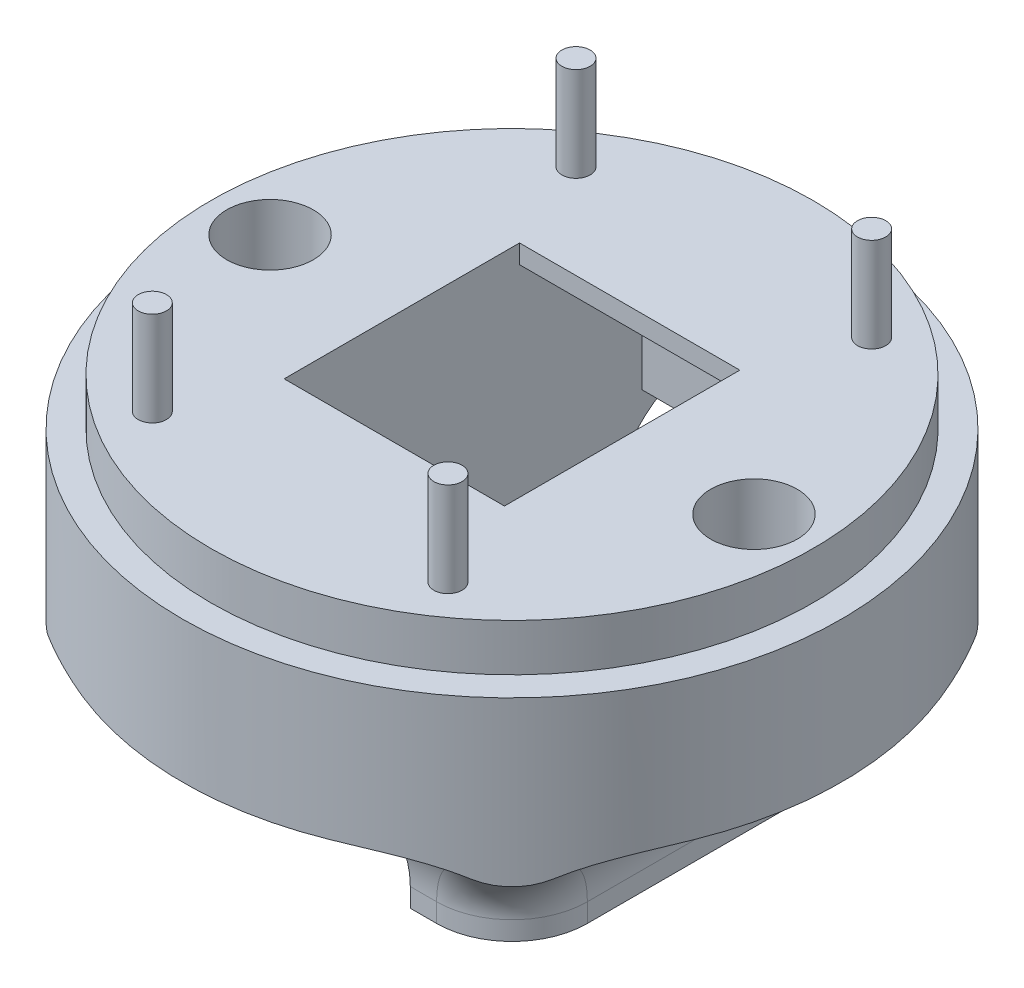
ISO-10303-21;
HEADER;
FILE_DESCRIPTION(('STEP AP214'),'2;1');
FILE_NAME('part.step','',(''),(''),'','','');
FILE_SCHEMA(('AUTOMOTIVE_DESIGN { 1 0 10303 214 1 1 1 1 }'));
ENDSEC;
DATA;
#1=APPLICATION_CONTEXT('core data for automotive mechanical design processes');
#2=APPLICATION_PROTOCOL_DEFINITION('international standard','automotive_design',2000,#1);
#3=PRODUCT_CONTEXT('',#1,'mechanical');
#4=PRODUCT('Part','Part','',(#3));
#5=PRODUCT_RELATED_PRODUCT_CATEGORY('part','',(#4));
#6=PRODUCT_DEFINITION_FORMATION('','',#4);
#7=PRODUCT_DEFINITION_CONTEXT('part definition',#1,'design');
#8=PRODUCT_DEFINITION('design','',#6,#7);
#9=PRODUCT_DEFINITION_SHAPE('','',#8);
#10=(LENGTH_UNIT() NAMED_UNIT(*) SI_UNIT(.MILLI.,.METRE.));
#11=(NAMED_UNIT(*) PLANE_ANGLE_UNIT() SI_UNIT($,.RADIAN.));
#12=(NAMED_UNIT(*) SI_UNIT($,.STERADIAN.) SOLID_ANGLE_UNIT());
#13=UNCERTAINTY_MEASURE_WITH_UNIT(LENGTH_MEASURE(1.E-05),#10,'distance_accuracy_value','');
#14=(GEOMETRIC_REPRESENTATION_CONTEXT(3) GLOBAL_UNCERTAINTY_ASSIGNED_CONTEXT((#13)) GLOBAL_UNIT_ASSIGNED_CONTEXT((#10,
#11,#12)) REPRESENTATION_CONTEXT('',''));
#15=CARTESIAN_POINT('',(0.,0.,0.));
#16=DIRECTION('',(0.,0.,1.));
#17=DIRECTION('',(1.,0.,0.));
#18=AXIS2_PLACEMENT_3D('',#15,#16,#17);
#19=CARTESIAN_POINT('',(-11.7,21.,12.5));
#20=DIRECTION('',(0.,0.,1.));
#21=DIRECTION('',(1.,0.,0.));
#22=AXIS2_PLACEMENT_3D('',#19,#20,#21);
#23=PLANE('',#22);
#24=DIRECTION('',(1.,0.,0.));
#25=VECTOR('',#24,1.);
#26=CARTESIAN_POINT('',(-11.7,18.,12.5));
#27=LINE('',#26,#25);
#28=CARTESIAN_POINT('',(-11.7,18.,12.5));
#29=VERTEX_POINT('',#28);
#30=CARTESIAN_POINT('',(11.7,18.,12.5));
#31=VERTEX_POINT('',#30);
#32=EDGE_CURVE('E264',#29,#31,#27,.T.);
#33=ORIENTED_EDGE('',*,*,#32,.F.);
#34=DIRECTION('',(0.,-1.,0.));
#35=VECTOR('',#34,1.);
#36=CARTESIAN_POINT('',(-11.7,21.,12.5));
#37=LINE('',#36,#35);
#38=CARTESIAN_POINT('',(-11.7,20.,12.5));
#39=VERTEX_POINT('',#38);
#40=EDGE_CURVE('E315',#39,#29,#37,.T.);
#41=ORIENTED_EDGE('',*,*,#40,.F.);
#42=DIRECTION('',(1.,0.,0.));
#43=VECTOR('',#42,1.);
#44=CARTESIAN_POINT('',(0.,20.,12.5));
#45=LINE('',#44,#43);
#46=CARTESIAN_POINT('',(11.7,20.,12.5));
#47=VERTEX_POINT('',#46);
#48=EDGE_CURVE('E468',#39,#47,#45,.T.);
#49=ORIENTED_EDGE('',*,*,#48,.T.);
#50=DIRECTION('',(0.,-1.,0.));
#51=VECTOR('',#50,1.);
#52=CARTESIAN_POINT('',(11.7,21.,12.5));
#53=LINE('',#52,#51);
#54=EDGE_CURVE('E319',#47,#31,#53,.T.);
#55=ORIENTED_EDGE('',*,*,#54,.T.);
#56=EDGE_LOOP('',(#33,#41,#49,#55));
#57=FACE_BOUND('',#56,.T.);
#58=ADVANCED_FACE('F35',(#57),#23,.F.);
#59=CARTESIAN_POINT('',(-11.7,21.,-12.5));
#60=DIRECTION('',(0.,0.,-1.));
#61=DIRECTION('',(-1.,0.,0.));
#62=AXIS2_PLACEMENT_3D('',#59,#60,#61);
#63=PLANE('',#62);
#64=DIRECTION('',(-1.,0.,0.));
#65=VECTOR('',#64,1.);
#66=CARTESIAN_POINT('',(-11.7,18.,-12.5));
#67=LINE('',#66,#65);
#68=CARTESIAN_POINT('',(11.7,18.,-12.5));
#69=VERTEX_POINT('',#68);
#70=CARTESIAN_POINT('',(-11.7,18.,-12.5));
#71=VERTEX_POINT('',#70);
#72=EDGE_CURVE('E11',#69,#71,#67,.T.);
#73=ORIENTED_EDGE('',*,*,#72,.F.);
#74=DIRECTION('',(0.,-1.,0.));
#75=VECTOR('',#74,1.);
#76=CARTESIAN_POINT('',(11.7,21.,-12.5));
#77=LINE('',#76,#75);
#78=CARTESIAN_POINT('',(11.7,20.,-12.5));
#79=VERTEX_POINT('',#78);
#80=EDGE_CURVE('E322',#79,#69,#77,.T.);
#81=ORIENTED_EDGE('',*,*,#80,.F.);
#82=DIRECTION('',(-1.,0.,0.));
#83=VECTOR('',#82,1.);
#84=CARTESIAN_POINT('',(0.,20.,-12.5));
#85=LINE('',#84,#83);
#86=CARTESIAN_POINT('',(-11.7,20.,-12.5));
#87=VERTEX_POINT('',#86);
#88=EDGE_CURVE('E462',#79,#87,#85,.T.);
#89=ORIENTED_EDGE('',*,*,#88,.T.);
#90=DIRECTION('',(0.,-1.,0.));
#91=VECTOR('',#90,1.);
#92=CARTESIAN_POINT('',(-11.7,21.,-12.5));
#93=LINE('',#92,#91);
#94=EDGE_CURVE('E312',#87,#71,#93,.T.);
#95=ORIENTED_EDGE('',*,*,#94,.T.);
#96=EDGE_LOOP('',(#73,#81,#89,#95));
#97=FACE_BOUND('',#96,.T.);
#98=ADVANCED_FACE('F731',(#97),#63,.F.);
#99=CARTESIAN_POINT('',(0.,20.,0.));
#100=DIRECTION('',(0.,1.,0.));
#101=DIRECTION('',(0.,0.,1.));
#102=AXIS2_PLACEMENT_3D('',#99,#100,#101);
#103=PLANE('',#102);
#104=CARTESIAN_POINT('',(25.7,20.,0.));
#105=DIRECTION('',(0.,1.,0.));
#106=DIRECTION('',(0.,0.,1.));
#107=AXIS2_PLACEMENT_3D('',#104,#105,#106);
#108=CIRCLE('',#107,4.6);
#109=CARTESIAN_POINT('',(25.7,20.,4.6));
#110=VERTEX_POINT('',#109);
#111=EDGE_CURVE('E269',#110,#110,#108,.T.);
#112=ORIENTED_EDGE('',*,*,#111,.F.);
#113=EDGE_LOOP('',(#112));
#114=FACE_BOUND('',#113,.T.);
#115=CARTESIAN_POINT('',(-25.7,20.,0.));
#116=DIRECTION('',(0.,1.,0.));
#117=DIRECTION('',(0.,0.,1.));
#118=AXIS2_PLACEMENT_3D('',#115,#116,#117);
#119=CIRCLE('',#118,4.6);
#120=CARTESIAN_POINT('',(-25.7,20.,4.6));
#121=VERTEX_POINT('',#120);
#122=EDGE_CURVE('E273',#121,#121,#119,.T.);
#123=ORIENTED_EDGE('',*,*,#122,.F.);
#124=EDGE_LOOP('',(#123));
#125=FACE_BOUND('',#124,.T.);
#126=CARTESIAN_POINT('',(15.7,20.,22.5));
#127=DIRECTION('',(0.,1.,0.));
#128=DIRECTION('',(0.,0.,1.));
#129=AXIS2_PLACEMENT_3D('',#126,#127,#128);
#130=CIRCLE('',#129,1.5);
#131=CARTESIAN_POINT('',(15.7,20.,24.));
#132=VERTEX_POINT('',#131);
#133=EDGE_CURVE('E290',#132,#132,#130,.T.);
#134=ORIENTED_EDGE('',*,*,#133,.F.);
#135=EDGE_LOOP('',(#134));
#136=FACE_BOUND('',#135,.T.);
#137=CARTESIAN_POINT('',(-15.7,20.,22.5));
#138=DIRECTION('',(0.,1.,0.));
#139=DIRECTION('',(0.,0.,1.));
#140=AXIS2_PLACEMENT_3D('',#137,#138,#139);
#141=CIRCLE('',#140,1.5);
#142=CARTESIAN_POINT('',(-15.7,20.,24.));
#143=VERTEX_POINT('',#142);
#144=EDGE_CURVE('E300',#143,#143,#141,.T.);
#145=ORIENTED_EDGE('',*,*,#144,.F.);
#146=EDGE_LOOP('',(#145));
#147=FACE_BOUND('',#146,.T.);
#148=DIRECTION('',(0.,0.,1.));
#149=VECTOR('',#148,1.);
#150=CARTESIAN_POINT('',(-11.7,20.,0.));
#151=LINE('',#150,#149);
#152=EDGE_CURVE('E43',#87,#39,#151,.T.);
#153=ORIENTED_EDGE('',*,*,#152,.F.);
#154=ORIENTED_EDGE('',*,*,#88,.F.);
#155=DIRECTION('',(0.,0.,-1.));
#156=VECTOR('',#155,1.);
#157=CARTESIAN_POINT('',(11.7,20.,0.));
#158=LINE('',#157,#156);
#159=EDGE_CURVE('E464',#47,#79,#158,.T.);
#160=ORIENTED_EDGE('',*,*,#159,.F.);
#161=ORIENTED_EDGE('',*,*,#48,.F.);
#162=EDGE_LOOP('',(#153,#154,#160,#161));
#163=FACE_BOUND('',#162,.T.);
#164=CARTESIAN_POINT('',(-15.7,20.,-22.5));
#165=DIRECTION('',(0.,1.,0.));
#166=DIRECTION('',(0.,0.,1.));
#167=AXIS2_PLACEMENT_3D('',#164,#165,#166);
#168=CIRCLE('',#167,1.5);
#169=CARTESIAN_POINT('',(-15.7,20.,-21.));
#170=VERTEX_POINT('',#169);
#171=EDGE_CURVE('E306',#170,#170,#168,.T.);
#172=ORIENTED_EDGE('',*,*,#171,.F.);
#173=EDGE_LOOP('',(#172));
#174=FACE_BOUND('',#173,.T.);
#175=CARTESIAN_POINT('',(15.7,20.,-22.5));
#176=DIRECTION('',(0.,1.,0.));
#177=DIRECTION('',(0.,0.,1.));
#178=AXIS2_PLACEMENT_3D('',#175,#176,#177);
#179=CIRCLE('',#178,1.5);
#180=CARTESIAN_POINT('',(15.7,20.,-21.));
#181=VERTEX_POINT('',#180);
#182=EDGE_CURVE('E294',#181,#181,#179,.T.);
#183=ORIENTED_EDGE('',*,*,#182,.F.);
#184=EDGE_LOOP('',(#183));
#185=FACE_BOUND('',#184,.T.);
#186=CARTESIAN_POINT('',(0.,20.,0.));
#187=DIRECTION('',(0.,1.,0.));
#188=DIRECTION('',(0.,0.,1.));
#189=AXIS2_PLACEMENT_3D('',#186,#187,#188);
#190=CIRCLE('',#189,32.);
#191=CARTESIAN_POINT('',(0.,20.,32.));
#192=VERTEX_POINT('',#191);
#193=EDGE_CURVE('E279',#192,#192,#190,.T.);
#194=ORIENTED_EDGE('',*,*,#193,.T.);
#195=EDGE_LOOP('',(#194));
#196=FACE_BOUND('',#195,.T.);
#197=ADVANCED_FACE('F477',(#114,#125,#136,#147,#163,#174,#185,#196),#103,.T.);
#198=CARTESIAN_POINT('',(0.,20.,0.));
#199=DIRECTION('',(0.,-1.,0.));
#200=DIRECTION('',(0.,0.,-1.));
#201=AXIS2_PLACEMENT_3D('',#198,#199,#200);
#202=CYLINDRICAL_SURFACE('',#201,35.);
#203=CARTESIAN_POINT('',(12.9903810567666,0.,32.5));
#204=CARTESIAN_POINT('',(13.3456293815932,-2.39894717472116E-05,32.3580134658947));
#205=CARTESIAN_POINT('',(13.698575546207,-0.00302578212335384,32.2101768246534));
#206=CARTESIAN_POINT('',(14.3994204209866,-0.0166441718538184,31.90302479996));
#207=CARTESIAN_POINT('',(14.7473174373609,-0.027263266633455,31.7437056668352));
#208=CARTESIAN_POINT('',(15.4395875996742,-0.0578749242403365,31.4128519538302));
#209=CARTESIAN_POINT('',(15.7839241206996,-0.0779268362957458,31.2412459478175));
#210=CARTESIAN_POINT('',(16.4660754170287,-0.129299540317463,30.8871495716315));
#211=CARTESIAN_POINT('',(16.8038908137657,-0.160619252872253,30.7046602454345));
#212=CARTESIAN_POINT('',(17.4816762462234,-0.237629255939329,30.3240215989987));
#213=CARTESIAN_POINT('',(17.8214371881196,-0.283700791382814,30.1255754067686));
#214=CARTESIAN_POINT('',(18.4922339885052,-0.392304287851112,29.7185327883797));
#215=CARTESIAN_POINT('',(18.8232687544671,-0.454838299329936,29.5099351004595));
#216=CARTESIAN_POINT('',(19.474374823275,-0.598741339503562,29.0843521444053));
#217=CARTESIAN_POINT('',(19.7944746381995,-0.680056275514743,28.8673924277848));
#218=CARTESIAN_POINT('',(20.4230797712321,-0.864313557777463,28.426135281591));
#219=CARTESIAN_POINT('',(20.7315893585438,-0.967247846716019,28.2018406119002));
#220=CARTESIAN_POINT('',(21.3110143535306,-1.18831488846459,27.7661894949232));
#221=CARTESIAN_POINT('',(21.582956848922,-1.30455706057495,27.5552450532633));
#222=CARTESIAN_POINT('',(22.1140573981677,-1.55999041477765,27.1308678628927));
#223=CARTESIAN_POINT('',(22.3732116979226,-1.69918828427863,26.9174344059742));
#224=CARTESIAN_POINT('',(22.8742660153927,-2.00111598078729,26.4929182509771));
#225=CARTESIAN_POINT('',(23.1163104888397,-2.16360128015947,26.2818330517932));
#226=CARTESIAN_POINT('',(23.5836896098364,-2.51480658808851,25.8632529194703));
#227=CARTESIAN_POINT('',(23.8090368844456,-2.70350645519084,25.6557553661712));
#228=CARTESIAN_POINT('',(24.1522561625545,-3.02537577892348,25.3317833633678));
#229=CARTESIAN_POINT('',(24.2763011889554,-3.14957819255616,25.2128809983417));
#230=CARTESIAN_POINT('',(24.5177527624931,-3.40815093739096,24.9781570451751));
#231=CARTESIAN_POINT('',(24.6351353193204,-3.54255438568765,24.8623472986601));
#232=CARTESIAN_POINT('',(24.7487373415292,-3.68193643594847,24.7487373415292));
#233=B_SPLINE_CURVE_WITH_KNOTS('',3,(#203,#204,#205,#206,#207,#208,#209,#210,#211,#212,#213,
#214,#215,#216,#217,#218,#219,#220,#221,#222,#223,#224,#225,#226,#227,#228,#229,#230,#231,#232),
.UNSPECIFIED.,.F.,.F.,(4,2,2,2,2,2,2,2,2,2,2,2,2,2,4),(0.,1.14770437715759,2.29578525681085,
3.45118825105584,4.6064805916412,5.79443480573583,6.98253705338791,8.1672590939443,
9.35154038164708,10.4404846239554,11.5297466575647,12.6083112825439,13.6860517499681,
14.3217658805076,14.9596402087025),.UNSPECIFIED.);
#234=CARTESIAN_POINT('',(12.9903810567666,0.,32.5));
#235=VERTEX_POINT('',#234);
#236=CARTESIAN_POINT('',(22.4030483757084,-1.7214473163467,26.8905824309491));
#237=VERTEX_POINT('',#236);
#238=EDGE_CURVE('E504',#235,#237,#233,.T.);
#239=ORIENTED_EDGE('',*,*,#238,.T.);
#240=CARTESIAN_POINT('',(32.5,-20.,32.5));
#241=CARTESIAN_POINT('',(32.5,-20.,32.5));
#242=CARTESIAN_POINT('',(32.5,-20.,32.5));
#243=CARTESIAN_POINT('',(32.2821542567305,-19.9999887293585,32.1078776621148));
#244=CARTESIAN_POINT('',(32.1950130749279,-20.0000639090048,32.1950130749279));
#245=CARTESIAN_POINT('',(32.1078776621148,-19.9999887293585,32.2821542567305));
#246=CARTESIAN_POINT('',(32.0643075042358,-19.9928809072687,31.7157535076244));
#247=CARTESIAN_POINT('',(31.8898129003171,-19.987183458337,31.8898129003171));
#248=CARTESIAN_POINT('',(31.7157535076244,-19.9928809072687,32.0643075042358));
#249=CARTESIAN_POINT('',(31.6290635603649,-19.9643914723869,30.9323144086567));
#250=CARTESIAN_POINT('',(31.2815910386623,-19.9359068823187,31.2815910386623));
#251=CARTESIAN_POINT('',(30.9323144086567,-19.9643914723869,31.6290635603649));
#252=CARTESIAN_POINT('',(31.4116664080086,-19.9430086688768,30.5409995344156));
#253=CARTESIAN_POINT('',(30.9781389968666,-19.89743564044,30.9781389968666));
#254=CARTESIAN_POINT('',(30.5409995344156,-19.9430086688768,31.4116664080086));
#255=CARTESIAN_POINT('',(30.979658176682,-19.8861319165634,29.7633847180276));
#256=CARTESIAN_POINT('',(30.3778142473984,-19.7954612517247,30.3778142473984));
#257=CARTESIAN_POINT('',(29.7633847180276,-19.8861319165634,30.979658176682));
#258=CARTESIAN_POINT('',(30.7650391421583,-19.8507597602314,29.3770704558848));
#259=CARTESIAN_POINT('',(30.0804898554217,-19.7320299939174,30.0804898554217));
#260=CARTESIAN_POINT('',(29.3770704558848,-19.8507597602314,30.7650391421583));
#261=CARTESIAN_POINT('',(30.337240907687,-19.7657582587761,28.6070336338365));
#262=CARTESIAN_POINT('',(29.4916317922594,-19.5803783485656,29.4916317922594));
#263=CARTESIAN_POINT('',(28.6070336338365,-19.7657582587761,30.337240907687));
#264=CARTESIAN_POINT('',(30.1240616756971,-19.7161292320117,28.2233110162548));
#265=CARTESIAN_POINT('',(29.1997092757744,-19.491946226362,29.1997092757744));
#266=CARTESIAN_POINT('',(28.2233110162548,-19.7161292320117,30.1240616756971));
#267=CARTESIAN_POINT('',(29.4945369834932,-19.5474539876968,27.0901665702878));
#268=CARTESIAN_POINT('',(28.3428127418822,-19.192266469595,28.3428127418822));
#269=CARTESIAN_POINT('',(27.0901665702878,-19.5474539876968,29.4945369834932));
#270=CARTESIAN_POINT('',(29.0808475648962,-19.4076605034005,26.3455256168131));
#271=CARTESIAN_POINT('',(27.7890073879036,-18.9448326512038,27.7890073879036));
#272=CARTESIAN_POINT('',(26.3455256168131,-19.4076605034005,29.0808475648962));
#273=CARTESIAN_POINT('',(28.2755267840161,-19.0740900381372,24.895948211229));
#274=CARTESIAN_POINT('',(26.7420925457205,-18.3672495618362,26.7420925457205));
#275=CARTESIAN_POINT('',(24.895948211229,-19.0740900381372,28.2755267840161));
#276=CARTESIAN_POINT('',(27.8836030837,-18.8817277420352,24.1904855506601));
#277=CARTESIAN_POINT('',(26.2456757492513,-18.0362354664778,26.2456757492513));
#278=CARTESIAN_POINT('',(24.1904855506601,-18.8817277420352,27.8836030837));
#279=CARTESIAN_POINT('',(27.1286070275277,-18.4458298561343,22.8314926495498));
#280=CARTESIAN_POINT('',(25.3306838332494,-17.3087067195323,25.3306838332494));
#281=CARTESIAN_POINT('',(22.8314926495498,-18.4458298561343,27.1286070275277));
#282=CARTESIAN_POINT('',(26.7650134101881,-18.2041180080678,22.1770241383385));
#283=CARTESIAN_POINT('',(24.9089987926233,-16.9110794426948,24.9089987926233));
#284=CARTESIAN_POINT('',(22.1770241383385,-18.2041180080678,26.7650134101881));
#285=CARTESIAN_POINT('',(26.0731555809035,-17.6732292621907,20.9316800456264));
#286=CARTESIAN_POINT('',(24.1581664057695,-16.074354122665,24.1581664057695));
#287=CARTESIAN_POINT('',(20.9316800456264,-17.6732292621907,26.0731555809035));
#288=CARTESIAN_POINT('',(25.7440739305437,-17.386204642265,20.3393330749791));
#289=CARTESIAN_POINT('',(23.8262217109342,-15.6339807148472,23.8262217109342));
#290=CARTESIAN_POINT('',(20.3393330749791,-17.386204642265,25.7440739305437));
#291=CARTESIAN_POINT('',(25.1272161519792,-16.7693564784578,19.2289890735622));
#292=CARTESIAN_POINT('',(23.2644689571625,-14.7433594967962,23.2644689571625));
#293=CARTESIAN_POINT('',(19.2289890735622,-16.7693564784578,25.1272161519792));
#294=CARTESIAN_POINT('',(24.8382775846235,-16.441877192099,18.7088996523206));
#295=CARTESIAN_POINT('',(23.0323080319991,-14.2918328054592,23.0323080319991));
#296=CARTESIAN_POINT('',(18.7088996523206,-16.441877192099,24.8382775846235));
#297=CARTESIAN_POINT('',(24.306872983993,-15.7492748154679,17.752371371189));
#298=CARTESIAN_POINT('',(22.6711714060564,-13.4171226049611,22.6711714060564));
#299=CARTESIAN_POINT('',(17.752371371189,-15.7492748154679,24.306872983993));
#300=CARTESIAN_POINT('',(24.0629018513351,-15.3865053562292,17.3132233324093));
#301=CARTESIAN_POINT('',(22.5403805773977,-12.9928690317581,22.5403805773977));
#302=CARTESIAN_POINT('',(17.3132233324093,-15.3865053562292,24.0629018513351));
#303=CARTESIAN_POINT('',(23.7329921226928,-14.8151026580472,16.7193858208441));
#304=CARTESIAN_POINT('',(22.4118825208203,-12.4077313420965,22.4118825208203));
#305=CARTESIAN_POINT('',(16.7193858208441,-14.8151026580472,23.7329921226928));
#306=CARTESIAN_POINT('',(23.6310018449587,-14.6247733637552,16.5358033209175));
#307=CARTESIAN_POINT('',(22.3803374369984,-12.2230446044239,22.3803374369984));
#308=CARTESIAN_POINT('',(16.5358033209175,-14.6247733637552,23.6310018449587));
#309=CARTESIAN_POINT('',(23.4377447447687,-14.2335645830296,16.1879405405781));
#310=CARTESIAN_POINT('',(22.3354723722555,-11.8705286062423,22.3354723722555));
#311=CARTESIAN_POINT('',(16.1879405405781,-14.2335645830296,23.4377447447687));
#312=CARTESIAN_POINT('',(23.3464731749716,-14.0326898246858,16.0236517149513));
#313=CARTESIAN_POINT('',(22.3224301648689,-11.7030829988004,22.3224301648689));
#314=CARTESIAN_POINT('',(16.0236517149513,-14.0326898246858,23.3464731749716));
#315=CARTESIAN_POINT('',(23.1792446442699,-13.6289661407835,15.7226403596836));
#316=CARTESIAN_POINT('',(22.3118613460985,-11.3959408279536,22.3118613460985));
#317=CARTESIAN_POINT('',(15.7226403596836,-13.6289661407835,23.1792446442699));
#318=CARTESIAN_POINT('',(23.1028308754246,-13.4264962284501,15.5850955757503));
#319=CARTESIAN_POINT('',(22.3139491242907,-11.2557958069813,22.3139491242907));
#320=CARTESIAN_POINT('',(15.5850955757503,-13.4264962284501,23.1028308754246));
#321=CARTESIAN_POINT('',(22.9622986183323,-13.0132769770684,15.3321375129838));
#322=CARTESIAN_POINT('',(22.3283104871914,-10.9985065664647,22.3283104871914));
#323=CARTESIAN_POINT('',(15.3321375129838,-13.0132769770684,22.9622986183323));
#324=CARTESIAN_POINT('',(22.8981741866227,-12.8025316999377,15.2167135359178));
#325=CARTESIAN_POINT('',(22.3406916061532,-10.8818401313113,22.3406916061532));
#326=CARTESIAN_POINT('',(15.2167135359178,-12.8025316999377,22.8981741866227));
#327=CARTESIAN_POINT('',(22.7850126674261,-12.3802063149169,15.0130228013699));
#328=CARTESIAN_POINT('',(22.3702188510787,-10.6754571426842,22.3702188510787));
#329=CARTESIAN_POINT('',(15.0130228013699,-12.3802063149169,22.7850126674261));
#330=CARTESIAN_POINT('',(22.7355845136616,-12.1688363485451,14.9240521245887));
#331=CARTESIAN_POINT('',(22.3872388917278,-10.5854489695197,22.3872388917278));
#332=CARTESIAN_POINT('',(14.9240521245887,-12.1688363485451,22.7355845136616));
#333=CARTESIAN_POINT('',(22.6502473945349,-11.7406917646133,14.7704453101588));
#334=CARTESIAN_POINT('',(22.421215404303,-10.4260364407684,22.421215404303));
#335=CARTESIAN_POINT('',(14.7704453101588,-11.7406917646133,22.6502473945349));
#336=CARTESIAN_POINT('',(22.6143378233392,-11.5239173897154,14.7058080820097));
#337=CARTESIAN_POINT('',(22.4381310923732,-10.3569874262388,22.4381310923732));
#338=CARTESIAN_POINT('',(14.7058080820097,-11.5239173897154,22.6143378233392));
#339=CARTESIAN_POINT('',(22.5572344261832,-11.0901724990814,14.6030219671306));
#340=CARTESIAN_POINT('',(22.4670802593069,-10.235745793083,22.4670802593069));
#341=CARTESIAN_POINT('',(14.6030219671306,-11.0901724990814,22.5572344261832));
#342=CARTESIAN_POINT('',(22.5358101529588,-10.8732628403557,14.5644582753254));
#343=CARTESIAN_POINT('',(22.4791271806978,-10.1835354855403,22.4791271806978));
#344=CARTESIAN_POINT('',(14.5644582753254,-10.8732628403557,22.5358101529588));
#345=CARTESIAN_POINT('',(22.5071930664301,-10.4375687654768,14.5129475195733));
#346=CARTESIAN_POINT('',(22.4956094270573,-10.0874652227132,22.4956094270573));
#347=CARTESIAN_POINT('',(14.5129475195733,-10.4375687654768,22.5071930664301));
#348=CARTESIAN_POINT('',(22.5,-10.2187843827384,14.5));
#349=CARTESIAN_POINT('',(22.5,-10.043764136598,22.5));
#350=CARTESIAN_POINT('',(14.5,-10.2187843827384,22.5));
#351=CARTESIAN_POINT('',(22.5,-9.78121561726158,14.5));
#352=CARTESIAN_POINT('',(22.5,-9.95623586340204,22.5));
#353=CARTESIAN_POINT('',(14.5,-9.78121561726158,22.5));
#354=CARTESIAN_POINT('',(22.5071930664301,-9.56243123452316,14.5129475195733));
#355=CARTESIAN_POINT('',(22.4956094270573,-9.91253477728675,22.4956094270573));
#356=CARTESIAN_POINT('',(14.5129475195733,-9.56243123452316,22.5071930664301));
#357=CARTESIAN_POINT('',(22.5358101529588,-9.12673715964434,14.5644582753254));
#358=CARTESIAN_POINT('',(22.4791271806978,-9.81646451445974,22.4791271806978));
#359=CARTESIAN_POINT('',(14.5644582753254,-9.12673715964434,22.5358101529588));
#360=CARTESIAN_POINT('',(22.5572344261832,-8.90982750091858,14.6030219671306));
#361=CARTESIAN_POINT('',(22.4670802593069,-9.76425420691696,22.4670802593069));
#362=CARTESIAN_POINT('',(14.6030219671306,-8.90982750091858,22.5572344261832));
#363=CARTESIAN_POINT('',(22.6143378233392,-8.47608261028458,14.7058080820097));
#364=CARTESIAN_POINT('',(22.4381310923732,-9.64301257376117,22.4381310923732));
#365=CARTESIAN_POINT('',(14.7058080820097,-8.47608261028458,22.6143378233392));
#366=CARTESIAN_POINT('',(22.6502473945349,-8.25930823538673,14.7704453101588));
#367=CARTESIAN_POINT('',(22.421215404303,-9.57396355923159,22.421215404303));
#368=CARTESIAN_POINT('',(14.7704453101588,-8.25930823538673,22.6502473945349));
#369=CARTESIAN_POINT('',(22.7355845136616,-7.8311636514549,14.9240521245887));
#370=CARTESIAN_POINT('',(22.3872388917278,-9.41455103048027,22.3872388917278));
#371=CARTESIAN_POINT('',(14.9240521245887,-7.8311636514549,22.7355845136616));
#372=CARTESIAN_POINT('',(22.7850126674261,-7.61979368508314,15.0130228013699));
#373=CARTESIAN_POINT('',(22.3702188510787,-9.32454285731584,22.3702188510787));
#374=CARTESIAN_POINT('',(15.0130228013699,-7.61979368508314,22.7850126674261));
#375=CARTESIAN_POINT('',(22.8981741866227,-7.19746830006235,15.2167135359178));
#376=CARTESIAN_POINT('',(22.3406916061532,-9.11815986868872,22.3406916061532));
#377=CARTESIAN_POINT('',(15.2167135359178,-7.19746830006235,22.8981741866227));
#378=CARTESIAN_POINT('',(22.9622986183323,-6.98672302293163,15.3321375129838));
#379=CARTESIAN_POINT('',(22.3283104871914,-9.00149343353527,22.3283104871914));
#380=CARTESIAN_POINT('',(15.3321375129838,-6.98672302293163,22.9622986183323));
#381=CARTESIAN_POINT('',(23.1028308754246,-6.57350377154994,15.5850955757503));
#382=CARTESIAN_POINT('',(22.3139491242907,-8.74420419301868,22.3139491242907));
#383=CARTESIAN_POINT('',(15.5850955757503,-6.57350377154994,23.1028308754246));
#384=CARTESIAN_POINT('',(23.1792446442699,-6.37103385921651,15.7226403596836));
#385=CARTESIAN_POINT('',(22.3118613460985,-8.60405917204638,22.3118613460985));
#386=CARTESIAN_POINT('',(15.7226403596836,-6.37103385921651,23.1792446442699));
#387=CARTESIAN_POINT('',(23.3464731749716,-5.96731017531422,16.0236517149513));
#388=CARTESIAN_POINT('',(22.3224301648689,-8.29691700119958,22.3224301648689));
#389=CARTESIAN_POINT('',(16.0236517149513,-5.96731017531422,23.3464731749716));
#390=CARTESIAN_POINT('',(23.4377447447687,-5.76643541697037,16.1879405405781));
#391=CARTESIAN_POINT('',(22.3354723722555,-8.12947139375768,22.3354723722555));
#392=CARTESIAN_POINT('',(16.1879405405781,-5.76643541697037,23.4377447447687));
#393=CARTESIAN_POINT('',(23.6310018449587,-5.37522663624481,16.5358033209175));
#394=CARTESIAN_POINT('',(22.3803374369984,-7.7769553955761,22.3803374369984));
#395=CARTESIAN_POINT('',(16.5358033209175,-5.37522663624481,23.6310018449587));
#396=CARTESIAN_POINT('',(23.7329921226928,-5.18489734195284,16.7193858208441));
#397=CARTESIAN_POINT('',(22.4118825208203,-7.59226865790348,22.4118825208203));
#398=CARTESIAN_POINT('',(16.7193858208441,-5.18489734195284,23.7329921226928));
#399=CARTESIAN_POINT('',(24.0629018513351,-4.61349464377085,17.3132233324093));
#400=CARTESIAN_POINT('',(22.5403805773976,-7.00713096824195,22.5403805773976));
#401=CARTESIAN_POINT('',(17.3132233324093,-4.61349464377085,24.0629018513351));
#402=CARTESIAN_POINT('',(24.306872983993,-4.25072518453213,17.752371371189));
#403=CARTESIAN_POINT('',(22.6711714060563,-6.58287739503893,22.6711714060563));
#404=CARTESIAN_POINT('',(17.752371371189,-4.25072518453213,24.306872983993));
#405=CARTESIAN_POINT('',(24.8382775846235,-3.558122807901,18.7088996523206));
#406=CARTESIAN_POINT('',(23.0323080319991,-5.70816719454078,23.0323080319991));
#407=CARTESIAN_POINT('',(18.7088996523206,-3.558122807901,24.8382775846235));
#408=CARTESIAN_POINT('',(25.1272161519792,-3.2306435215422,19.2289890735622));
#409=CARTESIAN_POINT('',(23.2644689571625,-5.25664050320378,23.2644689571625));
#410=CARTESIAN_POINT('',(19.2289890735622,-3.2306435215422,25.1272161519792));
#411=CARTESIAN_POINT('',(25.7440739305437,-2.613795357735,20.3393330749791));
#412=CARTESIAN_POINT('',(23.8262217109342,-4.36601928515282,23.8262217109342));
#413=CARTESIAN_POINT('',(20.3393330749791,-2.613795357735,25.7440739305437));
#414=CARTESIAN_POINT('',(26.0731555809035,-2.32677073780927,20.9316800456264));
#415=CARTESIAN_POINT('',(24.1581664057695,-3.92564587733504,24.1581664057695));
#416=CARTESIAN_POINT('',(20.9316800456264,-2.32677073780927,26.0731555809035));
#417=CARTESIAN_POINT('',(26.7650134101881,-1.79588199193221,22.1770241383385));
#418=CARTESIAN_POINT('',(24.9089987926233,-3.0889205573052,24.9089987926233));
#419=CARTESIAN_POINT('',(22.1770241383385,-1.79588199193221,26.7650134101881));
#420=CARTESIAN_POINT('',(27.1286070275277,-1.55417014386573,22.8314926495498));
#421=CARTESIAN_POINT('',(25.3306838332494,-2.6912932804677,25.3306838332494));
#422=CARTESIAN_POINT('',(22.8314926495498,-1.55417014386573,27.1286070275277));
#423=CARTESIAN_POINT('',(27.8836030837,-1.11827225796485,24.1904855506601));
#424=CARTESIAN_POINT('',(26.2456757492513,-1.96376453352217,26.2456757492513));
#425=CARTESIAN_POINT('',(24.1904855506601,-1.11827225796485,27.8836030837));
#426=CARTESIAN_POINT('',(28.2755267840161,-0.925909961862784,24.895948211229));
#427=CARTESIAN_POINT('',(26.7420925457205,-1.6327504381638,26.7420925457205));
#428=CARTESIAN_POINT('',(24.895948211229,-0.925909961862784,28.2755267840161));
#429=CARTESIAN_POINT('',(29.0808475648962,-0.59233949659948,26.3455256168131));
#430=CARTESIAN_POINT('',(27.7890073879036,-1.05516734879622,27.7890073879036));
#431=CARTESIAN_POINT('',(26.3455256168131,-0.59233949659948,29.0808475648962));
#432=CARTESIAN_POINT('',(29.4945369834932,-0.452546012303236,27.0901665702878));
#433=CARTESIAN_POINT('',(28.3428127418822,-0.807733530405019,28.3428127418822));
#434=CARTESIAN_POINT('',(27.0901665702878,-0.452546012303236,29.4945369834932));
#435=CARTESIAN_POINT('',(30.1240616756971,-0.283870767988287,28.2233110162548));
#436=CARTESIAN_POINT('',(29.1997092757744,-0.508053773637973,29.1997092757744));
#437=CARTESIAN_POINT('',(28.2233110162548,-0.283870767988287,30.1240616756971));
#438=CARTESIAN_POINT('',(30.337240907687,-0.234241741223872,28.6070336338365));
#439=CARTESIAN_POINT('',(29.4916317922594,-0.419621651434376,29.4916317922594));
#440=CARTESIAN_POINT('',(28.6070336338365,-0.234241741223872,30.337240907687));
#441=CARTESIAN_POINT('',(30.7650391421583,-0.149240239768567,29.3770704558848));
#442=CARTESIAN_POINT('',(30.0804898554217,-0.267970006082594,30.0804898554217));
#443=CARTESIAN_POINT('',(29.3770704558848,-0.149240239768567,30.7650391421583));
#444=CARTESIAN_POINT('',(30.979658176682,-0.113868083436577,29.7633847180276));
#445=CARTESIAN_POINT('',(30.3778142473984,-0.204538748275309,30.3778142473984));
#446=CARTESIAN_POINT('',(29.7633847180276,-0.113868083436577,30.979658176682));
#447=CARTESIAN_POINT('',(31.4116664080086,-0.0569913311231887,30.5409995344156));
#448=CARTESIAN_POINT('',(30.9781389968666,-0.102564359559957,30.9781389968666));
#449=CARTESIAN_POINT('',(30.5409995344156,-0.0569913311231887,31.4116664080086));
#450=CARTESIAN_POINT('',(31.6290635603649,-0.0356085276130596,30.9323144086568));
#451=CARTESIAN_POINT('',(31.2815910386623,-0.0640931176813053,31.2815910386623));
#452=CARTESIAN_POINT('',(30.9323144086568,-0.0356085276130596,31.6290635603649));
#453=CARTESIAN_POINT('',(32.0643075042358,-0.00711909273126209,31.7157535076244));
#454=CARTESIAN_POINT('',(31.8898129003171,-0.0128165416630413,31.8898129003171));
#455=CARTESIAN_POINT('',(31.7157535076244,-0.00711909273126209,32.0643075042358));
#456=CARTESIAN_POINT('',(32.2821542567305,-1.12706415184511E-05,32.1078776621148));
#457=CARTESIAN_POINT('',(32.195013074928,6.39090047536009E-05,32.195013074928));
#458=CARTESIAN_POINT('',(32.1078776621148,-1.12706415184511E-05,32.2821542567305));
#459=CARTESIAN_POINT('',(32.5,0.,32.5));
#460=CARTESIAN_POINT('',(32.5,0.,32.5));
#461=CARTESIAN_POINT('',(32.5,0.,32.5));
#462=(BOUNDED_SURFACE() B_SPLINE_SURFACE(3,2,((#240,#241,#242),(#243,#244,#245),(#246,#247,
#248),(#249,#250,#251),(#252,#253,#254),(#255,#256,#257),(#258,#259,#260),(#261,#262,#263),
(#264,#265,#266),(#267,#268,#269),(#270,#271,#272),(#273,#274,#275),(#276,#277,#278),(#279,#280,
#281),(#282,#283,#284),(#285,#286,#287),(#288,#289,#290),(#291,#292,#293),(#294,#295,#296),
(#297,#298,#299),(#300,#301,#302),(#303,#304,#305),(#306,#307,#308),(#309,#310,#311),(#312,#313,
#314),(#315,#316,#317),(#318,#319,#320),(#321,#322,#323),(#324,#325,#326),(#327,#328,#329),
(#330,#331,#332),(#333,#334,#335),(#336,#337,#338),(#339,#340,#341),(#342,#343,#344),(#345,#346,
#347),(#348,#349,#350),(#351,#352,#353),(#354,#355,#356),(#357,#358,#359),(#360,#361,#362),
(#363,#364,#365),(#366,#367,#368),(#369,#370,#371),(#372,#373,#374),(#375,#376,#377),(#378,#379,
#380),(#381,#382,#383),(#384,#385,#386),(#387,#388,#389),(#390,#391,#392),(#393,#394,#395),
(#396,#397,#398),(#399,#400,#401),(#402,#403,#404),(#405,#406,#407),(#408,#409,#410),(#411,#412,
#413),(#414,#415,#416),(#417,#418,#419),(#420,#421,#422),(#423,#424,#425),(#426,#427,#428),
(#429,#430,#431),(#432,#433,#434),(#435,#436,#437),(#438,#439,#440),(#441,#442,#443),(#444,#445,
#446),(#447,#448,#449),(#450,#451,#452),(#453,#454,#455),(#456,#457,#458),(#459,#460,#461)),
.UNSPECIFIED.,.F.,.F.,.F.) B_SPLINE_SURFACE_WITH_KNOTS((4,2,2,2,2,2,2,2,2,2,2,2,2,2,2,2,2,2,2,2,
2,2,2,2,2,2,2,2,2,2,2,2,2,2,2,2,4),(3,3),(0.,1.6634885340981,3.3271158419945,4.97656751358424,
6.62598235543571,9.86861447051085,13.0313663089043,16.0934475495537,19.0391895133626,
21.8594366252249,24.5529191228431,25.8414336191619,27.1293752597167,28.3673439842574,
29.6047124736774,30.8053820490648,32.0059978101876,33.1870327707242,34.3680467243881,
35.5490606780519,36.7300956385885,37.9307113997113,39.1313809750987,40.3687494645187,
41.6067181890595,42.8946598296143,44.183174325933,46.8766568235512,49.6969039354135,
52.6426458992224,55.7047271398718,58.8674789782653,62.1101110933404,63.7595259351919,
65.4089776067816,67.0726049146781,68.7360934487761),(0.,1.),
.UNSPECIFIED.) GEOMETRIC_REPRESENTATION_ITEM() RATIONAL_B_SPLINE_SURFACE(((1.,1.,1.),(1.,
1.00000025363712,1.),(1.,0.99964406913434,1.),(1.,0.998220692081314,1.),(1.,0.997153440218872,
1.),(1.,0.994321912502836,1.),(1.,0.992563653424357,1.),(1.,0.988355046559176,1.),(1.,
0.985904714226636,1.),(1.,0.977617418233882,1.),(1.,0.970795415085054,1.),(1.,0.954789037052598,
1.),(1.,0.945666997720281,1.),(1.,0.92548803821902,1.),(1.,0.914501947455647,1.),(1.,
0.891169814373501,1.),(1.,0.878891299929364,1.),(1.,0.853707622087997,1.),(1.,0.840851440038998,
1.),(1.,0.815385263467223,1.),(1.,0.802790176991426,1.),(1.,0.784723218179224,1.),(1.,
0.778962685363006,1.),(1.,0.767759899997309,1.),(1.,0.762317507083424,1.),(1.,0.752114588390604,
1.),(1.,0.747335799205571,1.),(1.,0.738380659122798,1.),(1.,0.73420401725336,1.),(1.,
0.72672160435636,1.),(1.,0.72339367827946,1.),(1.,0.717585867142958,1.),(1.,0.715105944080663,
1.),(1.,0.711136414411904,1.),(1.,0.70963131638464,1.),(1.,0.707616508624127,1.),(1.,
0.707106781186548,1.),(1.,0.707106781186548,1.),(1.,0.707616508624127,1.),(1.,0.70963131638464,
1.),(1.,0.711136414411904,1.),(1.,0.715105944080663,1.),(1.,0.717585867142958,1.),(1.,
0.72339367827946,1.),(1.,0.72672160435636,1.),(1.,0.73420401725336,1.),(1.,0.738380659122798,
1.),(1.,0.747335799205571,1.),(1.,0.752114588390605,1.),(1.,0.762317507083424,1.),(1.,
0.767759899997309,1.),(1.,0.778962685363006,1.),(1.,0.784723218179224,1.),(1.,0.802790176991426,
1.),(1.,0.815385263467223,1.),(1.,0.840851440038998,1.),(1.,0.853707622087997,1.),(1.,
0.878891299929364,1.),(1.,0.891169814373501,1.),(1.,0.914501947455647,1.),(1.,0.925488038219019,
1.),(1.,0.945666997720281,1.),(1.,0.954789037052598,1.),(1.,0.970795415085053,1.),(1.,
0.977617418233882,1.),(1.,0.985904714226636,1.),(1.,0.988355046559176,1.),(1.,0.992563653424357,
1.),(1.,0.994321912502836,1.),(1.,0.997153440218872,1.),(1.,0.998220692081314,1.),(1.,
0.99964406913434,1.),(1.,1.00000025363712,1.),(1.,1.,1.))) REPRESENTATION_ITEM('') SURFACE());
#463=CARTESIAN_POINT('',(22.4030483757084,-1.7214473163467,26.8905824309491));
#464=CARTESIAN_POINT('',(22.5576788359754,-1.80873914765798,26.7617786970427));
#465=CARTESIAN_POINT('',(22.7139531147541,-1.8877035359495,26.6293036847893));
#466=CARTESIAN_POINT('',(23.0284805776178,-2.02852292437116,26.3577679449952));
#467=CARTESIAN_POINT('',(23.1867337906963,-2.09037767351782,26.2187071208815));
#468=CARTESIAN_POINT('',(23.5039103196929,-2.19652221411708,25.9347563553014));
#469=CARTESIAN_POINT('',(23.6628336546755,-2.24081150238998,25.7898662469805));
#470=CARTESIAN_POINT('',(23.9800663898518,-2.31156091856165,25.4951615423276));
#471=CARTESIAN_POINT('',(24.1383758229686,-2.33802201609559,25.3453472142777));
#472=CARTESIAN_POINT('',(24.4533172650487,-2.37290136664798,25.0416289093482));
#473=CARTESIAN_POINT('',(24.6099476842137,-2.38130380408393,24.8877214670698));
#474=CARTESIAN_POINT('',(24.9202409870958,-2.3800204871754,24.5770175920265));
#475=CARTESIAN_POINT('',(25.073903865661,-2.37033470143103,24.4202211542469));
#476=CARTESIAN_POINT('',(25.3770014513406,-2.33292852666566,24.1050934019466));
#477=CARTESIAN_POINT('',(25.5264412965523,-2.30523113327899,23.9467642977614));
#478=CARTESIAN_POINT('',(25.820275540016,-2.23205548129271,23.6296444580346));
#479=CARTESIAN_POINT('',(25.9646718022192,-2.18658386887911,23.4708539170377));
#480=CARTESIAN_POINT('',(26.2428968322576,-2.07990137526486,23.1592847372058));
#481=CARTESIAN_POINT('',(26.3769172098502,-2.0192617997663,23.006481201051));
#482=CARTESIAN_POINT('',(26.6386168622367,-1.88212652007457,22.7029614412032));
#483=CARTESIAN_POINT('',(26.7663042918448,-1.80565189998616,22.5522427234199));
#484=CARTESIAN_POINT('',(26.8905824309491,-1.72144731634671,22.4030483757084));
#485=B_SPLINE_CURVE_WITH_KNOTS('',3,(#463,#464,#465,#466,#467,#468,#469,#470,#471,#472,#473,
#474,#475,#476,#477,#478,#479,#480,#481,#482,#483,#484),.UNSPECIFIED.,.F.,.F.,(4,2,2,2,2,2,2,2,
2,2,4),(0.,0.657903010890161,1.31581567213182,1.9737471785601,2.63164289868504,3.29011456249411,
3.94858736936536,4.60622114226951,5.26360924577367,5.89921968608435,6.53398920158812),.UNSPECIFIED.);
#486=CARTESIAN_POINT('',(26.8905824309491,-1.7214473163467,22.4030483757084));
#487=VERTEX_POINT('',#486);
#488=EDGE_CURVE('E612',#237,#487,#485,.T.);
#489=ORIENTED_EDGE('',*,*,#488,.T.);
#490=CARTESIAN_POINT('',(24.7487373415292,-3.68193643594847,24.7487373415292));
#491=CARTESIAN_POINT('',(24.8443213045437,-3.56467043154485,24.6531564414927));
#492=CARTESIAN_POINT('',(24.9414655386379,-3.45092340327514,24.5549011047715));
#493=CARTESIAN_POINT('',(25.1383119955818,-3.23040693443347,24.3533383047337));
#494=CARTESIAN_POINT('',(25.2380134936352,-3.12363554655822,24.2500322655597));
#495=CARTESIAN_POINT('',(25.539732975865,-2.81407014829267,23.9333824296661));
#496=CARTESIAN_POINT('',(25.7448067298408,-2.62149106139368,23.7128685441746));
#497=CARTESIAN_POINT('',(26.1560389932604,-2.2651978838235,23.2584230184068));
#498=CARTESIAN_POINT('',(26.36213962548,-2.10110896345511,23.0247295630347));
#499=CARTESIAN_POINT('',(26.7753147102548,-1.79671694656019,22.5429228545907));
#500=CARTESIAN_POINT('',(26.9823897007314,-1.65642910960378,22.2948004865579));
#501=CARTESIAN_POINT('',(27.47542420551,-1.34735390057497,21.6865898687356));
#502=CARTESIAN_POINT('',(27.7605954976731,-1.18884535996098,21.3206307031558));
#503=CARTESIAN_POINT('',(28.3223462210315,-0.909029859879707,20.5685522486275));
#504=CARTESIAN_POINT('',(28.5989229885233,-0.787734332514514,20.1824268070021));
#505=CARTESIAN_POINT('',(29.142208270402,-0.576042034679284,19.3898081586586));
#506=CARTESIAN_POINT('',(29.4088053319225,-0.485933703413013,18.9831627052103));
#507=CARTESIAN_POINT('',(29.9268268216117,-0.332957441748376,18.1555335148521));
#508=CARTESIAN_POINT('',(30.1782535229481,-0.270085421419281,17.7345519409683));
#509=CARTESIAN_POINT('',(30.6194405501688,-0.176328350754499,16.959086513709));
#510=CARTESIAN_POINT('',(30.8120267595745,-0.141683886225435,16.6066439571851));
#511=CARTESIAN_POINT('',(31.1853310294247,-0.0849972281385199,15.8945502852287));
#512=CARTESIAN_POINT('',(31.3660492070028,-0.0629549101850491,15.5348992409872));
#513=CARTESIAN_POINT('',(31.7127320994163,-0.0295358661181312,14.8141926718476));
#514=CARTESIAN_POINT('',(31.8788655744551,-0.0180165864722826,14.4532245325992));
#515=CARTESIAN_POINT('',(32.1987677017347,-0.00326374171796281,13.7257909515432));
#516=CARTESIAN_POINT('',(32.352539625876,-2.79770579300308E-05,13.359326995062));
#517=CARTESIAN_POINT('',(32.5,0.,12.9903810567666));
#518=B_SPLINE_CURVE_WITH_KNOTS('',3,(#490,#491,#492,#493,#494,#495,#496,#497,#498,#499,#500,
#501,#502,#503,#504,#505,#506,#507,#508,#509,#510,#511,#512,#513,#514,#515,#516,#517),
.UNSPECIFIED.,.F.,.F.,(4,2,2,2,2,2,2,2,2,2,2,2,2,4),(0.,0.536713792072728,1.07327711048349,
2.14395623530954,3.1992585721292,4.25523495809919,5.72377030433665,7.19275634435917,
8.67498658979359,10.1569941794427,11.3659085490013,12.5748109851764,13.7670827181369,
14.9590378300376),.UNSPECIFIED.);
#519=CARTESIAN_POINT('',(32.5,0.,12.9903810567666));
#520=VERTEX_POINT('',#519);
#521=EDGE_CURVE('E669',#487,#520,#518,.T.);
#522=ORIENTED_EDGE('',*,*,#521,.T.);
#523=CARTESIAN_POINT('',(0.,0.,0.));
#524=DIRECTION('',(0.,1.,0.));
#525=DIRECTION('',(0.,0.,1.));
#526=AXIS2_PLACEMENT_3D('',#523,#524,#525);
#527=CIRCLE('',#526,35.);
#528=CARTESIAN_POINT('',(32.5,0.,-12.9903810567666));
#529=VERTEX_POINT('',#528);
#530=EDGE_CURVE('E393',#520,#529,#527,.T.);
#531=ORIENTED_EDGE('',*,*,#530,.T.);
#532=CARTESIAN_POINT('',(32.5,0.,-12.9903810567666));
#533=CARTESIAN_POINT('',(32.3580134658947,-2.39894717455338E-05,-13.3456293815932));
#534=CARTESIAN_POINT('',(32.2101768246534,-0.00302578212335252,-13.698575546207));
#535=CARTESIAN_POINT('',(31.90302479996,-0.0166441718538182,-14.3994204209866));
#536=CARTESIAN_POINT('',(31.7437056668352,-0.0272632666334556,-14.7473174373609));
#537=CARTESIAN_POINT('',(31.4128519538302,-0.0578749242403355,-15.4395875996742));
#538=CARTESIAN_POINT('',(31.2412459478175,-0.0779268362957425,-15.7839241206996));
#539=CARTESIAN_POINT('',(30.8871495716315,-0.129299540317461,-16.4660754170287));
#540=CARTESIAN_POINT('',(30.7046602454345,-0.160619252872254,-16.8038908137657));
#541=CARTESIAN_POINT('',(30.3240215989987,-0.237629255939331,-17.4816762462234));
#542=CARTESIAN_POINT('',(30.1255754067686,-0.283700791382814,-17.8214371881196));
#543=CARTESIAN_POINT('',(29.7185327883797,-0.392304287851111,-18.4922339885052));
#544=CARTESIAN_POINT('',(29.5099351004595,-0.454838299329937,-18.8232687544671));
#545=CARTESIAN_POINT('',(29.0843521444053,-0.598741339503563,-19.474374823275));
#546=CARTESIAN_POINT('',(28.8673924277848,-0.680056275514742,-19.7944746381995));
#547=CARTESIAN_POINT('',(28.426135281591,-0.864313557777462,-20.4230797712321));
#548=CARTESIAN_POINT('',(28.2018406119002,-0.967247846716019,-20.7315893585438));
#549=CARTESIAN_POINT('',(27.7661894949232,-1.18831488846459,-21.3110143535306));
#550=CARTESIAN_POINT('',(27.5552450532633,-1.30455706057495,-21.582956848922));
#551=CARTESIAN_POINT('',(27.1308678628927,-1.55999041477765,-22.1140573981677));
#552=CARTESIAN_POINT('',(26.9174344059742,-1.69918828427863,-22.3732116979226));
#553=CARTESIAN_POINT('',(26.4929182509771,-2.00111598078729,-22.8742660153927));
#554=CARTESIAN_POINT('',(26.2818330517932,-2.16360128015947,-23.1163104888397));
#555=CARTESIAN_POINT('',(25.8632529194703,-2.51480658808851,-23.5836896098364));
#556=CARTESIAN_POINT('',(25.6557553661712,-2.70350645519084,-23.8090368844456));
#557=CARTESIAN_POINT('',(25.3317833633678,-3.02537577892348,-24.1522561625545));
#558=CARTESIAN_POINT('',(25.2128809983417,-3.14957819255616,-24.2763011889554));
#559=CARTESIAN_POINT('',(24.9781570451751,-3.40815093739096,-24.5177527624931));
#560=CARTESIAN_POINT('',(24.8623472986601,-3.54255438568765,-24.6351353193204));
#561=CARTESIAN_POINT('',(24.7487373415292,-3.68193643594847,-24.7487373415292));
#562=B_SPLINE_CURVE_WITH_KNOTS('',3,(#532,#533,#534,#535,#536,#537,#538,#539,#540,#541,#542,
#543,#544,#545,#546,#547,#548,#549,#550,#551,#552,#553,#554,#555,#556,#557,#558,#559,#560,#561),
.UNSPECIFIED.,.F.,.F.,(4,2,2,2,2,2,2,2,2,2,2,2,2,2,4),(0.,1.14770437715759,2.29578525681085,
3.45118825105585,4.6064805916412,5.79443480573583,6.98253705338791,8.16725909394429,
9.35154038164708,10.4404846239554,11.5297466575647,12.6083112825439,13.6860517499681,
14.3217658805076,14.9596402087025),.UNSPECIFIED.);
#563=CARTESIAN_POINT('',(26.8905824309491,-1.7214473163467,-22.4030483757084));
#564=VERTEX_POINT('',#563);
#565=EDGE_CURVE('E674',#529,#564,#562,.T.);
#566=ORIENTED_EDGE('',*,*,#565,.T.);
#567=CARTESIAN_POINT('',(32.5,-20.,-32.5));
#568=CARTESIAN_POINT('',(32.5,-20.,-32.5));
#569=CARTESIAN_POINT('',(32.5,-20.,-32.5));
#570=CARTESIAN_POINT('',(32.1078776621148,-19.9999887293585,-32.2821542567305));
#571=CARTESIAN_POINT('',(32.1950130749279,-20.0000639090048,-32.1950130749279));
#572=CARTESIAN_POINT('',(32.2821542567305,-19.9999887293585,-32.1078776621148));
#573=CARTESIAN_POINT('',(31.7157535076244,-19.9928809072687,-32.0643075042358));
#574=CARTESIAN_POINT('',(31.8898129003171,-19.987183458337,-31.8898129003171));
#575=CARTESIAN_POINT('',(32.0643075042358,-19.9928809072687,-31.7157535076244));
#576=CARTESIAN_POINT('',(30.9323144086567,-19.9643914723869,-31.6290635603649));
#577=CARTESIAN_POINT('',(31.2815910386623,-19.9359068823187,-31.2815910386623));
#578=CARTESIAN_POINT('',(31.6290635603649,-19.9643914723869,-30.9323144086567));
#579=CARTESIAN_POINT('',(30.5409995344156,-19.9430086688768,-31.4116664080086));
#580=CARTESIAN_POINT('',(30.9781389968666,-19.89743564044,-30.9781389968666));
#581=CARTESIAN_POINT('',(31.4116664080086,-19.9430086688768,-30.5409995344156));
#582=CARTESIAN_POINT('',(29.7633847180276,-19.8861319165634,-30.979658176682));
#583=CARTESIAN_POINT('',(30.3778142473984,-19.7954612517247,-30.3778142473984));
#584=CARTESIAN_POINT('',(30.979658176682,-19.8861319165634,-29.7633847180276));
#585=CARTESIAN_POINT('',(29.3770704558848,-19.8507597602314,-30.7650391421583));
#586=CARTESIAN_POINT('',(30.0804898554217,-19.7320299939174,-30.0804898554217));
#587=CARTESIAN_POINT('',(30.7650391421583,-19.8507597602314,-29.3770704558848));
#588=CARTESIAN_POINT('',(28.6070336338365,-19.7657582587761,-30.337240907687));
#589=CARTESIAN_POINT('',(29.4916317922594,-19.5803783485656,-29.4916317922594));
#590=CARTESIAN_POINT('',(30.337240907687,-19.7657582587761,-28.6070336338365));
#591=CARTESIAN_POINT('',(28.2233110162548,-19.7161292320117,-30.1240616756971));
#592=CARTESIAN_POINT('',(29.1997092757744,-19.491946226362,-29.1997092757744));
#593=CARTESIAN_POINT('',(30.1240616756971,-19.7161292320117,-28.2233110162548));
#594=CARTESIAN_POINT('',(27.0901665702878,-19.5474539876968,-29.4945369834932));
#595=CARTESIAN_POINT('',(28.3428127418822,-19.192266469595,-28.3428127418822));
#596=CARTESIAN_POINT('',(29.4945369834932,-19.5474539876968,-27.0901665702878));
#597=CARTESIAN_POINT('',(26.3455256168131,-19.4076605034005,-29.0808475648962));
#598=CARTESIAN_POINT('',(27.7890073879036,-18.9448326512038,-27.7890073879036));
#599=CARTESIAN_POINT('',(29.0808475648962,-19.4076605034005,-26.3455256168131));
#600=CARTESIAN_POINT('',(24.895948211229,-19.0740900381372,-28.2755267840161));
#601=CARTESIAN_POINT('',(26.7420925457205,-18.3672495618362,-26.7420925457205));
#602=CARTESIAN_POINT('',(28.2755267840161,-19.0740900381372,-24.895948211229));
#603=CARTESIAN_POINT('',(24.1904855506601,-18.8817277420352,-27.8836030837));
#604=CARTESIAN_POINT('',(26.2456757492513,-18.0362354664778,-26.2456757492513));
#605=CARTESIAN_POINT('',(27.8836030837,-18.8817277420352,-24.1904855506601));
#606=CARTESIAN_POINT('',(22.8314926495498,-18.4458298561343,-27.1286070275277));
#607=CARTESIAN_POINT('',(25.3306838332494,-17.3087067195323,-25.3306838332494));
#608=CARTESIAN_POINT('',(27.1286070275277,-18.4458298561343,-22.8314926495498));
#609=CARTESIAN_POINT('',(22.1770241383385,-18.2041180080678,-26.7650134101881));
#610=CARTESIAN_POINT('',(24.9089987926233,-16.9110794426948,-24.9089987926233));
#611=CARTESIAN_POINT('',(26.7650134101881,-18.2041180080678,-22.1770241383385));
#612=CARTESIAN_POINT('',(20.9316800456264,-17.6732292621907,-26.0731555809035));
#613=CARTESIAN_POINT('',(24.1581664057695,-16.074354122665,-24.1581664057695));
#614=CARTESIAN_POINT('',(26.0731555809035,-17.6732292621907,-20.9316800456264));
#615=CARTESIAN_POINT('',(20.3393330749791,-17.386204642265,-25.7440739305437));
#616=CARTESIAN_POINT('',(23.8262217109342,-15.6339807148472,-23.8262217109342));
#617=CARTESIAN_POINT('',(25.7440739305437,-17.386204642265,-20.3393330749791));
#618=CARTESIAN_POINT('',(19.2289890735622,-16.7693564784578,-25.1272161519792));
#619=CARTESIAN_POINT('',(23.2644689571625,-14.7433594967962,-23.2644689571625));
#620=CARTESIAN_POINT('',(25.1272161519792,-16.7693564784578,-19.2289890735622));
#621=CARTESIAN_POINT('',(18.7088996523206,-16.441877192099,-24.8382775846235));
#622=CARTESIAN_POINT('',(23.0323080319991,-14.2918328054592,-23.0323080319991));
#623=CARTESIAN_POINT('',(24.8382775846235,-16.441877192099,-18.7088996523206));
#624=CARTESIAN_POINT('',(17.752371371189,-15.7492748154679,-24.306872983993));
#625=CARTESIAN_POINT('',(22.6711714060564,-13.4171226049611,-22.6711714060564));
#626=CARTESIAN_POINT('',(24.306872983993,-15.7492748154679,-17.752371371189));
#627=CARTESIAN_POINT('',(17.3132233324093,-15.3865053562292,-24.0629018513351));
#628=CARTESIAN_POINT('',(22.5403805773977,-12.9928690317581,-22.5403805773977));
#629=CARTESIAN_POINT('',(24.0629018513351,-15.3865053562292,-17.3132233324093));
#630=CARTESIAN_POINT('',(16.7193858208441,-14.8151026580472,-23.7329921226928));
#631=CARTESIAN_POINT('',(22.4118825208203,-12.4077313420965,-22.4118825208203));
#632=CARTESIAN_POINT('',(23.7329921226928,-14.8151026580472,-16.7193858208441));
#633=CARTESIAN_POINT('',(16.5358033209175,-14.6247733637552,-23.6310018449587));
#634=CARTESIAN_POINT('',(22.3803374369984,-12.2230446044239,-22.3803374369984));
#635=CARTESIAN_POINT('',(23.6310018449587,-14.6247733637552,-16.5358033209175));
#636=CARTESIAN_POINT('',(16.1879405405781,-14.2335645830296,-23.4377447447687));
#637=CARTESIAN_POINT('',(22.3354723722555,-11.8705286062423,-22.3354723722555));
#638=CARTESIAN_POINT('',(23.4377447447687,-14.2335645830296,-16.1879405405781));
#639=CARTESIAN_POINT('',(16.0236517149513,-14.0326898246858,-23.3464731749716));
#640=CARTESIAN_POINT('',(22.3224301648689,-11.7030829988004,-22.3224301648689));
#641=CARTESIAN_POINT('',(23.3464731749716,-14.0326898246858,-16.0236517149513));
#642=CARTESIAN_POINT('',(15.7226403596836,-13.6289661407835,-23.1792446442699));
#643=CARTESIAN_POINT('',(22.3118613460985,-11.3959408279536,-22.3118613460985));
#644=CARTESIAN_POINT('',(23.1792446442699,-13.6289661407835,-15.7226403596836));
#645=CARTESIAN_POINT('',(15.5850955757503,-13.4264962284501,-23.1028308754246));
#646=CARTESIAN_POINT('',(22.3139491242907,-11.2557958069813,-22.3139491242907));
#647=CARTESIAN_POINT('',(23.1028308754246,-13.4264962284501,-15.5850955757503));
#648=CARTESIAN_POINT('',(15.3321375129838,-13.0132769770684,-22.9622986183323));
#649=CARTESIAN_POINT('',(22.3283104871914,-10.9985065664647,-22.3283104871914));
#650=CARTESIAN_POINT('',(22.9622986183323,-13.0132769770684,-15.3321375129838));
#651=CARTESIAN_POINT('',(15.2167135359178,-12.8025316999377,-22.8981741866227));
#652=CARTESIAN_POINT('',(22.3406916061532,-10.8818401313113,-22.3406916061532));
#653=CARTESIAN_POINT('',(22.8981741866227,-12.8025316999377,-15.2167135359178));
#654=CARTESIAN_POINT('',(15.0130228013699,-12.3802063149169,-22.7850126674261));
#655=CARTESIAN_POINT('',(22.3702188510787,-10.6754571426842,-22.3702188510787));
#656=CARTESIAN_POINT('',(22.7850126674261,-12.3802063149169,-15.0130228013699));
#657=CARTESIAN_POINT('',(14.9240521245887,-12.1688363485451,-22.7355845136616));
#658=CARTESIAN_POINT('',(22.3872388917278,-10.5854489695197,-22.3872388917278));
#659=CARTESIAN_POINT('',(22.7355845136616,-12.1688363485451,-14.9240521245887));
#660=CARTESIAN_POINT('',(14.7704453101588,-11.7406917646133,-22.6502473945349));
#661=CARTESIAN_POINT('',(22.421215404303,-10.4260364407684,-22.421215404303));
#662=CARTESIAN_POINT('',(22.6502473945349,-11.7406917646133,-14.7704453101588));
#663=CARTESIAN_POINT('',(14.7058080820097,-11.5239173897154,-22.6143378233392));
#664=CARTESIAN_POINT('',(22.4381310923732,-10.3569874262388,-22.4381310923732));
#665=CARTESIAN_POINT('',(22.6143378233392,-11.5239173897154,-14.7058080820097));
#666=CARTESIAN_POINT('',(14.6030219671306,-11.0901724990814,-22.5572344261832));
#667=CARTESIAN_POINT('',(22.4670802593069,-10.235745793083,-22.4670802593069));
#668=CARTESIAN_POINT('',(22.5572344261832,-11.0901724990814,-14.6030219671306));
#669=CARTESIAN_POINT('',(14.5644582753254,-10.8732628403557,-22.5358101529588));
#670=CARTESIAN_POINT('',(22.4791271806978,-10.1835354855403,-22.4791271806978));
#671=CARTESIAN_POINT('',(22.5358101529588,-10.8732628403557,-14.5644582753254));
#672=CARTESIAN_POINT('',(14.5129475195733,-10.4375687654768,-22.5071930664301));
#673=CARTESIAN_POINT('',(22.4956094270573,-10.0874652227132,-22.4956094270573));
#674=CARTESIAN_POINT('',(22.5071930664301,-10.4375687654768,-14.5129475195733));
#675=CARTESIAN_POINT('',(14.5,-10.2187843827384,-22.5));
#676=CARTESIAN_POINT('',(22.5,-10.043764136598,-22.5));
#677=CARTESIAN_POINT('',(22.5,-10.2187843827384,-14.5));
#678=CARTESIAN_POINT('',(14.5,-9.78121561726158,-22.5));
#679=CARTESIAN_POINT('',(22.5,-9.95623586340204,-22.5));
#680=CARTESIAN_POINT('',(22.5,-9.78121561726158,-14.5));
#681=CARTESIAN_POINT('',(14.5129475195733,-9.56243123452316,-22.5071930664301));
#682=CARTESIAN_POINT('',(22.4956094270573,-9.91253477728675,-22.4956094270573));
#683=CARTESIAN_POINT('',(22.5071930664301,-9.56243123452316,-14.5129475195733));
#684=CARTESIAN_POINT('',(14.5644582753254,-9.12673715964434,-22.5358101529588));
#685=CARTESIAN_POINT('',(22.4791271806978,-9.81646451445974,-22.4791271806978));
#686=CARTESIAN_POINT('',(22.5358101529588,-9.12673715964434,-14.5644582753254));
#687=CARTESIAN_POINT('',(14.6030219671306,-8.90982750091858,-22.5572344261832));
#688=CARTESIAN_POINT('',(22.4670802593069,-9.76425420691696,-22.4670802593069));
#689=CARTESIAN_POINT('',(22.5572344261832,-8.90982750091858,-14.6030219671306));
#690=CARTESIAN_POINT('',(14.7058080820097,-8.47608261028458,-22.6143378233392));
#691=CARTESIAN_POINT('',(22.4381310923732,-9.64301257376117,-22.4381310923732));
#692=CARTESIAN_POINT('',(22.6143378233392,-8.47608261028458,-14.7058080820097));
#693=CARTESIAN_POINT('',(14.7704453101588,-8.25930823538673,-22.6502473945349));
#694=CARTESIAN_POINT('',(22.421215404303,-9.57396355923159,-22.421215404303));
#695=CARTESIAN_POINT('',(22.6502473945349,-8.25930823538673,-14.7704453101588));
#696=CARTESIAN_POINT('',(14.9240521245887,-7.8311636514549,-22.7355845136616));
#697=CARTESIAN_POINT('',(22.3872388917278,-9.41455103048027,-22.3872388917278));
#698=CARTESIAN_POINT('',(22.7355845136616,-7.8311636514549,-14.9240521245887));
#699=CARTESIAN_POINT('',(15.0130228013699,-7.61979368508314,-22.7850126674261));
#700=CARTESIAN_POINT('',(22.3702188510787,-9.32454285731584,-22.3702188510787));
#701=CARTESIAN_POINT('',(22.7850126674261,-7.61979368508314,-15.0130228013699));
#702=CARTESIAN_POINT('',(15.2167135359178,-7.19746830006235,-22.8981741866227));
#703=CARTESIAN_POINT('',(22.3406916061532,-9.11815986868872,-22.3406916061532));
#704=CARTESIAN_POINT('',(22.8981741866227,-7.19746830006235,-15.2167135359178));
#705=CARTESIAN_POINT('',(15.3321375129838,-6.98672302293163,-22.9622986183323));
#706=CARTESIAN_POINT('',(22.3283104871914,-9.00149343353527,-22.3283104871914));
#707=CARTESIAN_POINT('',(22.9622986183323,-6.98672302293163,-15.3321375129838));
#708=CARTESIAN_POINT('',(15.5850955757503,-6.57350377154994,-23.1028308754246));
#709=CARTESIAN_POINT('',(22.3139491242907,-8.74420419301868,-22.3139491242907));
#710=CARTESIAN_POINT('',(23.1028308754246,-6.57350377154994,-15.5850955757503));
#711=CARTESIAN_POINT('',(15.7226403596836,-6.37103385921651,-23.1792446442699));
#712=CARTESIAN_POINT('',(22.3118613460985,-8.60405917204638,-22.3118613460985));
#713=CARTESIAN_POINT('',(23.1792446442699,-6.37103385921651,-15.7226403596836));
#714=CARTESIAN_POINT('',(16.0236517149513,-5.96731017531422,-23.3464731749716));
#715=CARTESIAN_POINT('',(22.3224301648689,-8.29691700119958,-22.3224301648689));
#716=CARTESIAN_POINT('',(23.3464731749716,-5.96731017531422,-16.0236517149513));
#717=CARTESIAN_POINT('',(16.1879405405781,-5.76643541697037,-23.4377447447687));
#718=CARTESIAN_POINT('',(22.3354723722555,-8.12947139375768,-22.3354723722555));
#719=CARTESIAN_POINT('',(23.4377447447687,-5.76643541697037,-16.1879405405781));
#720=CARTESIAN_POINT('',(16.5358033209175,-5.37522663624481,-23.6310018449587));
#721=CARTESIAN_POINT('',(22.3803374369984,-7.7769553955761,-22.3803374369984));
#722=CARTESIAN_POINT('',(23.6310018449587,-5.37522663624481,-16.5358033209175));
#723=CARTESIAN_POINT('',(16.7193858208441,-5.18489734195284,-23.7329921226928));
#724=CARTESIAN_POINT('',(22.4118825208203,-7.59226865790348,-22.4118825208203));
#725=CARTESIAN_POINT('',(23.7329921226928,-5.18489734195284,-16.7193858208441));
#726=CARTESIAN_POINT('',(17.3132233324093,-4.61349464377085,-24.0629018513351));
#727=CARTESIAN_POINT('',(22.5403805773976,-7.00713096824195,-22.5403805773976));
#728=CARTESIAN_POINT('',(24.0629018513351,-4.61349464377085,-17.3132233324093));
#729=CARTESIAN_POINT('',(17.752371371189,-4.25072518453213,-24.306872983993));
#730=CARTESIAN_POINT('',(22.6711714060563,-6.58287739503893,-22.6711714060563));
#731=CARTESIAN_POINT('',(24.306872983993,-4.25072518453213,-17.752371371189));
#732=CARTESIAN_POINT('',(18.7088996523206,-3.558122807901,-24.8382775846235));
#733=CARTESIAN_POINT('',(23.0323080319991,-5.70816719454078,-23.0323080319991));
#734=CARTESIAN_POINT('',(24.8382775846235,-3.558122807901,-18.7088996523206));
#735=CARTESIAN_POINT('',(19.2289890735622,-3.2306435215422,-25.1272161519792));
#736=CARTESIAN_POINT('',(23.2644689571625,-5.25664050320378,-23.2644689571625));
#737=CARTESIAN_POINT('',(25.1272161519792,-3.2306435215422,-19.2289890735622));
#738=CARTESIAN_POINT('',(20.3393330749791,-2.613795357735,-25.7440739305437));
#739=CARTESIAN_POINT('',(23.8262217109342,-4.36601928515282,-23.8262217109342));
#740=CARTESIAN_POINT('',(25.7440739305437,-2.613795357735,-20.3393330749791));
#741=CARTESIAN_POINT('',(20.9316800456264,-2.32677073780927,-26.0731555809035));
#742=CARTESIAN_POINT('',(24.1581664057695,-3.92564587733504,-24.1581664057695));
#743=CARTESIAN_POINT('',(26.0731555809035,-2.32677073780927,-20.9316800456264));
#744=CARTESIAN_POINT('',(22.1770241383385,-1.79588199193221,-26.7650134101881));
#745=CARTESIAN_POINT('',(24.9089987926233,-3.0889205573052,-24.9089987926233));
#746=CARTESIAN_POINT('',(26.7650134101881,-1.79588199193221,-22.1770241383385));
#747=CARTESIAN_POINT('',(22.8314926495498,-1.55417014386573,-27.1286070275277));
#748=CARTESIAN_POINT('',(25.3306838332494,-2.6912932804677,-25.3306838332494));
#749=CARTESIAN_POINT('',(27.1286070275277,-1.55417014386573,-22.8314926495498));
#750=CARTESIAN_POINT('',(24.1904855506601,-1.11827225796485,-27.8836030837));
#751=CARTESIAN_POINT('',(26.2456757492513,-1.96376453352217,-26.2456757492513));
#752=CARTESIAN_POINT('',(27.8836030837,-1.11827225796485,-24.1904855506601));
#753=CARTESIAN_POINT('',(24.895948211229,-0.925909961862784,-28.2755267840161));
#754=CARTESIAN_POINT('',(26.7420925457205,-1.6327504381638,-26.7420925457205));
#755=CARTESIAN_POINT('',(28.2755267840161,-0.925909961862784,-24.895948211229));
#756=CARTESIAN_POINT('',(26.3455256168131,-0.59233949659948,-29.0808475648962));
#757=CARTESIAN_POINT('',(27.7890073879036,-1.05516734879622,-27.7890073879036));
#758=CARTESIAN_POINT('',(29.0808475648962,-0.59233949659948,-26.3455256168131));
#759=CARTESIAN_POINT('',(27.0901665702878,-0.452546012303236,-29.4945369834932));
#760=CARTESIAN_POINT('',(28.3428127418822,-0.807733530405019,-28.3428127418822));
#761=CARTESIAN_POINT('',(29.4945369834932,-0.452546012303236,-27.0901665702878));
#762=CARTESIAN_POINT('',(28.2233110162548,-0.283870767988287,-30.1240616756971));
#763=CARTESIAN_POINT('',(29.1997092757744,-0.508053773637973,-29.1997092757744));
#764=CARTESIAN_POINT('',(30.1240616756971,-0.283870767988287,-28.2233110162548));
#765=CARTESIAN_POINT('',(28.6070336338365,-0.234241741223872,-30.337240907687));
#766=CARTESIAN_POINT('',(29.4916317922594,-0.419621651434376,-29.4916317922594));
#767=CARTESIAN_POINT('',(30.337240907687,-0.234241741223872,-28.6070336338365));
#768=CARTESIAN_POINT('',(29.3770704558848,-0.149240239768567,-30.7650391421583));
#769=CARTESIAN_POINT('',(30.0804898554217,-0.267970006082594,-30.0804898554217));
#770=CARTESIAN_POINT('',(30.7650391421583,-0.149240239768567,-29.3770704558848));
#771=CARTESIAN_POINT('',(29.7633847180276,-0.113868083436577,-30.979658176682));
#772=CARTESIAN_POINT('',(30.3778142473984,-0.204538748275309,-30.3778142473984));
#773=CARTESIAN_POINT('',(30.979658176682,-0.113868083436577,-29.7633847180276));
#774=CARTESIAN_POINT('',(30.5409995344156,-0.0569913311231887,-31.4116664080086));
#775=CARTESIAN_POINT('',(30.9781389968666,-0.102564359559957,-30.9781389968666));
#776=CARTESIAN_POINT('',(31.4116664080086,-0.0569913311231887,-30.5409995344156));
#777=CARTESIAN_POINT('',(30.9323144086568,-0.0356085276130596,-31.6290635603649));
#778=CARTESIAN_POINT('',(31.2815910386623,-0.0640931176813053,-31.2815910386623));
#779=CARTESIAN_POINT('',(31.6290635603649,-0.0356085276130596,-30.9323144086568));
#780=CARTESIAN_POINT('',(31.7157535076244,-0.00711909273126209,-32.0643075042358));
#781=CARTESIAN_POINT('',(31.8898129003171,-0.0128165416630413,-31.8898129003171));
#782=CARTESIAN_POINT('',(32.0643075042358,-0.00711909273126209,-31.7157535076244));
#783=CARTESIAN_POINT('',(32.1078776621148,-1.12706415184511E-05,-32.2821542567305));
#784=CARTESIAN_POINT('',(32.195013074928,6.39090047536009E-05,-32.195013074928));
#785=CARTESIAN_POINT('',(32.2821542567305,-1.12706415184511E-05,-32.1078776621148));
#786=CARTESIAN_POINT('',(32.5,0.,-32.5));
#787=CARTESIAN_POINT('',(32.5,0.,-32.5));
#788=CARTESIAN_POINT('',(32.5,0.,-32.5));
#789=(BOUNDED_SURFACE() B_SPLINE_SURFACE(3,2,((#567,#568,#569),(#570,#571,#572),(#573,#574,
#575),(#576,#577,#578),(#579,#580,#581),(#582,#583,#584),(#585,#586,#587),(#588,#589,#590),
(#591,#592,#593),(#594,#595,#596),(#597,#598,#599),(#600,#601,#602),(#603,#604,#605),(#606,#607,
#608),(#609,#610,#611),(#612,#613,#614),(#615,#616,#617),(#618,#619,#620),(#621,#622,#623),
(#624,#625,#626),(#627,#628,#629),(#630,#631,#632),(#633,#634,#635),(#636,#637,#638),(#639,#640,
#641),(#642,#643,#644),(#645,#646,#647),(#648,#649,#650),(#651,#652,#653),(#654,#655,#656),
(#657,#658,#659),(#660,#661,#662),(#663,#664,#665),(#666,#667,#668),(#669,#670,#671),(#672,#673,
#674),(#675,#676,#677),(#678,#679,#680),(#681,#682,#683),(#684,#685,#686),(#687,#688,#689),
(#690,#691,#692),(#693,#694,#695),(#696,#697,#698),(#699,#700,#701),(#702,#703,#704),(#705,#706,
#707),(#708,#709,#710),(#711,#712,#713),(#714,#715,#716),(#717,#718,#719),(#720,#721,#722),
(#723,#724,#725),(#726,#727,#728),(#729,#730,#731),(#732,#733,#734),(#735,#736,#737),(#738,#739,
#740),(#741,#742,#743),(#744,#745,#746),(#747,#748,#749),(#750,#751,#752),(#753,#754,#755),
(#756,#757,#758),(#759,#760,#761),(#762,#763,#764),(#765,#766,#767),(#768,#769,#770),(#771,#772,
#773),(#774,#775,#776),(#777,#778,#779),(#780,#781,#782),(#783,#784,#785),(#786,#787,#788)),
.UNSPECIFIED.,.F.,.F.,.F.) B_SPLINE_SURFACE_WITH_KNOTS((4,2,2,2,2,2,2,2,2,2,2,2,2,2,2,2,2,2,2,2,
2,2,2,2,2,2,2,2,2,2,2,2,2,2,2,2,4),(3,3),(0.,1.6634885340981,3.3271158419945,4.97656751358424,
6.62598235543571,9.86861447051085,13.0313663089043,16.0934475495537,19.0391895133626,
21.8594366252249,24.5529191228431,25.8414336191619,27.1293752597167,28.3673439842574,
29.6047124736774,30.8053820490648,32.0059978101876,33.1870327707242,34.3680467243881,
35.5490606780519,36.7300956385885,37.9307113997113,39.1313809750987,40.3687494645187,
41.6067181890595,42.8946598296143,44.183174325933,46.8766568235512,49.6969039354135,
52.6426458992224,55.7047271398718,58.8674789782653,62.1101110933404,63.7595259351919,
65.4089776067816,67.0726049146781,68.7360934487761),(0.,1.),
.UNSPECIFIED.) GEOMETRIC_REPRESENTATION_ITEM() RATIONAL_B_SPLINE_SURFACE(((1.,1.,1.),(1.,
1.00000025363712,1.),(1.,0.99964406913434,1.),(1.,0.998220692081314,1.),(1.,0.997153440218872,
1.),(1.,0.994321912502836,1.),(1.,0.992563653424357,1.),(1.,0.988355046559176,1.),(1.,
0.985904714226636,1.),(1.,0.977617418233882,1.),(1.,0.970795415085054,1.),(1.,0.954789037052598,
1.),(1.,0.945666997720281,1.),(1.,0.92548803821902,1.),(1.,0.914501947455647,1.),(1.,
0.891169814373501,1.),(1.,0.878891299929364,1.),(1.,0.853707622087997,1.),(1.,0.840851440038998,
1.),(1.,0.815385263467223,1.),(1.,0.802790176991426,1.),(1.,0.784723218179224,1.),(1.,
0.778962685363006,1.),(1.,0.767759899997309,1.),(1.,0.762317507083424,1.),(1.,0.752114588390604,
1.),(1.,0.747335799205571,1.),(1.,0.738380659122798,1.),(1.,0.73420401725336,1.),(1.,
0.72672160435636,1.),(1.,0.72339367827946,1.),(1.,0.717585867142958,1.),(1.,0.715105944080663,
1.),(1.,0.711136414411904,1.),(1.,0.70963131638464,1.),(1.,0.707616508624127,1.),(1.,
0.707106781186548,1.),(1.,0.707106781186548,1.),(1.,0.707616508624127,1.),(1.,0.70963131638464,
1.),(1.,0.711136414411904,1.),(1.,0.715105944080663,1.),(1.,0.717585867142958,1.),(1.,
0.72339367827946,1.),(1.,0.72672160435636,1.),(1.,0.73420401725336,1.),(1.,0.738380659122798,
1.),(1.,0.747335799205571,1.),(1.,0.752114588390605,1.),(1.,0.762317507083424,1.),(1.,
0.767759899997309,1.),(1.,0.778962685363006,1.),(1.,0.784723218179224,1.),(1.,0.802790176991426,
1.),(1.,0.815385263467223,1.),(1.,0.840851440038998,1.),(1.,0.853707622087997,1.),(1.,
0.878891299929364,1.),(1.,0.891169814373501,1.),(1.,0.914501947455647,1.),(1.,0.925488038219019,
1.),(1.,0.945666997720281,1.),(1.,0.954789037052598,1.),(1.,0.970795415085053,1.),(1.,
0.977617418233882,1.),(1.,0.985904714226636,1.),(1.,0.988355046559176,1.),(1.,0.992563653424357,
1.),(1.,0.994321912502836,1.),(1.,0.997153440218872,1.),(1.,0.998220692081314,1.),(1.,
0.99964406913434,1.),(1.,1.00000025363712,1.),(1.,1.,1.))) REPRESENTATION_ITEM('') SURFACE());
#790=CARTESIAN_POINT('',(26.8905824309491,-1.7214473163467,-22.4030483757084));
#791=CARTESIAN_POINT('',(26.7617584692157,-1.80875287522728,-22.5577031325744));
#792=CARTESIAN_POINT('',(26.6292620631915,-1.88772835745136,-22.7140022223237));
#793=CARTESIAN_POINT('',(26.3576815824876,-2.02856448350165,-23.0285797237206));
#794=CARTESIAN_POINT('',(26.2185974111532,-2.09042487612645,-23.186858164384));
#795=CARTESIAN_POINT('',(25.9345982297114,-2.19657512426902,-23.5040851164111));
#796=CARTESIAN_POINT('',(25.7896830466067,-2.24086445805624,-23.66303364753));
#797=CARTESIAN_POINT('',(25.494927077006,-2.31160820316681,-23.9803159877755));
#798=CARTESIAN_POINT('',(25.3450865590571,-2.33806358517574,-24.1386498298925));
#799=CARTESIAN_POINT('',(25.041315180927,-2.37292572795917,-24.4536388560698));
#800=CARTESIAN_POINT('',(24.8873808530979,-2.38131666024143,-24.6102924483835));
#801=CARTESIAN_POINT('',(24.5766231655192,-2.38000458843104,-24.9206302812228));
#802=CARTESIAN_POINT('',(24.4197998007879,-2.37030155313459,-25.0743145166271));
#803=CARTESIAN_POINT('',(24.1046190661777,-2.33285532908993,-25.3774522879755));
#804=CARTESIAN_POINT('',(23.9462639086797,-2.3051351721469,-25.526910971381));
#805=CARTESIAN_POINT('',(23.6290932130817,-2.23190867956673,-25.8207802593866));
#806=CARTESIAN_POINT('',(23.4702778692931,-2.18640899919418,-25.9651927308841));
#807=CARTESIAN_POINT('',(23.1587857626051,-2.07970883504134,-26.2433360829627));
#808=CARTESIAN_POINT('',(23.0060834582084,-2.01909307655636,-26.3772631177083));
#809=CARTESIAN_POINT('',(22.7027644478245,-1.88202653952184,-26.6387837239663));
#810=CARTESIAN_POINT('',(22.5521452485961,-1.80559682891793,-26.7663854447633));
#811=CARTESIAN_POINT('',(22.4030483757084,-1.72144731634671,-26.8905824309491));
#812=B_SPLINE_CURVE_WITH_KNOTS('',3,(#790,#791,#792,#793,#794,#795,#796,#797,#798,#799,#800,
#801,#802,#803,#804,#805,#806,#807,#808,#809,#810,#811),.UNSPECIFIED.,.F.,.F.,(4,2,2,2,2,2,2,2,
2,2,4),(0.,0.658006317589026,1.3160222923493,1.97405780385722,2.63205749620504,3.29063350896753,
3.94921065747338,4.60694757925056,5.26443853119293,5.89963426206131,6.53398914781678),.UNSPECIFIED.);
#813=CARTESIAN_POINT('',(22.4030483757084,-1.7214473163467,-26.8905824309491));
#814=VERTEX_POINT('',#813);
#815=EDGE_CURVE('E515',#564,#814,#812,.T.);
#816=ORIENTED_EDGE('',*,*,#815,.T.);
#817=CARTESIAN_POINT('',(24.7487373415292,-3.68193643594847,-24.7487373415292));
#818=CARTESIAN_POINT('',(24.6531564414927,-3.56467043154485,-24.8443213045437));
#819=CARTESIAN_POINT('',(24.5549011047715,-3.45092340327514,-24.9414655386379));
#820=CARTESIAN_POINT('',(24.3533383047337,-3.23040693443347,-25.1383119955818));
#821=CARTESIAN_POINT('',(24.2500322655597,-3.12363554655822,-25.2380134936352));
#822=CARTESIAN_POINT('',(23.9333824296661,-2.81407014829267,-25.539732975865));
#823=CARTESIAN_POINT('',(23.7128685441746,-2.62149106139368,-25.7448067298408));
#824=CARTESIAN_POINT('',(23.2584230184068,-2.2651978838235,-26.1560389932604));
#825=CARTESIAN_POINT('',(23.0247295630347,-2.10110896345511,-26.36213962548));
#826=CARTESIAN_POINT('',(22.5429228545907,-1.79671694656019,-26.7753147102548));
#827=CARTESIAN_POINT('',(22.2948004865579,-1.65642910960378,-26.9823897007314));
#828=CARTESIAN_POINT('',(21.6865898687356,-1.34735390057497,-27.47542420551));
#829=CARTESIAN_POINT('',(21.3206307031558,-1.18884535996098,-27.7605954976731));
#830=CARTESIAN_POINT('',(20.5685522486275,-0.909029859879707,-28.3223462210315));
#831=CARTESIAN_POINT('',(20.1824268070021,-0.787734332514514,-28.5989229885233));
#832=CARTESIAN_POINT('',(19.3898081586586,-0.576042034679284,-29.142208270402));
#833=CARTESIAN_POINT('',(18.9831627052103,-0.485933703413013,-29.4088053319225));
#834=CARTESIAN_POINT('',(18.1555335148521,-0.332957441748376,-29.9268268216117));
#835=CARTESIAN_POINT('',(17.7345519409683,-0.270085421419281,-30.1782535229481));
#836=CARTESIAN_POINT('',(16.959086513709,-0.176328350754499,-30.6194405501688));
#837=CARTESIAN_POINT('',(16.6066439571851,-0.141683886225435,-30.8120267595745));
#838=CARTESIAN_POINT('',(15.8945502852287,-0.0849972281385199,-31.1853310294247));
#839=CARTESIAN_POINT('',(15.5348992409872,-0.0629549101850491,-31.3660492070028));
#840=CARTESIAN_POINT('',(14.8141926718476,-0.0295358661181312,-31.7127320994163));
#841=CARTESIAN_POINT('',(14.4532245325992,-0.0180165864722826,-31.8788655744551));
#842=CARTESIAN_POINT('',(13.7257909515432,-0.00326374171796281,-32.1987677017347));
#843=CARTESIAN_POINT('',(13.359326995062,-2.79770579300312E-05,-32.352539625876));
#844=CARTESIAN_POINT('',(12.9903810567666,0.,-32.5));
#845=B_SPLINE_CURVE_WITH_KNOTS('',3,(#817,#818,#819,#820,#821,#822,#823,#824,#825,#826,#827,
#828,#829,#830,#831,#832,#833,#834,#835,#836,#837,#838,#839,#840,#841,#842,#843,#844),
.UNSPECIFIED.,.F.,.F.,(4,2,2,2,2,2,2,2,2,2,2,2,2,4),(0.,0.536713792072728,1.07327711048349,
2.14395623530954,3.1992585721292,4.25523495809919,5.72377030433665,7.19275634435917,
8.67498658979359,10.1569941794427,11.3659085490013,12.5748109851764,13.7670827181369,
14.9590378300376),.UNSPECIFIED.);
#846=CARTESIAN_POINT('',(12.9903810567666,0.,-32.5));
#847=VERTEX_POINT('',#846);
#848=EDGE_CURVE('E424',#814,#847,#845,.T.);
#849=ORIENTED_EDGE('',*,*,#848,.T.);
#850=CARTESIAN_POINT('',(-12.9903810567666,0.,-32.5));
#851=VERTEX_POINT('',#850);
#852=EDGE_CURVE('E711',#847,#851,#527,.T.);
#853=ORIENTED_EDGE('',*,*,#852,.T.);
#854=CARTESIAN_POINT('',(-12.9903810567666,0.,-32.5));
#855=CARTESIAN_POINT('',(-13.3456293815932,-2.39894717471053E-05,-32.3580134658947));
#856=CARTESIAN_POINT('',(-13.698575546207,-0.00302578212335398,-32.2101768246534));
#857=CARTESIAN_POINT('',(-14.3994204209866,-0.0166441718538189,-31.90302479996));
#858=CARTESIAN_POINT('',(-14.7473174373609,-0.0272632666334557,-31.7437056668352));
#859=CARTESIAN_POINT('',(-15.4395875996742,-0.0578749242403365,-31.4128519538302));
#860=CARTESIAN_POINT('',(-15.7839241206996,-0.0779268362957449,-31.2412459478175));
#861=CARTESIAN_POINT('',(-16.4660754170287,-0.129299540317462,-30.8871495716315));
#862=CARTESIAN_POINT('',(-16.8038908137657,-0.160619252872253,-30.7046602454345));
#863=CARTESIAN_POINT('',(-17.4816762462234,-0.237629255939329,-30.3240215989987));
#864=CARTESIAN_POINT('',(-17.8214371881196,-0.283700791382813,-30.1255754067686));
#865=CARTESIAN_POINT('',(-18.4922339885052,-0.392304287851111,-29.7185327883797));
#866=CARTESIAN_POINT('',(-18.8232687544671,-0.454838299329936,-29.5099351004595));
#867=CARTESIAN_POINT('',(-19.474374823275,-0.598741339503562,-29.0843521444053));
#868=CARTESIAN_POINT('',(-19.7944746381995,-0.68005627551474,-28.8673924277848));
#869=CARTESIAN_POINT('',(-20.4230797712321,-0.86431355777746,-28.426135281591));
#870=CARTESIAN_POINT('',(-20.7315893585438,-0.967247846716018,-28.2018406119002));
#871=CARTESIAN_POINT('',(-21.3110143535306,-1.18831488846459,-27.7661894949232));
#872=CARTESIAN_POINT('',(-21.582956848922,-1.30455706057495,-27.5552450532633));
#873=CARTESIAN_POINT('',(-22.1140573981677,-1.55999041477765,-27.1308678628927));
#874=CARTESIAN_POINT('',(-22.3732116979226,-1.69918828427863,-26.9174344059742));
#875=CARTESIAN_POINT('',(-22.8742660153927,-2.00111598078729,-26.4929182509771));
#876=CARTESIAN_POINT('',(-23.1163104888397,-2.16360128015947,-26.2818330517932));
#877=CARTESIAN_POINT('',(-23.5836896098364,-2.51480658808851,-25.8632529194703));
#878=CARTESIAN_POINT('',(-23.8090368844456,-2.70350645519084,-25.6557553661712));
#879=CARTESIAN_POINT('',(-24.1522561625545,-3.02537577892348,-25.3317833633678));
#880=CARTESIAN_POINT('',(-24.2763011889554,-3.14957819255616,-25.2128809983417));
#881=CARTESIAN_POINT('',(-24.5177527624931,-3.40815093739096,-24.9781570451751));
#882=CARTESIAN_POINT('',(-24.6351353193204,-3.54255438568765,-24.8623472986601));
#883=CARTESIAN_POINT('',(-24.7487373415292,-3.68193643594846,-24.7487373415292));
#884=B_SPLINE_CURVE_WITH_KNOTS('',3,(#854,#855,#856,#857,#858,#859,#860,#861,#862,#863,#864,
#865,#866,#867,#868,#869,#870,#871,#872,#873,#874,#875,#876,#877,#878,#879,#880,#881,#882,#883),
.UNSPECIFIED.,.F.,.F.,(4,2,2,2,2,2,2,2,2,2,2,2,2,2,4),(0.,1.14770437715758,2.29578525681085,
3.45118825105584,4.6064805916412,5.79443480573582,6.98253705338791,8.16725909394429,
9.35154038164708,10.4404846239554,11.5297466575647,12.6083112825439,13.6860517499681,
14.3217658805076,14.9596402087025),.UNSPECIFIED.);
#885=CARTESIAN_POINT('',(-22.4030483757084,-1.7214473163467,-26.8905824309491));
#886=VERTEX_POINT('',#885);
#887=EDGE_CURVE('E653',#851,#886,#884,.T.);
#888=ORIENTED_EDGE('',*,*,#887,.T.);
#889=CARTESIAN_POINT('',(-32.5,-20.,-32.5));
#890=CARTESIAN_POINT('',(-32.5,-20.,-32.5));
#891=CARTESIAN_POINT('',(-32.5,-20.,-32.5));
#892=CARTESIAN_POINT('',(-32.2821542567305,-19.9999887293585,-32.1078776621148));
#893=CARTESIAN_POINT('',(-32.1950130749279,-20.0000639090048,-32.1950130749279));
#894=CARTESIAN_POINT('',(-32.1078776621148,-19.9999887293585,-32.2821542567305));
#895=CARTESIAN_POINT('',(-32.0643075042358,-19.9928809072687,-31.7157535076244));
#896=CARTESIAN_POINT('',(-31.8898129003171,-19.987183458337,-31.8898129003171));
#897=CARTESIAN_POINT('',(-31.7157535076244,-19.9928809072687,-32.0643075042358));
#898=CARTESIAN_POINT('',(-31.6290635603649,-19.9643914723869,-30.9323144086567));
#899=CARTESIAN_POINT('',(-31.2815910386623,-19.9359068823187,-31.2815910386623));
#900=CARTESIAN_POINT('',(-30.9323144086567,-19.9643914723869,-31.6290635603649));
#901=CARTESIAN_POINT('',(-31.4116664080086,-19.9430086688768,-30.5409995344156));
#902=CARTESIAN_POINT('',(-30.9781389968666,-19.8974356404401,-30.9781389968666));
#903=CARTESIAN_POINT('',(-30.5409995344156,-19.9430086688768,-31.4116664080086));
#904=CARTESIAN_POINT('',(-30.979658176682,-19.8861319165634,-29.7633847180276));
#905=CARTESIAN_POINT('',(-30.3778142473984,-19.7954612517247,-30.3778142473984));
#906=CARTESIAN_POINT('',(-29.7633847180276,-19.8861319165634,-30.979658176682));
#907=CARTESIAN_POINT('',(-30.7650391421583,-19.8507597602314,-29.3770704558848));
#908=CARTESIAN_POINT('',(-30.0804898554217,-19.7320299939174,-30.0804898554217));
#909=CARTESIAN_POINT('',(-29.3770704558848,-19.8507597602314,-30.7650391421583));
#910=CARTESIAN_POINT('',(-30.337240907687,-19.7657582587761,-28.6070336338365));
#911=CARTESIAN_POINT('',(-29.4916317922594,-19.5803783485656,-29.4916317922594));
#912=CARTESIAN_POINT('',(-28.6070336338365,-19.7657582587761,-30.337240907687));
#913=CARTESIAN_POINT('',(-30.1240616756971,-19.7161292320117,-28.2233110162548));
#914=CARTESIAN_POINT('',(-29.1997092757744,-19.491946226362,-29.1997092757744));
#915=CARTESIAN_POINT('',(-28.2233110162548,-19.7161292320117,-30.1240616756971));
#916=CARTESIAN_POINT('',(-29.4945369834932,-19.5474539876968,-27.0901665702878));
#917=CARTESIAN_POINT('',(-28.3428127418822,-19.192266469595,-28.3428127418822));
#918=CARTESIAN_POINT('',(-27.0901665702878,-19.5474539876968,-29.4945369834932));
#919=CARTESIAN_POINT('',(-29.0808475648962,-19.4076605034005,-26.3455256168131));
#920=CARTESIAN_POINT('',(-27.7890073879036,-18.9448326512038,-27.7890073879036));
#921=CARTESIAN_POINT('',(-26.3455256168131,-19.4076605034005,-29.0808475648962));
#922=CARTESIAN_POINT('',(-28.2755267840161,-19.0740900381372,-24.895948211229));
#923=CARTESIAN_POINT('',(-26.7420925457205,-18.3672495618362,-26.7420925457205));
#924=CARTESIAN_POINT('',(-24.895948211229,-19.0740900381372,-28.2755267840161));
#925=CARTESIAN_POINT('',(-27.8836030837,-18.8817277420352,-24.1904855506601));
#926=CARTESIAN_POINT('',(-26.2456757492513,-18.0362354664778,-26.2456757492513));
#927=CARTESIAN_POINT('',(-24.1904855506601,-18.8817277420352,-27.8836030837));
#928=CARTESIAN_POINT('',(-27.1286070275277,-18.4458298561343,-22.8314926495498));
#929=CARTESIAN_POINT('',(-25.3306838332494,-17.3087067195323,-25.3306838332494));
#930=CARTESIAN_POINT('',(-22.8314926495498,-18.4458298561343,-27.1286070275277));
#931=CARTESIAN_POINT('',(-26.7650134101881,-18.2041180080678,-22.1770241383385));
#932=CARTESIAN_POINT('',(-24.9089987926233,-16.9110794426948,-24.9089987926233));
#933=CARTESIAN_POINT('',(-22.1770241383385,-18.2041180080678,-26.7650134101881));
#934=CARTESIAN_POINT('',(-26.0731555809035,-17.6732292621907,-20.9316800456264));
#935=CARTESIAN_POINT('',(-24.1581664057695,-16.074354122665,-24.1581664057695));
#936=CARTESIAN_POINT('',(-20.9316800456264,-17.6732292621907,-26.0731555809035));
#937=CARTESIAN_POINT('',(-25.7440739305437,-17.386204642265,-20.3393330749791));
#938=CARTESIAN_POINT('',(-23.8262217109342,-15.6339807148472,-23.8262217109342));
#939=CARTESIAN_POINT('',(-20.3393330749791,-17.386204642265,-25.7440739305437));
#940=CARTESIAN_POINT('',(-25.1272161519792,-16.7693564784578,-19.2289890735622));
#941=CARTESIAN_POINT('',(-23.2644689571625,-14.7433594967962,-23.2644689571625));
#942=CARTESIAN_POINT('',(-19.2289890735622,-16.7693564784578,-25.1272161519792));
#943=CARTESIAN_POINT('',(-24.8382775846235,-16.441877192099,-18.7088996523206));
#944=CARTESIAN_POINT('',(-23.0323080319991,-14.2918328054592,-23.0323080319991));
#945=CARTESIAN_POINT('',(-18.7088996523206,-16.441877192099,-24.8382775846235));
#946=CARTESIAN_POINT('',(-24.306872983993,-15.7492748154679,-17.752371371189));
#947=CARTESIAN_POINT('',(-22.6711714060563,-13.4171226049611,-22.6711714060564));
#948=CARTESIAN_POINT('',(-17.752371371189,-15.7492748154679,-24.306872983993));
#949=CARTESIAN_POINT('',(-24.0629018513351,-15.3865053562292,-17.3132233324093));
#950=CARTESIAN_POINT('',(-22.5403805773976,-12.9928690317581,-22.5403805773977));
#951=CARTESIAN_POINT('',(-17.3132233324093,-15.3865053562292,-24.0629018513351));
#952=CARTESIAN_POINT('',(-23.7329921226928,-14.8151026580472,-16.7193858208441));
#953=CARTESIAN_POINT('',(-22.4118825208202,-12.4077313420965,-22.4118825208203));
#954=CARTESIAN_POINT('',(-16.7193858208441,-14.8151026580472,-23.7329921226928));
#955=CARTESIAN_POINT('',(-23.6310018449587,-14.6247733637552,-16.5358033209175));
#956=CARTESIAN_POINT('',(-22.3803374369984,-12.2230446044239,-22.3803374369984));
#957=CARTESIAN_POINT('',(-16.5358033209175,-14.6247733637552,-23.6310018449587));
#958=CARTESIAN_POINT('',(-23.4377447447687,-14.2335645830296,-16.1879405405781));
#959=CARTESIAN_POINT('',(-22.3354723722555,-11.8705286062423,-22.3354723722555));
#960=CARTESIAN_POINT('',(-16.1879405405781,-14.2335645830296,-23.4377447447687));
#961=CARTESIAN_POINT('',(-23.3464731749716,-14.0326898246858,-16.0236517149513));
#962=CARTESIAN_POINT('',(-22.3224301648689,-11.7030829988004,-22.3224301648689));
#963=CARTESIAN_POINT('',(-16.0236517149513,-14.0326898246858,-23.3464731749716));
#964=CARTESIAN_POINT('',(-23.1792446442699,-13.6289661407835,-15.7226403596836));
#965=CARTESIAN_POINT('',(-22.3118613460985,-11.3959408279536,-22.3118613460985));
#966=CARTESIAN_POINT('',(-15.7226403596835,-13.6289661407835,-23.1792446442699));
#967=CARTESIAN_POINT('',(-23.1028308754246,-13.4264962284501,-15.5850955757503));
#968=CARTESIAN_POINT('',(-22.3139491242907,-11.2557958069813,-22.3139491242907));
#969=CARTESIAN_POINT('',(-15.5850955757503,-13.4264962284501,-23.1028308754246));
#970=CARTESIAN_POINT('',(-22.9622986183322,-13.0132769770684,-15.3321375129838));
#971=CARTESIAN_POINT('',(-22.3283104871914,-10.9985065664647,-22.3283104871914));
#972=CARTESIAN_POINT('',(-15.3321375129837,-13.0132769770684,-22.9622986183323));
#973=CARTESIAN_POINT('',(-22.8981741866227,-12.8025316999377,-15.2167135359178));
#974=CARTESIAN_POINT('',(-22.3406916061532,-10.8818401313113,-22.3406916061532));
#975=CARTESIAN_POINT('',(-15.2167135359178,-12.8025316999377,-22.8981741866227));
#976=CARTESIAN_POINT('',(-22.7850126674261,-12.3802063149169,-15.0130228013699));
#977=CARTESIAN_POINT('',(-22.3702188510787,-10.6754571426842,-22.3702188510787));
#978=CARTESIAN_POINT('',(-15.0130228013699,-12.3802063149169,-22.7850126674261));
#979=CARTESIAN_POINT('',(-22.7355845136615,-12.1688363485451,-14.9240521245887));
#980=CARTESIAN_POINT('',(-22.3872388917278,-10.5854489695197,-22.3872388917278));
#981=CARTESIAN_POINT('',(-14.9240521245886,-12.1688363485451,-22.7355845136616));
#982=CARTESIAN_POINT('',(-22.6502473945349,-11.7406917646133,-14.7704453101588));
#983=CARTESIAN_POINT('',(-22.421215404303,-10.4260364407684,-22.421215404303));
#984=CARTESIAN_POINT('',(-14.7704453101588,-11.7406917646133,-22.6502473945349));
#985=CARTESIAN_POINT('',(-22.6143378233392,-11.5239173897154,-14.7058080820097));
#986=CARTESIAN_POINT('',(-22.4381310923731,-10.3569874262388,-22.4381310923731));
#987=CARTESIAN_POINT('',(-14.7058080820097,-11.5239173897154,-22.6143378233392));
#988=CARTESIAN_POINT('',(-22.5572344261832,-11.0901724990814,-14.6030219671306));
#989=CARTESIAN_POINT('',(-22.4670802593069,-10.235745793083,-22.4670802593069));
#990=CARTESIAN_POINT('',(-14.6030219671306,-11.0901724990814,-22.5572344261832));
#991=CARTESIAN_POINT('',(-22.5358101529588,-10.8732628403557,-14.5644582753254));
#992=CARTESIAN_POINT('',(-22.4791271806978,-10.1835354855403,-22.4791271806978));
#993=CARTESIAN_POINT('',(-14.5644582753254,-10.8732628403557,-22.5358101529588));
#994=CARTESIAN_POINT('',(-22.5071930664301,-10.4375687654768,-14.5129475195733));
#995=CARTESIAN_POINT('',(-22.4956094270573,-10.0874652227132,-22.4956094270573));
#996=CARTESIAN_POINT('',(-14.5129475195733,-10.4375687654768,-22.5071930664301));
#997=CARTESIAN_POINT('',(-22.5,-10.2187843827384,-14.5));
#998=CARTESIAN_POINT('',(-22.5,-10.043764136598,-22.5));
#999=CARTESIAN_POINT('',(-14.5,-10.2187843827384,-22.5));
#1000=CARTESIAN_POINT('',(-22.5,-9.78121561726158,-14.5));
#1001=CARTESIAN_POINT('',(-22.5,-9.95623586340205,-22.5));
#1002=CARTESIAN_POINT('',(-14.5,-9.78121561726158,-22.5));
#1003=CARTESIAN_POINT('',(-22.5071930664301,-9.56243123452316,-14.5129475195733));
#1004=CARTESIAN_POINT('',(-22.4956094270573,-9.91253477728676,-22.4956094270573));
#1005=CARTESIAN_POINT('',(-14.5129475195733,-9.56243123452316,-22.5071930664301));
#1006=CARTESIAN_POINT('',(-22.5358101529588,-9.12673715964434,-14.5644582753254));
#1007=CARTESIAN_POINT('',(-22.4791271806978,-9.81646451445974,-22.4791271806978));
#1008=CARTESIAN_POINT('',(-14.5644582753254,-9.12673715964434,-22.5358101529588));
#1009=CARTESIAN_POINT('',(-22.5572344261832,-8.90982750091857,-14.6030219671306));
#1010=CARTESIAN_POINT('',(-22.4670802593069,-9.76425420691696,-22.4670802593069));
#1011=CARTESIAN_POINT('',(-14.6030219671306,-8.90982750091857,-22.5572344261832));
#1012=CARTESIAN_POINT('',(-22.6143378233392,-8.47608261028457,-14.7058080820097));
#1013=CARTESIAN_POINT('',(-22.4381310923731,-9.64301257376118,-22.4381310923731));
#1014=CARTESIAN_POINT('',(-14.7058080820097,-8.47608261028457,-22.6143378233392));
#1015=CARTESIAN_POINT('',(-22.6502473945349,-8.25930823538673,-14.7704453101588));
#1016=CARTESIAN_POINT('',(-22.421215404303,-9.57396355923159,-22.421215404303));
#1017=CARTESIAN_POINT('',(-14.7704453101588,-8.25930823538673,-22.6502473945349));
#1018=CARTESIAN_POINT('',(-22.7355845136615,-7.8311636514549,-14.9240521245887));
#1019=CARTESIAN_POINT('',(-22.3872388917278,-9.41455103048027,-22.3872388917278));
#1020=CARTESIAN_POINT('',(-14.9240521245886,-7.8311636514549,-22.7355845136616));
#1021=CARTESIAN_POINT('',(-22.7850126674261,-7.61979368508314,-15.0130228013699));
#1022=CARTESIAN_POINT('',(-22.3702188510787,-9.32454285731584,-22.3702188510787));
#1023=CARTESIAN_POINT('',(-15.0130228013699,-7.61979368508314,-22.7850126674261));
#1024=CARTESIAN_POINT('',(-22.8981741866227,-7.19746830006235,-15.2167135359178));
#1025=CARTESIAN_POINT('',(-22.3406916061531,-9.11815986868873,-22.3406916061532));
#1026=CARTESIAN_POINT('',(-15.2167135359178,-7.19746830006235,-22.8981741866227));
#1027=CARTESIAN_POINT('',(-22.9622986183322,-6.98672302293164,-15.3321375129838));
#1028=CARTESIAN_POINT('',(-22.3283104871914,-9.00149343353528,-22.3283104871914));
#1029=CARTESIAN_POINT('',(-15.3321375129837,-6.98672302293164,-22.9622986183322));
#1030=CARTESIAN_POINT('',(-23.1028308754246,-6.57350377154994,-15.5850955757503));
#1031=CARTESIAN_POINT('',(-22.3139491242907,-8.74420419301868,-22.3139491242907));
#1032=CARTESIAN_POINT('',(-15.5850955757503,-6.57350377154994,-23.1028308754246));
#1033=CARTESIAN_POINT('',(-23.1792446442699,-6.37103385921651,-15.7226403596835));
#1034=CARTESIAN_POINT('',(-22.3118613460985,-8.60405917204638,-22.3118613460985));
#1035=CARTESIAN_POINT('',(-15.7226403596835,-6.37103385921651,-23.1792446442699));
#1036=CARTESIAN_POINT('',(-23.3464731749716,-5.96731017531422,-16.0236517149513));
#1037=CARTESIAN_POINT('',(-22.3224301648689,-8.29691700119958,-22.3224301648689));
#1038=CARTESIAN_POINT('',(-16.0236517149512,-5.96731017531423,-23.3464731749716));
#1039=CARTESIAN_POINT('',(-23.4377447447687,-5.76643541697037,-16.1879405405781));
#1040=CARTESIAN_POINT('',(-22.3354723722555,-8.12947139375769,-22.3354723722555));
#1041=CARTESIAN_POINT('',(-16.1879405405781,-5.76643541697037,-23.4377447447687));
#1042=CARTESIAN_POINT('',(-23.6310018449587,-5.37522663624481,-16.5358033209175));
#1043=CARTESIAN_POINT('',(-22.3803374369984,-7.7769553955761,-22.3803374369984));
#1044=CARTESIAN_POINT('',(-16.5358033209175,-5.37522663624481,-23.6310018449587));
#1045=CARTESIAN_POINT('',(-23.7329921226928,-5.18489734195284,-16.7193858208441));
#1046=CARTESIAN_POINT('',(-22.4118825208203,-7.59226865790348,-22.4118825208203));
#1047=CARTESIAN_POINT('',(-16.7193858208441,-5.18489734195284,-23.7329921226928));
#1048=CARTESIAN_POINT('',(-24.0629018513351,-4.61349464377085,-17.3132233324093));
#1049=CARTESIAN_POINT('',(-22.5403805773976,-7.00713096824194,-22.5403805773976));
#1050=CARTESIAN_POINT('',(-17.3132233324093,-4.61349464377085,-24.0629018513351));
#1051=CARTESIAN_POINT('',(-24.306872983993,-4.25072518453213,-17.752371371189));
#1052=CARTESIAN_POINT('',(-22.6711714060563,-6.58287739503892,-22.6711714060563));
#1053=CARTESIAN_POINT('',(-17.752371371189,-4.25072518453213,-24.306872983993));
#1054=CARTESIAN_POINT('',(-24.8382775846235,-3.558122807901,-18.7088996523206));
#1055=CARTESIAN_POINT('',(-23.0323080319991,-5.70816719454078,-23.0323080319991));
#1056=CARTESIAN_POINT('',(-18.7088996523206,-3.558122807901,-24.8382775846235));
#1057=CARTESIAN_POINT('',(-25.1272161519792,-3.2306435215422,-19.2289890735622));
#1058=CARTESIAN_POINT('',(-23.2644689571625,-5.25664050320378,-23.2644689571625));
#1059=CARTESIAN_POINT('',(-19.2289890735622,-3.2306435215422,-25.1272161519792));
#1060=CARTESIAN_POINT('',(-25.7440739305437,-2.613795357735,-20.3393330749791));
#1061=CARTESIAN_POINT('',(-23.8262217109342,-4.36601928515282,-23.8262217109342));
#1062=CARTESIAN_POINT('',(-20.3393330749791,-2.613795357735,-25.7440739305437));
#1063=CARTESIAN_POINT('',(-26.0731555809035,-2.32677073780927,-20.9316800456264));
#1064=CARTESIAN_POINT('',(-24.1581664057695,-3.92564587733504,-24.1581664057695));
#1065=CARTESIAN_POINT('',(-20.9316800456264,-2.32677073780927,-26.0731555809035));
#1066=CARTESIAN_POINT('',(-26.7650134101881,-1.79588199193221,-22.1770241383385));
#1067=CARTESIAN_POINT('',(-24.9089987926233,-3.0889205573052,-24.9089987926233));
#1068=CARTESIAN_POINT('',(-22.1770241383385,-1.79588199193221,-26.7650134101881));
#1069=CARTESIAN_POINT('',(-27.1286070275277,-1.55417014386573,-22.8314926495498));
#1070=CARTESIAN_POINT('',(-25.3306838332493,-2.6912932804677,-25.3306838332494));
#1071=CARTESIAN_POINT('',(-22.8314926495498,-1.55417014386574,-27.1286070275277));
#1072=CARTESIAN_POINT('',(-27.8836030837,-1.11827225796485,-24.1904855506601));
#1073=CARTESIAN_POINT('',(-26.2456757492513,-1.96376453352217,-26.2456757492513));
#1074=CARTESIAN_POINT('',(-24.1904855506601,-1.11827225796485,-27.8836030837));
#1075=CARTESIAN_POINT('',(-28.2755267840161,-0.925909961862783,-24.895948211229));
#1076=CARTESIAN_POINT('',(-26.7420925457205,-1.6327504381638,-26.7420925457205));
#1077=CARTESIAN_POINT('',(-24.895948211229,-0.925909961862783,-28.2755267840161));
#1078=CARTESIAN_POINT('',(-29.0808475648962,-0.592339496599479,-26.3455256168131));
#1079=CARTESIAN_POINT('',(-27.7890073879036,-1.05516734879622,-27.7890073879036));
#1080=CARTESIAN_POINT('',(-26.3455256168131,-0.592339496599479,-29.0808475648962));
#1081=CARTESIAN_POINT('',(-29.4945369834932,-0.452546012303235,-27.0901665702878));
#1082=CARTESIAN_POINT('',(-28.3428127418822,-0.807733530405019,-28.3428127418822));
#1083=CARTESIAN_POINT('',(-27.0901665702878,-0.452546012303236,-29.4945369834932));
#1084=CARTESIAN_POINT('',(-30.1240616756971,-0.283870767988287,-28.2233110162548));
#1085=CARTESIAN_POINT('',(-29.1997092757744,-0.508053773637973,-29.1997092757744));
#1086=CARTESIAN_POINT('',(-28.2233110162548,-0.283870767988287,-30.1240616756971));
#1087=CARTESIAN_POINT('',(-30.337240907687,-0.234241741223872,-28.6070336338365));
#1088=CARTESIAN_POINT('',(-29.4916317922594,-0.419621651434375,-29.4916317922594));
#1089=CARTESIAN_POINT('',(-28.6070336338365,-0.234241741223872,-30.337240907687));
#1090=CARTESIAN_POINT('',(-30.7650391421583,-0.149240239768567,-29.3770704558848));
#1091=CARTESIAN_POINT('',(-30.0804898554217,-0.267970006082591,-30.0804898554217));
#1092=CARTESIAN_POINT('',(-29.3770704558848,-0.149240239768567,-30.7650391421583));
#1093=CARTESIAN_POINT('',(-30.979658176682,-0.113868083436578,-29.7633847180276));
#1094=CARTESIAN_POINT('',(-30.3778142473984,-0.204538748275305,-30.3778142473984));
#1095=CARTESIAN_POINT('',(-29.7633847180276,-0.113868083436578,-30.979658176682));
#1096=CARTESIAN_POINT('',(-31.4116664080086,-0.0569913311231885,-30.5409995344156));
#1097=CARTESIAN_POINT('',(-30.9781389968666,-0.102564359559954,-30.9781389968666));
#1098=CARTESIAN_POINT('',(-30.5409995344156,-0.0569913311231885,-31.4116664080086));
#1099=CARTESIAN_POINT('',(-31.6290635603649,-0.0356085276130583,-30.9323144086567));
#1100=CARTESIAN_POINT('',(-31.2815910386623,-0.0640931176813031,-31.2815910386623));
#1101=CARTESIAN_POINT('',(-30.9323144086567,-0.0356085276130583,-31.6290635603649));
#1102=CARTESIAN_POINT('',(-32.0643075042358,-0.00711909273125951,-31.7157535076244));
#1103=CARTESIAN_POINT('',(-31.8898129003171,-0.0128165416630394,-31.8898129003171));
#1104=CARTESIAN_POINT('',(-31.7157535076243,-0.00711909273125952,-32.0643075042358));
#1105=CARTESIAN_POINT('',(-32.2821542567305,-1.12706415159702E-05,-32.1078776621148));
#1106=CARTESIAN_POINT('',(-32.1950130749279,6.39090047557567E-05,-32.1950130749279));
#1107=CARTESIAN_POINT('',(-32.1078776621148,-1.12706415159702E-05,-32.2821542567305));
#1108=CARTESIAN_POINT('',(-32.5,0.,-32.5));
#1109=CARTESIAN_POINT('',(-32.5,0.,-32.5));
#1110=CARTESIAN_POINT('',(-32.5,0.,-32.5));
#1111=(BOUNDED_SURFACE() B_SPLINE_SURFACE(3,2,((#889,#890,#891),(#892,#893,#894),(#895,#896,
#897),(#898,#899,#900),(#901,#902,#903),(#904,#905,#906),(#907,#908,#909),(#910,#911,#912),
(#913,#914,#915),(#916,#917,#918),(#919,#920,#921),(#922,#923,#924),(#925,#926,#927),(#928,#929,
#930),(#931,#932,#933),(#934,#935,#936),(#937,#938,#939),(#940,#941,#942),(#943,#944,#945),
(#946,#947,#948),(#949,#950,#951),(#952,#953,#954),(#955,#956,#957),(#958,#959,#960),(#961,#962,
#963),(#964,#965,#966),(#967,#968,#969),(#970,#971,#972),(#973,#974,#975),(#976,#977,#978),
(#979,#980,#981),(#982,#983,#984),(#985,#986,#987),(#988,#989,#990),(#991,#992,#993),(#994,#995,
#996),(#997,#998,#999),(#1000,#1001,#1002),(#1003,#1004,#1005),(#1006,#1007,#1008),(#1009,#1010,
#1011),(#1012,#1013,#1014),(#1015,#1016,#1017),(#1018,#1019,#1020),(#1021,#1022,#1023),(#1024,
#1025,#1026),(#1027,#1028,#1029),(#1030,#1031,#1032),(#1033,#1034,#1035),(#1036,#1037,#1038),
(#1039,#1040,#1041),(#1042,#1043,#1044),(#1045,#1046,#1047),(#1048,#1049,#1050),(#1051,#1052,
#1053),(#1054,#1055,#1056),(#1057,#1058,#1059),(#1060,#1061,#1062),(#1063,#1064,#1065),(#1066,
#1067,#1068),(#1069,#1070,#1071),(#1072,#1073,#1074),(#1075,#1076,#1077),(#1078,#1079,#1080),
(#1081,#1082,#1083),(#1084,#1085,#1086),(#1087,#1088,#1089),(#1090,#1091,#1092),(#1093,#1094,
#1095),(#1096,#1097,#1098),(#1099,#1100,#1101),(#1102,#1103,#1104),(#1105,#1106,#1107),(#1108,
#1109,#1110)),.UNSPECIFIED.,.F.,.F.,.F.) B_SPLINE_SURFACE_WITH_KNOTS((4,2,2,2,2,2,2,2,2,2,2,2,2,
2,2,2,2,2,2,2,2,2,2,2,2,2,2,2,2,2,2,2,2,2,2,2,4),(3,3),(0.,1.6634885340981,3.32711584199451,
4.97656751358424,6.62598235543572,9.86861447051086,13.0313663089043,16.0934475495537,
19.0391895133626,21.8594366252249,24.5529191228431,25.8414336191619,27.1293752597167,
28.3673439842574,29.6047124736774,30.8053820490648,32.0059978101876,33.1870327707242,
34.3680467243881,35.5490606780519,36.7300956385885,37.9307113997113,39.1313809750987,
40.3687494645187,41.6067181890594,42.8946598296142,44.183174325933,46.8766568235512,
49.6969039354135,52.6426458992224,55.7047271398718,58.8674789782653,62.1101110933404,
63.7595259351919,65.4089776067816,67.072604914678,68.7360934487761),(0.,1.),
.UNSPECIFIED.) GEOMETRIC_REPRESENTATION_ITEM() RATIONAL_B_SPLINE_SURFACE(((1.,1.,1.),(1.,
1.00000025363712,1.),(1.,0.99964406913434,1.),(1.,0.998220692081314,1.),(1.,0.997153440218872,
1.),(1.,0.994321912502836,1.),(1.,0.992563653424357,1.),(1.,0.988355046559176,1.),(1.,
0.985904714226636,1.),(1.,0.977617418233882,1.),(1.,0.970795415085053,1.),(1.,0.954789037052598,
1.),(1.,0.945666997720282,1.),(1.,0.92548803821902,1.),(1.,0.914501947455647,1.),(1.,
0.891169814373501,1.),(1.,0.878891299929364,1.),(1.,0.853707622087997,1.),(1.,0.840851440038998,
1.),(1.,0.815385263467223,1.),(1.,0.802790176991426,1.),(1.,0.784723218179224,1.),(1.,
0.778962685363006,1.),(1.,0.767759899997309,1.),(1.,0.762317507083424,1.),(1.,0.752114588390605,
1.),(1.,0.747335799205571,1.),(1.,0.738380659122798,1.),(1.,0.73420401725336,1.),(1.,
0.72672160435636,1.),(1.,0.72339367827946,1.),(1.,0.717585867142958,1.),(1.,0.715105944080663,
1.),(1.,0.711136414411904,1.),(1.,0.70963131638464,1.),(1.,0.707616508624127,1.),(1.,
0.707106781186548,1.),(1.,0.707106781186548,1.),(1.,0.707616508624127,1.),(1.,0.70963131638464,
1.),(1.,0.711136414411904,1.),(1.,0.715105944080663,1.),(1.,0.717585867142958,1.),(1.,
0.72339367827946,1.),(1.,0.72672160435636,1.),(1.,0.73420401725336,1.),(1.,0.738380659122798,
1.),(1.,0.747335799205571,1.),(1.,0.752114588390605,1.),(1.,0.762317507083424,1.),(1.,
0.767759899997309,1.),(1.,0.778962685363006,1.),(1.,0.784723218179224,1.),(1.,0.802790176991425,
1.),(1.,0.815385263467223,1.),(1.,0.840851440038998,1.),(1.,0.853707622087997,1.),(1.,
0.878891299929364,1.),(1.,0.891169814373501,1.),(1.,0.914501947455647,1.),(1.,0.925488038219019,
1.),(1.,0.945666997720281,1.),(1.,0.954789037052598,1.),(1.,0.970795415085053,1.),(1.,
0.977617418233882,1.),(1.,0.985904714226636,1.),(1.,0.988355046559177,1.),(1.,0.992563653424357,
1.),(1.,0.994321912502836,1.),(1.,0.997153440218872,1.),(1.,0.998220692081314,1.),(1.,
0.99964406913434,1.),(1.,1.00000025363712,1.),(1.,1.,1.))) REPRESENTATION_ITEM('') SURFACE());
#1112=CARTESIAN_POINT('',(-22.4030483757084,-1.7214473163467,-26.8905824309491));
#1113=CARTESIAN_POINT('',(-22.5576788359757,-1.80873914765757,-26.7617786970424));
#1114=CARTESIAN_POINT('',(-22.7139531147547,-1.88770353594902,-26.6293036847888));
#1115=CARTESIAN_POINT('',(-23.0284805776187,-2.02852292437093,-26.3577679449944));
#1116=CARTESIAN_POINT('',(-23.1867337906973,-2.0903776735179,-26.2187071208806));
#1117=CARTESIAN_POINT('',(-23.5039103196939,-2.19652221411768,-25.9347563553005));
#1118=CARTESIAN_POINT('',(-23.6628336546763,-2.24081150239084,-25.7898662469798));
#1119=CARTESIAN_POINT('',(-23.9800663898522,-2.31156091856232,-25.4951615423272));
#1120=CARTESIAN_POINT('',(-24.1383758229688,-2.33802201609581,-25.3453472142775));
#1121=CARTESIAN_POINT('',(-24.4533172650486,-2.37290136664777,-25.0416289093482));
#1122=CARTESIAN_POINT('',(-24.6099476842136,-2.38130380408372,-24.8877214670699));
#1123=CARTESIAN_POINT('',(-24.9202409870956,-2.38002048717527,-24.5770175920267));
#1124=CARTESIAN_POINT('',(-25.0739038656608,-2.37033470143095,-24.4202211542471));
#1125=CARTESIAN_POINT('',(-25.3770014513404,-2.33292852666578,-24.1050934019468));
#1126=CARTESIAN_POINT('',(-25.5264412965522,-2.30523113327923,-23.9467642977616));
#1127=CARTESIAN_POINT('',(-25.8202755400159,-2.23205548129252,-23.6296444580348));
#1128=CARTESIAN_POINT('',(-25.964671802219,-2.18658386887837,-23.4708539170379));
#1129=CARTESIAN_POINT('',(-26.2428968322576,-2.07990137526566,-23.1592847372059));
#1130=CARTESIAN_POINT('',(-26.3769172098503,-2.01926179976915,-23.0064812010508));
#1131=CARTESIAN_POINT('',(-26.6386168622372,-1.88212652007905,-22.7029614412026));
#1132=CARTESIAN_POINT('',(-26.7663042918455,-1.80565189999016,-22.5522427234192));
#1133=CARTESIAN_POINT('',(-26.8905824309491,-1.72144731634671,-22.4030483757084));
#1134=B_SPLINE_CURVE_WITH_KNOTS('',3,(#1112,#1113,#1114,#1115,#1116,#1117,#1118,#1119,#1120,
#1121,#1122,#1123,#1124,#1125,#1126,#1127,#1128,#1129,#1130,#1131,#1132,#1133),.UNSPECIFIED.,
.F.,.F.,(4,2,2,2,2,2,2,2,2,2,4),(0.,0.65790301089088,1.31581567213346,1.97374717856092,
2.63164289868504,3.29011456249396,3.94858736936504,4.6062211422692,5.26360924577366,
5.89921968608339,6.53398920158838),.UNSPECIFIED.);
#1135=CARTESIAN_POINT('',(-26.8905824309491,-1.7214473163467,-22.4030483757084));
#1136=VERTEX_POINT('',#1135);
#1137=EDGE_CURVE('E520',#886,#1136,#1134,.T.);
#1138=ORIENTED_EDGE('',*,*,#1137,.T.);
#1139=CARTESIAN_POINT('',(-24.7487373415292,-3.68193643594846,-24.7487373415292));
#1140=CARTESIAN_POINT('',(-24.8443213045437,-3.56467043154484,-24.6531564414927));
#1141=CARTESIAN_POINT('',(-24.9414655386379,-3.45092340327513,-24.5549011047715));
#1142=CARTESIAN_POINT('',(-25.1383119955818,-3.23040693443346,-24.3533383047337));
#1143=CARTESIAN_POINT('',(-25.2380134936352,-3.12363554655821,-24.2500322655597));
#1144=CARTESIAN_POINT('',(-25.539732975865,-2.81407014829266,-23.9333824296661));
#1145=CARTESIAN_POINT('',(-25.7448067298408,-2.62149106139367,-23.7128685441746));
#1146=CARTESIAN_POINT('',(-26.1560389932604,-2.2651978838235,-23.2584230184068));
#1147=CARTESIAN_POINT('',(-26.36213962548,-2.10110896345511,-23.0247295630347));
#1148=CARTESIAN_POINT('',(-26.7753147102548,-1.79671694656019,-22.5429228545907));
#1149=CARTESIAN_POINT('',(-26.9823897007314,-1.65642910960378,-22.2948004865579));
#1150=CARTESIAN_POINT('',(-27.47542420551,-1.34735390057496,-21.6865898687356));
#1151=CARTESIAN_POINT('',(-27.7605954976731,-1.18884535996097,-21.3206307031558));
#1152=CARTESIAN_POINT('',(-28.3223462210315,-0.9090298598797,-20.5685522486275));
#1153=CARTESIAN_POINT('',(-28.5989229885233,-0.787734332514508,-20.1824268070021));
#1154=CARTESIAN_POINT('',(-29.142208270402,-0.57604203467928,-19.3898081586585));
#1155=CARTESIAN_POINT('',(-29.4088053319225,-0.485933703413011,-18.9831627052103));
#1156=CARTESIAN_POINT('',(-29.9268268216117,-0.332957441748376,-18.1555335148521));
#1157=CARTESIAN_POINT('',(-30.1782535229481,-0.27008542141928,-17.7345519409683));
#1158=CARTESIAN_POINT('',(-30.6194405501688,-0.176328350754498,-16.9590865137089));
#1159=CARTESIAN_POINT('',(-30.8120267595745,-0.141683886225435,-16.6066439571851));
#1160=CARTESIAN_POINT('',(-31.1853310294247,-0.0849972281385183,-15.8945502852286));
#1161=CARTESIAN_POINT('',(-31.3660492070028,-0.0629549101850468,-15.5348992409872));
#1162=CARTESIAN_POINT('',(-31.7127320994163,-0.0295358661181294,-14.8141926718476));
#1163=CARTESIAN_POINT('',(-31.8788655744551,-0.0180165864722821,-14.4532245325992));
#1164=CARTESIAN_POINT('',(-32.1987677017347,-0.00326374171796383,-13.7257909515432));
#1165=CARTESIAN_POINT('',(-32.352539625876,-2.79770579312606E-05,-13.359326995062));
#1166=CARTESIAN_POINT('',(-32.5,0.,-12.9903810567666));
#1167=B_SPLINE_CURVE_WITH_KNOTS('',3,(#1139,#1140,#1141,#1142,#1143,#1144,#1145,#1146,#1147,
#1148,#1149,#1150,#1151,#1152,#1153,#1154,#1155,#1156,#1157,#1158,#1159,#1160,#1161,#1162,#1163,
#1164,#1165,#1166),.UNSPECIFIED.,.F.,.F.,(4,2,2,2,2,2,2,2,2,2,2,2,2,4),(0.,0.536713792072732,
1.07327711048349,2.14395623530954,3.1992585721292,4.25523495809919,5.72377030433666,
7.19275634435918,8.67498658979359,10.1569941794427,11.3659085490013,12.5748109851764,
13.7670827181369,14.9590378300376),.UNSPECIFIED.);
#1168=CARTESIAN_POINT('',(-32.5,0.,-12.9903810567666));
#1169=VERTEX_POINT('',#1168);
#1170=EDGE_CURVE('E655',#1136,#1169,#1167,.T.);
#1171=ORIENTED_EDGE('',*,*,#1170,.T.);
#1172=CARTESIAN_POINT('',(-32.5,0.,12.9903810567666));
#1173=VERTEX_POINT('',#1172);
#1174=EDGE_CURVE('E392',#1169,#1173,#527,.T.);
#1175=ORIENTED_EDGE('',*,*,#1174,.T.);
#1176=CARTESIAN_POINT('',(-32.5,0.,12.9903810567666));
#1177=CARTESIAN_POINT('',(-32.3580134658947,-2.3989471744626E-05,13.3456293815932));
#1178=CARTESIAN_POINT('',(-32.2101768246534,-0.00302578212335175,13.698575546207));
#1179=CARTESIAN_POINT('',(-31.90302479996,-0.0166441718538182,14.3994204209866));
#1180=CARTESIAN_POINT('',(-31.7437056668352,-0.0272632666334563,14.7473174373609));
#1181=CARTESIAN_POINT('',(-31.4128519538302,-0.0578749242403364,15.4395875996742));
#1182=CARTESIAN_POINT('',(-31.2412459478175,-0.0779268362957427,15.7839241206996));
#1183=CARTESIAN_POINT('',(-30.8871495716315,-0.12929954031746,16.4660754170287));
#1184=CARTESIAN_POINT('',(-30.7046602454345,-0.160619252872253,16.8038908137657));
#1185=CARTESIAN_POINT('',(-30.3240215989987,-0.237629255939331,17.4816762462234));
#1186=CARTESIAN_POINT('',(-30.1255754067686,-0.283700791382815,17.8214371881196));
#1187=CARTESIAN_POINT('',(-29.7185327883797,-0.392304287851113,18.4922339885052));
#1188=CARTESIAN_POINT('',(-29.5099351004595,-0.454838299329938,18.8232687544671));
#1189=CARTESIAN_POINT('',(-29.0843521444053,-0.598741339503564,19.474374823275));
#1190=CARTESIAN_POINT('',(-28.8673924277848,-0.680056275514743,19.7944746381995));
#1191=CARTESIAN_POINT('',(-28.426135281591,-0.864313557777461,20.4230797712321));
#1192=CARTESIAN_POINT('',(-28.2018406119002,-0.967247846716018,20.7315893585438));
#1193=CARTESIAN_POINT('',(-27.7661894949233,-1.18831488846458,21.3110143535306));
#1194=CARTESIAN_POINT('',(-27.5552450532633,-1.30455706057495,21.582956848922));
#1195=CARTESIAN_POINT('',(-27.1308678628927,-1.55999041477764,22.1140573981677));
#1196=CARTESIAN_POINT('',(-26.9174344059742,-1.69918828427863,22.3732116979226));
#1197=CARTESIAN_POINT('',(-26.4929182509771,-2.00111598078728,22.8742660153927));
#1198=CARTESIAN_POINT('',(-26.2818330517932,-2.16360128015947,23.1163104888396));
#1199=CARTESIAN_POINT('',(-25.8632529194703,-2.51480658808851,23.5836896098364));
#1200=CARTESIAN_POINT('',(-25.6557553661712,-2.70350645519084,23.8090368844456));
#1201=CARTESIAN_POINT('',(-25.3317833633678,-3.02537577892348,24.1522561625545));
#1202=CARTESIAN_POINT('',(-25.2128809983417,-3.14957819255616,24.2763011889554));
#1203=CARTESIAN_POINT('',(-24.9781570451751,-3.40815093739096,24.5177527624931));
#1204=CARTESIAN_POINT('',(-24.8623472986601,-3.54255438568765,24.6351353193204));
#1205=CARTESIAN_POINT('',(-24.7487373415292,-3.68193643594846,24.7487373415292));
#1206=B_SPLINE_CURVE_WITH_KNOTS('',3,(#1176,#1177,#1178,#1179,#1180,#1181,#1182,#1183,#1184,
#1185,#1186,#1187,#1188,#1189,#1190,#1191,#1192,#1193,#1194,#1195,#1196,#1197,#1198,#1199,#1200,
#1201,#1202,#1203,#1204,#1205),.UNSPECIFIED.,.F.,.F.,(4,2,2,2,2,2,2,2,2,2,2,2,2,2,4),(0.,
1.14770437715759,2.29578525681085,3.45118825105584,4.6064805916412,5.79443480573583,
6.98253705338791,8.16725909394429,9.35154038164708,10.4404846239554,11.5297466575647,
12.6083112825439,13.6860517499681,14.3217658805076,14.9596402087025),.UNSPECIFIED.);
#1207=CARTESIAN_POINT('',(-26.8905824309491,-1.7214473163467,22.4030483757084));
#1208=VERTEX_POINT('',#1207);
#1209=EDGE_CURVE('E624',#1173,#1208,#1206,.T.);
#1210=ORIENTED_EDGE('',*,*,#1209,.T.);
#1211=CARTESIAN_POINT('',(-32.5,-20.,32.5));
#1212=CARTESIAN_POINT('',(-32.5,-20.,32.5));
#1213=CARTESIAN_POINT('',(-32.5,-20.,32.5));
#1214=CARTESIAN_POINT('',(-32.1078776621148,-19.9999887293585,32.2821542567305));
#1215=CARTESIAN_POINT('',(-32.195013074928,-20.0000639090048,32.1950130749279));
#1216=CARTESIAN_POINT('',(-32.2821542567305,-19.9999887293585,32.1078776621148));
#1217=CARTESIAN_POINT('',(-31.7157535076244,-19.9928809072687,32.0643075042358));
#1218=CARTESIAN_POINT('',(-31.8898129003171,-19.987183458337,31.8898129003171));
#1219=CARTESIAN_POINT('',(-32.0643075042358,-19.9928809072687,31.7157535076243));
#1220=CARTESIAN_POINT('',(-30.9323144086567,-19.9643914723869,31.6290635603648));
#1221=CARTESIAN_POINT('',(-31.2815910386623,-19.9359068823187,31.2815910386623));
#1222=CARTESIAN_POINT('',(-31.6290635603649,-19.9643914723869,30.9323144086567));
#1223=CARTESIAN_POINT('',(-30.5409995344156,-19.9430086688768,31.4116664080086));
#1224=CARTESIAN_POINT('',(-30.9781389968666,-19.89743564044,30.9781389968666));
#1225=CARTESIAN_POINT('',(-31.4116664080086,-19.9430086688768,30.5409995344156));
#1226=CARTESIAN_POINT('',(-29.7633847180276,-19.8861319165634,30.979658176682));
#1227=CARTESIAN_POINT('',(-30.3778142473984,-19.7954612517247,30.3778142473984));
#1228=CARTESIAN_POINT('',(-30.979658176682,-19.8861319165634,29.7633847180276));
#1229=CARTESIAN_POINT('',(-29.3770704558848,-19.8507597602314,30.7650391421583));
#1230=CARTESIAN_POINT('',(-30.0804898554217,-19.7320299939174,30.0804898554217));
#1231=CARTESIAN_POINT('',(-30.7650391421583,-19.8507597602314,29.3770704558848));
#1232=CARTESIAN_POINT('',(-28.6070336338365,-19.7657582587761,30.337240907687));
#1233=CARTESIAN_POINT('',(-29.4916317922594,-19.5803783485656,29.4916317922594));
#1234=CARTESIAN_POINT('',(-30.337240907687,-19.7657582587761,28.6070336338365));
#1235=CARTESIAN_POINT('',(-28.2233110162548,-19.7161292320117,30.1240616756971));
#1236=CARTESIAN_POINT('',(-29.1997092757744,-19.491946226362,29.1997092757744));
#1237=CARTESIAN_POINT('',(-30.1240616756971,-19.7161292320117,28.2233110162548));
#1238=CARTESIAN_POINT('',(-27.0901665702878,-19.5474539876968,29.4945369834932));
#1239=CARTESIAN_POINT('',(-28.3428127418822,-19.192266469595,28.3428127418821));
#1240=CARTESIAN_POINT('',(-29.4945369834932,-19.5474539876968,27.0901665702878));
#1241=CARTESIAN_POINT('',(-26.3455256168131,-19.4076605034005,29.0808475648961));
#1242=CARTESIAN_POINT('',(-27.7890073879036,-18.9448326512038,27.7890073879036));
#1243=CARTESIAN_POINT('',(-29.0808475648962,-19.4076605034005,26.3455256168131));
#1244=CARTESIAN_POINT('',(-24.895948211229,-19.0740900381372,28.2755267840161));
#1245=CARTESIAN_POINT('',(-26.7420925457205,-18.3672495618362,26.7420925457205));
#1246=CARTESIAN_POINT('',(-28.2755267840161,-19.0740900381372,24.895948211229));
#1247=CARTESIAN_POINT('',(-24.1904855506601,-18.8817277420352,27.8836030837));
#1248=CARTESIAN_POINT('',(-26.2456757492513,-18.0362354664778,26.2456757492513));
#1249=CARTESIAN_POINT('',(-27.8836030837,-18.8817277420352,24.1904855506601));
#1250=CARTESIAN_POINT('',(-22.8314926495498,-18.4458298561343,27.1286070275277));
#1251=CARTESIAN_POINT('',(-25.3306838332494,-17.3087067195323,25.3306838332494));
#1252=CARTESIAN_POINT('',(-27.1286070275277,-18.4458298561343,22.8314926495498));
#1253=CARTESIAN_POINT('',(-22.1770241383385,-18.2041180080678,26.7650134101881));
#1254=CARTESIAN_POINT('',(-24.9089987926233,-16.9110794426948,24.9089987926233));
#1255=CARTESIAN_POINT('',(-26.7650134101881,-18.2041180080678,22.1770241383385));
#1256=CARTESIAN_POINT('',(-20.9316800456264,-17.6732292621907,26.0731555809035));
#1257=CARTESIAN_POINT('',(-24.1581664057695,-16.074354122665,24.1581664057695));
#1258=CARTESIAN_POINT('',(-26.0731555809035,-17.6732292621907,20.9316800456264));
#1259=CARTESIAN_POINT('',(-20.3393330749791,-17.386204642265,25.7440739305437));
#1260=CARTESIAN_POINT('',(-23.8262217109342,-15.6339807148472,23.8262217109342));
#1261=CARTESIAN_POINT('',(-25.7440739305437,-17.386204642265,20.3393330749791));
#1262=CARTESIAN_POINT('',(-19.2289890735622,-16.7693564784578,25.1272161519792));
#1263=CARTESIAN_POINT('',(-23.2644689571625,-14.7433594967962,23.2644689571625));
#1264=CARTESIAN_POINT('',(-25.1272161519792,-16.7693564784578,19.2289890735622));
#1265=CARTESIAN_POINT('',(-18.7088996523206,-16.441877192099,24.8382775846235));
#1266=CARTESIAN_POINT('',(-23.0323080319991,-14.2918328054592,23.0323080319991));
#1267=CARTESIAN_POINT('',(-24.8382775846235,-16.441877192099,18.7088996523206));
#1268=CARTESIAN_POINT('',(-17.752371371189,-15.7492748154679,24.306872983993));
#1269=CARTESIAN_POINT('',(-22.6711714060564,-13.4171226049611,22.6711714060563));
#1270=CARTESIAN_POINT('',(-24.306872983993,-15.7492748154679,17.752371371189));
#1271=CARTESIAN_POINT('',(-17.3132233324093,-15.3865053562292,24.0629018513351));
#1272=CARTESIAN_POINT('',(-22.5403805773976,-12.9928690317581,22.5403805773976));
#1273=CARTESIAN_POINT('',(-24.0629018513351,-15.3865053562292,17.3132233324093));
#1274=CARTESIAN_POINT('',(-16.7193858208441,-14.8151026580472,23.7329921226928));
#1275=CARTESIAN_POINT('',(-22.4118825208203,-12.4077313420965,22.4118825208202));
#1276=CARTESIAN_POINT('',(-23.7329921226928,-14.8151026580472,16.7193858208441));
#1277=CARTESIAN_POINT('',(-16.5358033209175,-14.6247733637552,23.6310018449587));
#1278=CARTESIAN_POINT('',(-22.3803374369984,-12.2230446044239,22.3803374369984));
#1279=CARTESIAN_POINT('',(-23.6310018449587,-14.6247733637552,16.5358033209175));
#1280=CARTESIAN_POINT('',(-16.1879405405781,-14.2335645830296,23.4377447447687));
#1281=CARTESIAN_POINT('',(-22.3354723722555,-11.8705286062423,22.3354723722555));
#1282=CARTESIAN_POINT('',(-23.4377447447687,-14.2335645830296,16.1879405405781));
#1283=CARTESIAN_POINT('',(-16.0236517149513,-14.0326898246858,23.3464731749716));
#1284=CARTESIAN_POINT('',(-22.3224301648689,-11.7030829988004,22.3224301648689));
#1285=CARTESIAN_POINT('',(-23.3464731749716,-14.0326898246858,16.0236517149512));
#1286=CARTESIAN_POINT('',(-15.7226403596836,-13.6289661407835,23.1792446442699));
#1287=CARTESIAN_POINT('',(-22.3118613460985,-11.3959408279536,22.3118613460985));
#1288=CARTESIAN_POINT('',(-23.1792446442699,-13.6289661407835,15.7226403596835));
#1289=CARTESIAN_POINT('',(-15.5850955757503,-13.4264962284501,23.1028308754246));
#1290=CARTESIAN_POINT('',(-22.3139491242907,-11.2557958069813,22.3139491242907));
#1291=CARTESIAN_POINT('',(-23.1028308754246,-13.4264962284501,15.5850955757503));
#1292=CARTESIAN_POINT('',(-15.3321375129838,-13.0132769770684,22.9622986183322));
#1293=CARTESIAN_POINT('',(-22.3283104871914,-10.9985065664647,22.3283104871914));
#1294=CARTESIAN_POINT('',(-22.9622986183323,-13.0132769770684,15.3321375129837));
#1295=CARTESIAN_POINT('',(-15.2167135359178,-12.8025316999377,22.8981741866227));
#1296=CARTESIAN_POINT('',(-22.3406916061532,-10.8818401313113,22.3406916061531));
#1297=CARTESIAN_POINT('',(-22.8981741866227,-12.8025316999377,15.2167135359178));
#1298=CARTESIAN_POINT('',(-15.0130228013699,-12.3802063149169,22.7850126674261));
#1299=CARTESIAN_POINT('',(-22.3702188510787,-10.6754571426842,22.3702188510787));
#1300=CARTESIAN_POINT('',(-22.7850126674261,-12.3802063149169,15.0130228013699));
#1301=CARTESIAN_POINT('',(-14.9240521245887,-12.1688363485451,22.7355845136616));
#1302=CARTESIAN_POINT('',(-22.3872388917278,-10.5854489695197,22.3872388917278));
#1303=CARTESIAN_POINT('',(-22.7355845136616,-12.1688363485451,14.9240521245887));
#1304=CARTESIAN_POINT('',(-14.7704453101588,-11.7406917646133,22.6502473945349));
#1305=CARTESIAN_POINT('',(-22.421215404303,-10.4260364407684,22.421215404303));
#1306=CARTESIAN_POINT('',(-22.6502473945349,-11.7406917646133,14.7704453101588));
#1307=CARTESIAN_POINT('',(-14.7058080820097,-11.5239173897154,22.6143378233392));
#1308=CARTESIAN_POINT('',(-22.4381310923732,-10.3569874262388,22.4381310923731));
#1309=CARTESIAN_POINT('',(-22.6143378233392,-11.5239173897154,14.7058080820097));
#1310=CARTESIAN_POINT('',(-14.6030219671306,-11.0901724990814,22.5572344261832));
#1311=CARTESIAN_POINT('',(-22.4670802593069,-10.235745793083,22.4670802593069));
#1312=CARTESIAN_POINT('',(-22.5572344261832,-11.0901724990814,14.6030219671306));
#1313=CARTESIAN_POINT('',(-14.5644582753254,-10.8732628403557,22.5358101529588));
#1314=CARTESIAN_POINT('',(-22.4791271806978,-10.1835354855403,22.4791271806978));
#1315=CARTESIAN_POINT('',(-22.5358101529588,-10.8732628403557,14.5644582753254));
#1316=CARTESIAN_POINT('',(-14.5129475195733,-10.4375687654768,22.5071930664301));
#1317=CARTESIAN_POINT('',(-22.4956094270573,-10.0874652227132,22.4956094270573));
#1318=CARTESIAN_POINT('',(-22.5071930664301,-10.4375687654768,14.5129475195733));
#1319=CARTESIAN_POINT('',(-14.5,-10.2187843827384,22.5));
#1320=CARTESIAN_POINT('',(-22.5,-10.043764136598,22.5));
#1321=CARTESIAN_POINT('',(-22.5,-10.2187843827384,14.5));
#1322=CARTESIAN_POINT('',(-14.5,-9.78121561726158,22.5));
#1323=CARTESIAN_POINT('',(-22.5,-9.95623586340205,22.5));
#1324=CARTESIAN_POINT('',(-22.5,-9.78121561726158,14.5));
#1325=CARTESIAN_POINT('',(-14.5129475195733,-9.56243123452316,22.5071930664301));
#1326=CARTESIAN_POINT('',(-22.4956094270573,-9.91253477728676,22.4956094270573));
#1327=CARTESIAN_POINT('',(-22.5071930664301,-9.56243123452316,14.5129475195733));
#1328=CARTESIAN_POINT('',(-14.5644582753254,-9.12673715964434,22.5358101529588));
#1329=CARTESIAN_POINT('',(-22.4791271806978,-9.81646451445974,22.4791271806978));
#1330=CARTESIAN_POINT('',(-22.5358101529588,-9.12673715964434,14.5644582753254));
#1331=CARTESIAN_POINT('',(-14.6030219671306,-8.90982750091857,22.5572344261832));
#1332=CARTESIAN_POINT('',(-22.4670802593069,-9.76425420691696,22.4670802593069));
#1333=CARTESIAN_POINT('',(-22.5572344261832,-8.90982750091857,14.6030219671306));
#1334=CARTESIAN_POINT('',(-14.7058080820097,-8.47608261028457,22.6143378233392));
#1335=CARTESIAN_POINT('',(-22.4381310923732,-9.64301257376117,22.4381310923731));
#1336=CARTESIAN_POINT('',(-22.6143378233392,-8.47608261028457,14.7058080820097));
#1337=CARTESIAN_POINT('',(-14.7704453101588,-8.25930823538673,22.6502473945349));
#1338=CARTESIAN_POINT('',(-22.421215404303,-9.57396355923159,22.421215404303));
#1339=CARTESIAN_POINT('',(-22.6502473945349,-8.25930823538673,14.7704453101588));
#1340=CARTESIAN_POINT('',(-14.9240521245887,-7.8311636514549,22.7355845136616));
#1341=CARTESIAN_POINT('',(-22.3872388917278,-9.41455103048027,22.3872388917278));
#1342=CARTESIAN_POINT('',(-22.7355845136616,-7.8311636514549,14.9240521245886));
#1343=CARTESIAN_POINT('',(-15.0130228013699,-7.61979368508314,22.7850126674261));
#1344=CARTESIAN_POINT('',(-22.3702188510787,-9.32454285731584,22.3702188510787));
#1345=CARTESIAN_POINT('',(-22.7850126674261,-7.61979368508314,15.0130228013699));
#1346=CARTESIAN_POINT('',(-15.2167135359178,-7.19746830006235,22.8981741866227));
#1347=CARTESIAN_POINT('',(-22.3406916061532,-9.11815986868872,22.3406916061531));
#1348=CARTESIAN_POINT('',(-22.8981741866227,-7.19746830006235,15.2167135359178));
#1349=CARTESIAN_POINT('',(-15.3321375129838,-6.98672302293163,22.9622986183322));
#1350=CARTESIAN_POINT('',(-22.3283104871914,-9.00149343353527,22.3283104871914));
#1351=CARTESIAN_POINT('',(-22.9622986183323,-6.98672302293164,15.3321375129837));
#1352=CARTESIAN_POINT('',(-15.5850955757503,-6.57350377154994,23.1028308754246));
#1353=CARTESIAN_POINT('',(-22.3139491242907,-8.74420419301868,22.3139491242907));
#1354=CARTESIAN_POINT('',(-23.1028308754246,-6.57350377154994,15.5850955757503));
#1355=CARTESIAN_POINT('',(-15.7226403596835,-6.37103385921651,23.1792446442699));
#1356=CARTESIAN_POINT('',(-22.3118613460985,-8.60405917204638,22.3118613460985));
#1357=CARTESIAN_POINT('',(-23.1792446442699,-6.37103385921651,15.7226403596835));
#1358=CARTESIAN_POINT('',(-16.0236517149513,-5.96731017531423,23.3464731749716));
#1359=CARTESIAN_POINT('',(-22.3224301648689,-8.29691700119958,22.3224301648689));
#1360=CARTESIAN_POINT('',(-23.3464731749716,-5.96731017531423,16.0236517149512));
#1361=CARTESIAN_POINT('',(-16.1879405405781,-5.76643541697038,23.4377447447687));
#1362=CARTESIAN_POINT('',(-22.3354723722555,-8.12947139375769,22.3354723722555));
#1363=CARTESIAN_POINT('',(-23.4377447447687,-5.76643541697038,16.1879405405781));
#1364=CARTESIAN_POINT('',(-16.5358033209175,-5.37522663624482,23.6310018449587));
#1365=CARTESIAN_POINT('',(-22.3803374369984,-7.7769553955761,22.3803374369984));
#1366=CARTESIAN_POINT('',(-23.6310018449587,-5.37522663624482,16.5358033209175));
#1367=CARTESIAN_POINT('',(-16.7193858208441,-5.18489734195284,23.7329921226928));
#1368=CARTESIAN_POINT('',(-22.4118825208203,-7.59226865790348,22.4118825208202));
#1369=CARTESIAN_POINT('',(-23.7329921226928,-5.18489734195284,16.7193858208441));
#1370=CARTESIAN_POINT('',(-17.3132233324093,-4.61349464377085,24.0629018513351));
#1371=CARTESIAN_POINT('',(-22.5403805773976,-7.00713096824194,22.5403805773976));
#1372=CARTESIAN_POINT('',(-24.0629018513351,-4.61349464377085,17.3132233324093));
#1373=CARTESIAN_POINT('',(-17.752371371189,-4.25072518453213,24.306872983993));
#1374=CARTESIAN_POINT('',(-22.6711714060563,-6.58287739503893,22.6711714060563));
#1375=CARTESIAN_POINT('',(-24.306872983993,-4.25072518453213,17.752371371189));
#1376=CARTESIAN_POINT('',(-18.7088996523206,-3.558122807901,24.8382775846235));
#1377=CARTESIAN_POINT('',(-23.0323080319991,-5.70816719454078,23.0323080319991));
#1378=CARTESIAN_POINT('',(-24.8382775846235,-3.558122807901,18.7088996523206));
#1379=CARTESIAN_POINT('',(-19.2289890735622,-3.2306435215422,25.1272161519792));
#1380=CARTESIAN_POINT('',(-23.2644689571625,-5.25664050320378,23.2644689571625));
#1381=CARTESIAN_POINT('',(-25.1272161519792,-3.2306435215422,19.2289890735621));
#1382=CARTESIAN_POINT('',(-20.3393330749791,-2.613795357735,25.7440739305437));
#1383=CARTESIAN_POINT('',(-23.8262217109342,-4.36601928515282,23.8262217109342));
#1384=CARTESIAN_POINT('',(-25.7440739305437,-2.613795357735,20.3393330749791));
#1385=CARTESIAN_POINT('',(-20.9316800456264,-2.32677073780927,26.0731555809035));
#1386=CARTESIAN_POINT('',(-24.1581664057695,-3.92564587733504,24.1581664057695));
#1387=CARTESIAN_POINT('',(-26.0731555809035,-2.32677073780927,20.9316800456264));
#1388=CARTESIAN_POINT('',(-22.1770241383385,-1.79588199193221,26.7650134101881));
#1389=CARTESIAN_POINT('',(-24.9089987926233,-3.0889205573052,24.9089987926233));
#1390=CARTESIAN_POINT('',(-26.7650134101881,-1.79588199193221,22.1770241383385));
#1391=CARTESIAN_POINT('',(-22.8314926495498,-1.55417014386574,27.1286070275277));
#1392=CARTESIAN_POINT('',(-25.3306838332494,-2.6912932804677,25.3306838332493));
#1393=CARTESIAN_POINT('',(-27.1286070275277,-1.55417014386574,22.8314926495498));
#1394=CARTESIAN_POINT('',(-24.1904855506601,-1.11827225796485,27.8836030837));
#1395=CARTESIAN_POINT('',(-26.2456757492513,-1.96376453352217,26.2456757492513));
#1396=CARTESIAN_POINT('',(-27.8836030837,-1.11827225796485,24.1904855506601));
#1397=CARTESIAN_POINT('',(-24.895948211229,-0.925909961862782,28.2755267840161));
#1398=CARTESIAN_POINT('',(-26.7420925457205,-1.6327504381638,26.7420925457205));
#1399=CARTESIAN_POINT('',(-28.2755267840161,-0.925909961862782,24.8959482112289));
#1400=CARTESIAN_POINT('',(-26.3455256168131,-0.592339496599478,29.0808475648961));
#1401=CARTESIAN_POINT('',(-27.7890073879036,-1.05516734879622,27.7890073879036));
#1402=CARTESIAN_POINT('',(-29.0808475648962,-0.592339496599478,26.3455256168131));
#1403=CARTESIAN_POINT('',(-27.0901665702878,-0.452546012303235,29.4945369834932));
#1404=CARTESIAN_POINT('',(-28.3428127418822,-0.807733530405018,28.3428127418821));
#1405=CARTESIAN_POINT('',(-29.4945369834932,-0.452546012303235,27.0901665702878));
#1406=CARTESIAN_POINT('',(-28.2233110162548,-0.283870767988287,30.1240616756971));
#1407=CARTESIAN_POINT('',(-29.1997092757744,-0.508053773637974,29.1997092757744));
#1408=CARTESIAN_POINT('',(-30.1240616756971,-0.283870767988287,28.2233110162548));
#1409=CARTESIAN_POINT('',(-28.6070336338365,-0.234241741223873,30.337240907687));
#1410=CARTESIAN_POINT('',(-29.4916317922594,-0.419621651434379,29.4916317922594));
#1411=CARTESIAN_POINT('',(-30.337240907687,-0.234241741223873,28.6070336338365));
#1412=CARTESIAN_POINT('',(-29.3770704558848,-0.149240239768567,30.7650391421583));
#1413=CARTESIAN_POINT('',(-30.0804898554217,-0.267970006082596,30.0804898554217));
#1414=CARTESIAN_POINT('',(-30.7650391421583,-0.149240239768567,29.3770704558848));
#1415=CARTESIAN_POINT('',(-29.7633847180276,-0.113868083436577,30.979658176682));
#1416=CARTESIAN_POINT('',(-30.3778142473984,-0.204538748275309,30.3778142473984));
#1417=CARTESIAN_POINT('',(-30.979658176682,-0.113868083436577,29.7633847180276));
#1418=CARTESIAN_POINT('',(-30.5409995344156,-0.0569913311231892,31.4116664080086));
#1419=CARTESIAN_POINT('',(-30.9781389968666,-0.102564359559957,30.9781389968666));
#1420=CARTESIAN_POINT('',(-31.4116664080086,-0.0569913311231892,30.5409995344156));
#1421=CARTESIAN_POINT('',(-30.9323144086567,-0.035608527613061,31.6290635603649));
#1422=CARTESIAN_POINT('',(-31.2815910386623,-0.0640931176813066,31.2815910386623));
#1423=CARTESIAN_POINT('',(-31.6290635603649,-0.035608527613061,30.9323144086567));
#1424=CARTESIAN_POINT('',(-31.7157535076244,-0.00711909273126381,32.0643075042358));
#1425=CARTESIAN_POINT('',(-31.8898129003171,-0.0128165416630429,31.8898129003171));
#1426=CARTESIAN_POINT('',(-32.0643075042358,-0.00711909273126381,31.7157535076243));
#1427=CARTESIAN_POINT('',(-32.1078776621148,-1.12706415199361E-05,32.2821542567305));
#1428=CARTESIAN_POINT('',(-32.195013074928,6.39090047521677E-05,32.1950130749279));
#1429=CARTESIAN_POINT('',(-32.2821542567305,-1.12706415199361E-05,32.1078776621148));
#1430=CARTESIAN_POINT('',(-32.5,0.,32.5));
#1431=CARTESIAN_POINT('',(-32.5,0.,32.5));
#1432=CARTESIAN_POINT('',(-32.5,0.,32.5));
#1433=(BOUNDED_SURFACE() B_SPLINE_SURFACE(3,2,((#1211,#1212,#1213),(#1214,#1215,#1216),(#1217,
#1218,#1219),(#1220,#1221,#1222),(#1223,#1224,#1225),(#1226,#1227,#1228),(#1229,#1230,#1231),
(#1232,#1233,#1234),(#1235,#1236,#1237),(#1238,#1239,#1240),(#1241,#1242,#1243),(#1244,#1245,
#1246),(#1247,#1248,#1249),(#1250,#1251,#1252),(#1253,#1254,#1255),(#1256,#1257,#1258),(#1259,
#1260,#1261),(#1262,#1263,#1264),(#1265,#1266,#1267),(#1268,#1269,#1270),(#1271,#1272,#1273),
(#1274,#1275,#1276),(#1277,#1278,#1279),(#1280,#1281,#1282),(#1283,#1284,#1285),(#1286,#1287,
#1288),(#1289,#1290,#1291),(#1292,#1293,#1294),(#1295,#1296,#1297),(#1298,#1299,#1300),(#1301,
#1302,#1303),(#1304,#1305,#1306),(#1307,#1308,#1309),(#1310,#1311,#1312),(#1313,#1314,#1315),
(#1316,#1317,#1318),(#1319,#1320,#1321),(#1322,#1323,#1324),(#1325,#1326,#1327),(#1328,#1329,
#1330),(#1331,#1332,#1333),(#1334,#1335,#1336),(#1337,#1338,#1339),(#1340,#1341,#1342),(#1343,
#1344,#1345),(#1346,#1347,#1348),(#1349,#1350,#1351),(#1352,#1353,#1354),(#1355,#1356,#1357),
(#1358,#1359,#1360),(#1361,#1362,#1363),(#1364,#1365,#1366),(#1367,#1368,#1369),(#1370,#1371,
#1372),(#1373,#1374,#1375),(#1376,#1377,#1378),(#1379,#1380,#1381),(#1382,#1383,#1384),(#1385,
#1386,#1387),(#1388,#1389,#1390),(#1391,#1392,#1393),(#1394,#1395,#1396),(#1397,#1398,#1399),
(#1400,#1401,#1402),(#1403,#1404,#1405),(#1406,#1407,#1408),(#1409,#1410,#1411),(#1412,#1413,
#1414),(#1415,#1416,#1417),(#1418,#1419,#1420),(#1421,#1422,#1423),(#1424,#1425,#1426),(#1427,
#1428,#1429),(#1430,#1431,#1432)),.UNSPECIFIED.,.F.,.F.,.F.) B_SPLINE_SURFACE_WITH_KNOTS((4,2,2,
2,2,2,2,2,2,2,2,2,2,2,2,2,2,2,2,2,2,2,2,2,2,2,2,2,2,2,2,2,2,2,2,2,4),(3,3),(0.,1.6634885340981,
3.32711584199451,4.97656751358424,6.62598235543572,9.86861447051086,13.0313663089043,
16.0934475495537,19.0391895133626,21.8594366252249,24.5529191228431,25.8414336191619,
27.1293752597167,28.3673439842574,29.6047124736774,30.8053820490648,32.0059978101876,
33.1870327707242,34.3680467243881,35.5490606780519,36.7300956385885,37.9307113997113,
39.1313809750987,40.3687494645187,41.6067181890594,42.8946598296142,44.183174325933,
46.8766568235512,49.6969039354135,52.6426458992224,55.7047271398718,58.8674789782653,
62.1101110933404,63.7595259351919,65.4089776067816,67.072604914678,68.7360934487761),(0.,1.),
.UNSPECIFIED.) GEOMETRIC_REPRESENTATION_ITEM() RATIONAL_B_SPLINE_SURFACE(((1.,1.,1.),(1.,
1.00000025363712,1.),(1.,0.99964406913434,1.),(1.,0.998220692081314,1.),(1.,0.997153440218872,
1.),(1.,0.994321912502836,1.),(1.,0.992563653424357,1.),(1.,0.988355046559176,1.),(1.,
0.985904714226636,1.),(1.,0.977617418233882,1.),(1.,0.970795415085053,1.),(1.,0.954789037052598,
1.),(1.,0.945666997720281,1.),(1.,0.92548803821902,1.),(1.,0.914501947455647,1.),(1.,
0.891169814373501,1.),(1.,0.878891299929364,1.),(1.,0.853707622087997,1.),(1.,0.840851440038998,
1.),(1.,0.815385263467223,1.),(1.,0.802790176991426,1.),(1.,0.784723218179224,1.),(1.,
0.778962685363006,1.),(1.,0.767759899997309,1.),(1.,0.762317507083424,1.),(1.,0.752114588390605,
1.),(1.,0.747335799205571,1.),(1.,0.738380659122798,1.),(1.,0.73420401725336,1.),(1.,
0.72672160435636,1.),(1.,0.72339367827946,1.),(1.,0.717585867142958,1.),(1.,0.715105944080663,
1.),(1.,0.711136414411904,1.),(1.,0.70963131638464,1.),(1.,0.707616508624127,1.),(1.,
0.707106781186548,1.),(1.,0.707106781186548,1.),(1.,0.707616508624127,1.),(1.,0.70963131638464,
1.),(1.,0.711136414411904,1.),(1.,0.715105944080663,1.),(1.,0.717585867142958,1.),(1.,
0.72339367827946,1.),(1.,0.72672160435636,1.),(1.,0.73420401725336,1.),(1.,0.738380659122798,
1.),(1.,0.747335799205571,1.),(1.,0.752114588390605,1.),(1.,0.762317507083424,1.),(1.,
0.767759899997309,1.),(1.,0.778962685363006,1.),(1.,0.784723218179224,1.),(1.,0.802790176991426,
1.),(1.,0.815385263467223,1.),(1.,0.840851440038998,1.),(1.,0.853707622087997,1.),(1.,
0.878891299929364,1.),(1.,0.891169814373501,1.),(1.,0.914501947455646,1.),(1.,0.925488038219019,
1.),(1.,0.945666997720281,1.),(1.,0.954789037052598,1.),(1.,0.970795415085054,1.),(1.,
0.977617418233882,1.),(1.,0.985904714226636,1.),(1.,0.988355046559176,1.),(1.,0.992563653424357,
1.),(1.,0.994321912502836,1.),(1.,0.997153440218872,1.),(1.,0.998220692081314,1.),(1.,
0.99964406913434,1.),(1.,1.00000025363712,1.),(1.,1.,1.))) REPRESENTATION_ITEM('') SURFACE());
#1434=CARTESIAN_POINT('',(-26.8905824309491,-1.7214473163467,22.4030483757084));
#1435=CARTESIAN_POINT('',(-26.761758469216,-1.80875287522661,22.557703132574));
#1436=CARTESIAN_POINT('',(-26.6292620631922,-1.88772835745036,22.7140022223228));
#1437=CARTESIAN_POINT('',(-26.3576815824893,-2.02856448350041,23.0285797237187));
#1438=CARTESIAN_POINT('',(-26.2185974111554,-2.0904248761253,23.1868581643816));
#1439=CARTESIAN_POINT('',(-25.9345982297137,-2.19657512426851,23.5040851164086));
#1440=CARTESIAN_POINT('',(-25.7896830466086,-2.24086445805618,23.663033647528));
#1441=CARTESIAN_POINT('',(-25.494927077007,-2.31160820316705,23.9803159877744));
#1442=CARTESIAN_POINT('',(-25.3450865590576,-2.33806358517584,24.138649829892));
#1443=CARTESIAN_POINT('',(-25.041315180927,-2.37292572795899,24.4536388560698));
#1444=CARTESIAN_POINT('',(-24.8873808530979,-2.38131666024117,24.6102924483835));
#1445=CARTESIAN_POINT('',(-24.5766231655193,-2.38000458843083,24.9206302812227));
#1446=CARTESIAN_POINT('',(-24.419799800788,-2.37030155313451,25.074314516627));
#1447=CARTESIAN_POINT('',(-24.1046190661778,-2.33285532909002,25.3774522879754));
#1448=CARTESIAN_POINT('',(-23.9462639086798,-2.30513517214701,25.526910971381));
#1449=CARTESIAN_POINT('',(-23.6290932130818,-2.23190867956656,25.8207802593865));
#1450=CARTESIAN_POINT('',(-23.4702778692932,-2.18640899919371,25.9651927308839));
#1451=CARTESIAN_POINT('',(-23.1587857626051,-2.07970883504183,26.2433360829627));
#1452=CARTESIAN_POINT('',(-23.0060834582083,-2.0190930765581,26.3772631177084));
#1453=CARTESIAN_POINT('',(-22.7027644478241,-1.88202653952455,26.6387837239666));
#1454=CARTESIAN_POINT('',(-22.5521452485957,-1.80559682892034,26.7663854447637));
#1455=CARTESIAN_POINT('',(-22.4030483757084,-1.7214473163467,26.8905824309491));
#1456=B_SPLINE_CURVE_WITH_KNOTS('',3,(#1434,#1435,#1436,#1437,#1438,#1439,#1440,#1441,#1442,
#1443,#1444,#1445,#1446,#1447,#1448,#1449,#1450,#1451,#1452,#1453,#1454,#1455),.UNSPECIFIED.,
.F.,.F.,(4,2,2,2,2,2,2,2,2,2,4),(0.,0.658006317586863,1.31602229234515,1.97405780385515,
2.63205749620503,3.29063350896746,3.94921065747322,4.60694757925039,5.2644385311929,
5.89963426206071,6.53398914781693),.UNSPECIFIED.);
#1457=CARTESIAN_POINT('',(-22.4030483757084,-1.7214473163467,26.8905824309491));
#1458=VERTEX_POINT('',#1457);
#1459=EDGE_CURVE('E525',#1208,#1458,#1456,.T.);
#1460=ORIENTED_EDGE('',*,*,#1459,.T.);
#1461=CARTESIAN_POINT('',(-24.7487373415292,-3.68193643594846,24.7487373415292));
#1462=CARTESIAN_POINT('',(-24.6531564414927,-3.56467043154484,24.8443213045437));
#1463=CARTESIAN_POINT('',(-24.5549011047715,-3.45092340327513,24.9414655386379));
#1464=CARTESIAN_POINT('',(-24.3533383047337,-3.23040693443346,25.1383119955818));
#1465=CARTESIAN_POINT('',(-24.2500322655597,-3.12363554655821,25.2380134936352));
#1466=CARTESIAN_POINT('',(-23.9333824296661,-2.81407014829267,25.539732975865));
#1467=CARTESIAN_POINT('',(-23.7128685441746,-2.62149106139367,25.7448067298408));
#1468=CARTESIAN_POINT('',(-23.2584230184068,-2.26519788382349,26.1560389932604));
#1469=CARTESIAN_POINT('',(-23.0247295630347,-2.10110896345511,26.36213962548));
#1470=CARTESIAN_POINT('',(-22.5429228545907,-1.79671694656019,26.7753147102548));
#1471=CARTESIAN_POINT('',(-22.2948004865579,-1.65642910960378,26.9823897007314));
#1472=CARTESIAN_POINT('',(-21.6865898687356,-1.34735390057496,27.47542420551));
#1473=CARTESIAN_POINT('',(-21.3206307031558,-1.18884535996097,27.7605954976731));
#1474=CARTESIAN_POINT('',(-20.5685522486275,-0.909029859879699,28.3223462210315));
#1475=CARTESIAN_POINT('',(-20.1824268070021,-0.787734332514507,28.5989229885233));
#1476=CARTESIAN_POINT('',(-19.3898081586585,-0.576042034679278,29.142208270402));
#1477=CARTESIAN_POINT('',(-18.9831627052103,-0.485933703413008,29.4088053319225));
#1478=CARTESIAN_POINT('',(-18.1555335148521,-0.332957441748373,29.9268268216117));
#1479=CARTESIAN_POINT('',(-17.7345519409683,-0.270085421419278,30.1782535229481));
#1480=CARTESIAN_POINT('',(-16.9590865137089,-0.176328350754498,30.6194405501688));
#1481=CARTESIAN_POINT('',(-16.6066439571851,-0.141683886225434,30.8120267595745));
#1482=CARTESIAN_POINT('',(-15.8945502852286,-0.0849972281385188,31.1853310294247));
#1483=CARTESIAN_POINT('',(-15.5348992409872,-0.0629549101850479,31.3660492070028));
#1484=CARTESIAN_POINT('',(-14.8141926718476,-0.0295358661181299,31.7127320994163));
#1485=CARTESIAN_POINT('',(-14.4532245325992,-0.0180165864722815,31.8788655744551));
#1486=CARTESIAN_POINT('',(-13.7257909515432,-0.00326374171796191,32.1987677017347));
#1487=CARTESIAN_POINT('',(-13.359326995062,-2.79770579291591E-05,32.352539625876));
#1488=CARTESIAN_POINT('',(-12.9903810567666,0.,32.5));
#1489=B_SPLINE_CURVE_WITH_KNOTS('',3,(#1461,#1462,#1463,#1464,#1465,#1466,#1467,#1468,#1469,
#1470,#1471,#1472,#1473,#1474,#1475,#1476,#1477,#1478,#1479,#1480,#1481,#1482,#1483,#1484,#1485,
#1486,#1487,#1488),.UNSPECIFIED.,.F.,.F.,(4,2,2,2,2,2,2,2,2,2,2,2,2,4),(0.,0.53671379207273,
1.07327711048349,2.14395623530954,3.19925857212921,4.25523495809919,5.72377030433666,
7.19275634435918,8.6749865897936,10.1569941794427,11.3659085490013,12.5748109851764,
13.7670827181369,14.9590378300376),.UNSPECIFIED.);
#1490=CARTESIAN_POINT('',(-12.9903810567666,0.,32.5));
#1491=VERTEX_POINT('',#1490);
#1492=EDGE_CURVE('E500',#1458,#1491,#1489,.T.);
#1493=ORIENTED_EDGE('',*,*,#1492,.T.);
#1494=EDGE_CURVE('E389',#1491,#235,#527,.T.);
#1495=ORIENTED_EDGE('',*,*,#1494,.T.);
#1496=EDGE_LOOP('',(#239,#489,#522,#531,#566,#816,#849,#853,#888,#1138,#1171,#1175,#1210,#1460,
#1493,#1495));
#1497=FACE_BOUND('',#1496,.T.);
#1498=CARTESIAN_POINT('',(0.,15.,0.));
#1499=DIRECTION('',(0.,1.,0.));
#1500=DIRECTION('',(0.,0.,1.));
#1501=AXIS2_PLACEMENT_3D('',#1498,#1499,#1500);
#1502=CIRCLE('',#1501,35.);
#1503=CARTESIAN_POINT('',(0.,15.,35.));
#1504=VERTEX_POINT('',#1503);
#1505=EDGE_CURVE('E285',#1504,#1504,#1502,.T.);
#1506=ORIENTED_EDGE('',*,*,#1505,.F.);
#1507=EDGE_LOOP('',(#1506));
#1508=FACE_BOUND('',#1507,.T.);
#1509=ADVANCED_FACE('F433',(#1497,#1508),#202,.T.);
#1510=CARTESIAN_POINT('',(0.,0.,0.));
#1511=DIRECTION('',(0.,1.,0.));
#1512=DIRECTION('',(0.,0.,1.));
#1513=AXIS2_PLACEMENT_3D('',#1510,#1511,#1512);
#1514=PLANE('',#1513);
#1515=DIRECTION('',(0.,0.,1.));
#1516=VECTOR('',#1515,1.);
#1517=CARTESIAN_POINT('',(-11.7,0.,22.5));
#1518=LINE('',#1517,#1516);
#1519=CARTESIAN_POINT('',(-11.7,0.,25.5));
#1520=VERTEX_POINT('',#1519);
#1521=CARTESIAN_POINT('',(-11.7,0.,32.5));
#1522=VERTEX_POINT('',#1521);
#1523=EDGE_CURVE('E369',#1520,#1522,#1518,.T.);
#1524=ORIENTED_EDGE('',*,*,#1523,.F.);
#1525=DIRECTION('',(-1.,0.,0.));
#1526=VECTOR('',#1525,1.);
#1527=CARTESIAN_POINT('',(-11.7,0.,25.5));
#1528=LINE('',#1527,#1526);
#1529=CARTESIAN_POINT('',(11.7,0.,25.5));
#1530=VERTEX_POINT('',#1529);
#1531=EDGE_CURVE('E239',#1530,#1520,#1528,.T.);
#1532=ORIENTED_EDGE('',*,*,#1531,.F.);
#1533=DIRECTION('',(0.,0.,-1.));
#1534=VECTOR('',#1533,1.);
#1535=CARTESIAN_POINT('',(11.7,0.,22.5));
#1536=LINE('',#1535,#1534);
#1537=CARTESIAN_POINT('',(11.7,0.,32.5));
#1538=VERTEX_POINT('',#1537);
#1539=EDGE_CURVE('E344',#1538,#1530,#1536,.T.);
#1540=ORIENTED_EDGE('',*,*,#1539,.F.);
#1541=DIRECTION('',(-1.,0.,0.));
#1542=VECTOR('',#1541,1.);
#1543=CARTESIAN_POINT('',(22.5,0.,32.5));
#1544=LINE('',#1543,#1542);
#1545=EDGE_CURVE('E400',#1538,#235,#1544,.F.);
#1546=ORIENTED_EDGE('',*,*,#1545,.T.);
#1547=ORIENTED_EDGE('',*,*,#1494,.F.);
#1548=DIRECTION('',(-1.,0.,0.));
#1549=VECTOR('',#1548,1.);
#1550=CARTESIAN_POINT('',(-11.7,0.,32.5));
#1551=LINE('',#1550,#1549);
#1552=EDGE_CURVE('E397',#1491,#1522,#1551,.F.);
#1553=ORIENTED_EDGE('',*,*,#1552,.T.);
#1554=EDGE_LOOP('',(#1524,#1532,#1540,#1546,#1547,#1553));
#1555=FACE_BOUND('',#1554,.T.);
#1556=ADVANCED_FACE('F495',(#1555),#1514,.F.);
#1557=CARTESIAN_POINT('',(11.7,0.,-25.5));
#1558=VERTEX_POINT('',#1557);
#1559=CARTESIAN_POINT('',(11.7,0.,-32.5));
#1560=VERTEX_POINT('',#1559);
#1561=EDGE_CURVE('E337',#1558,#1560,#1536,.T.);
#1562=ORIENTED_EDGE('',*,*,#1561,.F.);
#1563=DIRECTION('',(1.,0.,0.));
#1564=VECTOR('',#1563,1.);
#1565=CARTESIAN_POINT('',(-11.7,0.,-25.5));
#1566=LINE('',#1565,#1564);
#1567=CARTESIAN_POINT('',(-11.7,0.,-25.5));
#1568=VERTEX_POINT('',#1567);
#1569=EDGE_CURVE('E258',#1568,#1558,#1566,.T.);
#1570=ORIENTED_EDGE('',*,*,#1569,.F.);
#1571=CARTESIAN_POINT('',(-11.7,0.,-32.5));
#1572=VERTEX_POINT('',#1571);
#1573=EDGE_CURVE('E245',#1572,#1568,#1518,.T.);
#1574=ORIENTED_EDGE('',*,*,#1573,.F.);
#1575=DIRECTION('',(1.,0.,0.));
#1576=VECTOR('',#1575,1.);
#1577=CARTESIAN_POINT('',(-22.5,0.,-32.5));
#1578=LINE('',#1577,#1576);
#1579=EDGE_CURVE('E406',#1572,#851,#1578,.F.);
#1580=ORIENTED_EDGE('',*,*,#1579,.T.);
#1581=ORIENTED_EDGE('',*,*,#852,.F.);
#1582=DIRECTION('',(1.,0.,0.));
#1583=VECTOR('',#1582,1.);
#1584=CARTESIAN_POINT('',(11.7,0.,-32.5));
#1585=LINE('',#1584,#1583);
#1586=EDGE_CURVE('E408',#847,#1560,#1585,.F.);
#1587=ORIENTED_EDGE('',*,*,#1586,.T.);
#1588=EDGE_LOOP('',(#1562,#1570,#1574,#1580,#1581,#1587));
#1589=FACE_BOUND('',#1588,.T.);
#1590=ADVANCED_FACE('F798',(#1589),#1514,.F.);
#1591=ORIENTED_EDGE('',*,*,#1174,.F.);
#1592=DIRECTION('',(0.,0.,-1.));
#1593=VECTOR('',#1592,1.);
#1594=CARTESIAN_POINT('',(-32.5,0.,22.5));
#1595=LINE('',#1594,#1593);
#1596=EDGE_CURVE('E404',#1169,#1173,#1595,.F.);
#1597=ORIENTED_EDGE('',*,*,#1596,.T.);
#1598=EDGE_LOOP('',(#1591,#1597));
#1599=FACE_BOUND('',#1598,.T.);
#1600=ADVANCED_FACE('F803',(#1599),#1514,.F.);
#1601=ORIENTED_EDGE('',*,*,#530,.F.);
#1602=DIRECTION('',(0.,0.,1.));
#1603=VECTOR('',#1602,1.);
#1604=CARTESIAN_POINT('',(32.5,0.,-22.5));
#1605=LINE('',#1604,#1603);
#1606=EDGE_CURVE('E402',#520,#529,#1605,.F.);
#1607=ORIENTED_EDGE('',*,*,#1606,.T.);
#1608=EDGE_LOOP('',(#1601,#1607));
#1609=FACE_BOUND('',#1608,.T.);
#1610=ADVANCED_FACE('F778',(#1609),#1514,.F.);
#1611=CARTESIAN_POINT('',(0.,-12.,0.));
#1612=DIRECTION('',(0.,1.,0.));
#1613=DIRECTION('',(0.,0.,1.));
#1614=AXIS2_PLACEMENT_3D('',#1611,#1612,#1613);
#1615=PLANE('',#1614);
#1616=CARTESIAN_POINT('',(-17.,-12.,16.5));
#1617=DIRECTION('',(0.,-1.,0.));
#1618=DIRECTION('',(0.,0.,-1.));
#1619=AXIS2_PLACEMENT_3D('',#1616,#1617,#1618);
#1620=CIRCLE('',#1619,3.1);
#1621=CARTESIAN_POINT('',(-17.,-12.,13.4));
#1622=VERTEX_POINT('',#1621);
#1623=EDGE_CURVE('E366',#1622,#1622,#1620,.T.);
#1624=ORIENTED_EDGE('',*,*,#1623,.F.);
#1625=EDGE_LOOP('',(#1624));
#1626=FACE_BOUND('',#1625,.T.);
#1627=DIRECTION('',(-1.,0.,0.));
#1628=VECTOR('',#1627,1.);
#1629=CARTESIAN_POINT('',(-22.5,-12.,22.5));
#1630=LINE('',#1629,#1628);
#1631=CARTESIAN_POINT('',(-11.7,-12.,22.5));
#1632=VERTEX_POINT('',#1631);
#1633=CARTESIAN_POINT('',(-14.5,-12.,22.5));
#1634=VERTEX_POINT('',#1633);
#1635=EDGE_CURVE('E372',#1632,#1634,#1630,.T.);
#1636=ORIENTED_EDGE('',*,*,#1635,.T.);
#1637=CARTESIAN_POINT('',(-14.5,-12.,14.5));
#1638=DIRECTION('',(0.,1.,0.));
#1639=DIRECTION('',(0.,0.,1.));
#1640=AXIS2_PLACEMENT_3D('',#1637,#1638,#1639);
#1641=CIRCLE('',#1640,8.);
#1642=CARTESIAN_POINT('',(-22.5,-12.,14.5));
#1643=VERTEX_POINT('',#1642);
#1644=EDGE_CURVE('E580',#1634,#1643,#1641,.F.);
#1645=ORIENTED_EDGE('',*,*,#1644,.T.);
#1646=DIRECTION('',(0.,0.,-1.));
#1647=VECTOR('',#1646,1.);
#1648=CARTESIAN_POINT('',(-22.5,-12.,22.5));
#1649=LINE('',#1648,#1647);
#1650=CARTESIAN_POINT('',(-22.5,-12.,-14.5));
#1651=VERTEX_POINT('',#1650);
#1652=EDGE_CURVE('E375',#1643,#1651,#1649,.T.);
#1653=ORIENTED_EDGE('',*,*,#1652,.T.);
#1654=CARTESIAN_POINT('',(-14.5,-12.,-14.5));
#1655=DIRECTION('',(0.,1.,0.));
#1656=DIRECTION('',(0.,0.,1.));
#1657=AXIS2_PLACEMENT_3D('',#1654,#1655,#1656);
#1658=CIRCLE('',#1657,8.);
#1659=CARTESIAN_POINT('',(-14.5,-12.,-22.5));
#1660=VERTEX_POINT('',#1659);
#1661=EDGE_CURVE('E582',#1651,#1660,#1658,.F.);
#1662=ORIENTED_EDGE('',*,*,#1661,.T.);
#1663=DIRECTION('',(1.,0.,0.));
#1664=VECTOR('',#1663,1.);
#1665=CARTESIAN_POINT('',(-22.5,-12.,-22.5));
#1666=LINE('',#1665,#1664);
#1667=CARTESIAN_POINT('',(-11.7,-12.,-22.5));
#1668=VERTEX_POINT('',#1667);
#1669=EDGE_CURVE('E378',#1660,#1668,#1666,.T.);
#1670=ORIENTED_EDGE('',*,*,#1669,.T.);
#1671=DIRECTION('',(0.,0.,1.));
#1672=VECTOR('',#1671,1.);
#1673=CARTESIAN_POINT('',(-11.7,-12.,22.5));
#1674=LINE('',#1673,#1672);
#1675=EDGE_CURVE('E380',#1668,#1632,#1674,.T.);
#1676=ORIENTED_EDGE('',*,*,#1675,.T.);
#1677=EDGE_LOOP('',(#1636,#1645,#1653,#1662,#1670,#1676));
#1678=FACE_BOUND('',#1677,.T.);
#1679=CARTESIAN_POINT('',(-16.9999999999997,-12.,-16.5));
#1680=DIRECTION('',(0.,-1.,0.));
#1681=DIRECTION('',(0.,0.,-1.));
#1682=AXIS2_PLACEMENT_3D('',#1679,#1680,#1681);
#1683=CIRCLE('',#1682,3.1);
#1684=CARTESIAN_POINT('',(-16.9999999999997,-12.,-19.6));
#1685=VERTEX_POINT('',#1684);
#1686=EDGE_CURVE('E360',#1685,#1685,#1683,.T.);
#1687=ORIENTED_EDGE('',*,*,#1686,.F.);
#1688=EDGE_LOOP('',(#1687));
#1689=FACE_BOUND('',#1688,.T.);
#1690=ADVANCED_FACE('F637',(#1626,#1678,#1689),#1615,.F.);
#1691=CARTESIAN_POINT('',(-22.5,-12.,22.5));
#1692=DIRECTION('',(0.,0.,-1.));
#1693=DIRECTION('',(-1.,0.,0.));
#1694=AXIS2_PLACEMENT_3D('',#1691,#1692,#1693);
#1695=PLANE('',#1694);
#1696=DIRECTION('',(-1.,0.,0.));
#1697=VECTOR('',#1696,1.);
#1698=CARTESIAN_POINT('',(-22.5,-10.,22.5));
#1699=LINE('',#1698,#1697);
#1700=CARTESIAN_POINT('',(-11.7,-10.,22.5));
#1701=VERTEX_POINT('',#1700);
#1702=CARTESIAN_POINT('',(-14.5,-10.,22.5));
#1703=VERTEX_POINT('',#1702);
#1704=EDGE_CURVE('E421',#1701,#1703,#1699,.T.);
#1705=ORIENTED_EDGE('',*,*,#1704,.T.);
#1706=DIRECTION('',(0.,1.,0.));
#1707=VECTOR('',#1706,1.);
#1708=CARTESIAN_POINT('',(-14.5,-12.,22.5));
#1709=LINE('',#1708,#1707);
#1710=EDGE_CURVE('E584',#1703,#1634,#1709,.F.);
#1711=ORIENTED_EDGE('',*,*,#1710,.T.);
#1712=ORIENTED_EDGE('',*,*,#1635,.F.);
#1713=DIRECTION('',(0.,1.,0.));
#1714=VECTOR('',#1713,1.);
#1715=CARTESIAN_POINT('',(-11.7,-12.,22.5));
#1716=LINE('',#1715,#1714);
#1717=EDGE_CURVE('E382',#1632,#1701,#1716,.T.);
#1718=ORIENTED_EDGE('',*,*,#1717,.T.);
#1719=EDGE_LOOP('',(#1705,#1711,#1712,#1718));
#1720=FACE_BOUND('',#1719,.T.);
#1721=ADVANCED_FACE('F635',(#1720),#1695,.F.);
#1722=CARTESIAN_POINT('',(-22.5,-12.,22.5));
#1723=DIRECTION('',(1.,0.,0.));
#1724=DIRECTION('',(0.,0.,-1.));
#1725=AXIS2_PLACEMENT_3D('',#1722,#1723,#1724);
#1726=PLANE('',#1725);
#1727=ORIENTED_EDGE('',*,*,#1652,.F.);
#1728=DIRECTION('',(0.,1.,0.));
#1729=VECTOR('',#1728,1.);
#1730=CARTESIAN_POINT('',(-22.5,-12.,14.5));
#1731=LINE('',#1730,#1729);
#1732=CARTESIAN_POINT('',(-22.5,-10.,14.5));
#1733=VERTEX_POINT('',#1732);
#1734=EDGE_CURVE('E586',#1643,#1733,#1731,.T.);
#1735=ORIENTED_EDGE('',*,*,#1734,.T.);
#1736=DIRECTION('',(0.,0.,-1.));
#1737=VECTOR('',#1736,1.);
#1738=CARTESIAN_POINT('',(-22.5,-10.,-22.5));
#1739=LINE('',#1738,#1737);
#1740=CARTESIAN_POINT('',(-22.5,-10.,-14.5));
#1741=VERTEX_POINT('',#1740);
#1742=EDGE_CURVE('E413',#1733,#1741,#1739,.T.);
#1743=ORIENTED_EDGE('',*,*,#1742,.T.);
#1744=DIRECTION('',(0.,1.,0.));
#1745=VECTOR('',#1744,1.);
#1746=CARTESIAN_POINT('',(-22.5,-12.,-14.5));
#1747=LINE('',#1746,#1745);
#1748=EDGE_CURVE('E588',#1741,#1651,#1747,.F.);
#1749=ORIENTED_EDGE('',*,*,#1748,.T.);
#1750=EDGE_LOOP('',(#1727,#1735,#1743,#1749));
#1751=FACE_BOUND('',#1750,.T.);
#1752=ADVANCED_FACE('F723',(#1751),#1726,.F.);
#1753=CARTESIAN_POINT('',(-22.5,-12.,-22.5));
#1754=DIRECTION('',(0.,0.,1.));
#1755=DIRECTION('',(1.,0.,0.));
#1756=AXIS2_PLACEMENT_3D('',#1753,#1754,#1755);
#1757=PLANE('',#1756);
#1758=ORIENTED_EDGE('',*,*,#1669,.F.);
#1759=DIRECTION('',(0.,1.,0.));
#1760=VECTOR('',#1759,1.);
#1761=CARTESIAN_POINT('',(-14.5,-12.,-22.5));
#1762=LINE('',#1761,#1760);
#1763=CARTESIAN_POINT('',(-14.5,-10.,-22.5));
#1764=VERTEX_POINT('',#1763);
#1765=EDGE_CURVE('E578',#1660,#1764,#1762,.T.);
#1766=ORIENTED_EDGE('',*,*,#1765,.T.);
#1767=DIRECTION('',(1.,0.,0.));
#1768=VECTOR('',#1767,1.);
#1769=CARTESIAN_POINT('',(-11.7,-10.,-22.5));
#1770=LINE('',#1769,#1768);
#1771=CARTESIAN_POINT('',(-11.7,-10.,-22.5));
#1772=VERTEX_POINT('',#1771);
#1773=EDGE_CURVE('E411',#1764,#1772,#1770,.T.);
#1774=ORIENTED_EDGE('',*,*,#1773,.T.);
#1775=DIRECTION('',(0.,1.,0.));
#1776=VECTOR('',#1775,1.);
#1777=CARTESIAN_POINT('',(-11.7,-12.,-22.5));
#1778=LINE('',#1777,#1776);
#1779=EDGE_CURVE('E386',#1668,#1772,#1778,.T.);
#1780=ORIENTED_EDGE('',*,*,#1779,.F.);
#1781=EDGE_LOOP('',(#1758,#1766,#1774,#1780));
#1782=FACE_BOUND('',#1781,.T.);
#1783=ADVANCED_FACE('F647',(#1782),#1757,.F.);
#1784=CARTESIAN_POINT('',(-11.7,-12.,22.5));
#1785=DIRECTION('',(-1.,0.,0.));
#1786=DIRECTION('',(0.,0.,1.));
#1787=AXIS2_PLACEMENT_3D('',#1784,#1785,#1786);
#1788=PLANE('',#1787);
#1789=ORIENTED_EDGE('',*,*,#1573,.T.);
#1790=DIRECTION('',(0.,-1.,0.));
#1791=VECTOR('',#1790,1.);
#1792=CARTESIAN_POINT('',(-11.7,18.,-25.5));
#1793=LINE('',#1792,#1791);
#1794=CARTESIAN_POINT('',(-11.7,18.,-25.5));
#1795=VERTEX_POINT('',#1794);
#1796=EDGE_CURVE('E242',#1795,#1568,#1793,.T.);
#1797=ORIENTED_EDGE('',*,*,#1796,.F.);
#1798=DIRECTION('',(0.,0.,-1.));
#1799=VECTOR('',#1798,1.);
#1800=CARTESIAN_POINT('',(-11.7,18.,25.5));
#1801=LINE('',#1800,#1799);
#1802=EDGE_CURVE('E231',#71,#1795,#1801,.T.);
#1803=ORIENTED_EDGE('',*,*,#1802,.F.);
#1804=ORIENTED_EDGE('',*,*,#94,.F.);
#1805=ORIENTED_EDGE('',*,*,#152,.T.);
#1806=ORIENTED_EDGE('',*,*,#40,.T.);
#1807=CARTESIAN_POINT('',(-11.7,18.,25.5));
#1808=VERTEX_POINT('',#1807);
#1809=EDGE_CURVE('E50',#1808,#29,#1801,.T.);
#1810=ORIENTED_EDGE('',*,*,#1809,.F.);
#1811=DIRECTION('',(0.,-1.,0.));
#1812=VECTOR('',#1811,1.);
#1813=CARTESIAN_POINT('',(-11.7,18.,25.5));
#1814=LINE('',#1813,#1812);
#1815=EDGE_CURVE('E262',#1808,#1520,#1814,.T.);
#1816=ORIENTED_EDGE('',*,*,#1815,.T.);
#1817=ORIENTED_EDGE('',*,*,#1523,.T.);
#1818=CARTESIAN_POINT('',(-11.7,-10.,32.5));
#1819=DIRECTION('',(-1.,0.,0.));
#1820=DIRECTION('',(0.,0.,1.));
#1821=AXIS2_PLACEMENT_3D('',#1818,#1819,#1820);
#1822=CIRCLE('',#1821,10.);
#1823=EDGE_CURVE('E491',#1522,#1701,#1822,.T.);
#1824=ORIENTED_EDGE('',*,*,#1823,.T.);
#1825=ORIENTED_EDGE('',*,*,#1717,.F.);
#1826=ORIENTED_EDGE('',*,*,#1675,.F.);
#1827=ORIENTED_EDGE('',*,*,#1779,.T.);
#1828=CARTESIAN_POINT('',(-11.7,-10.,-32.5));
#1829=DIRECTION('',(-1.,0.,0.));
#1830=DIRECTION('',(0.,0.,1.));
#1831=AXIS2_PLACEMENT_3D('',#1828,#1829,#1830);
#1832=CIRCLE('',#1831,10.);
#1833=EDGE_CURVE('E644',#1772,#1572,#1832,.T.);
#1834=ORIENTED_EDGE('',*,*,#1833,.T.);
#1835=EDGE_LOOP('',(#1789,#1797,#1803,#1804,#1805,#1806,#1810,#1816,#1817,#1824,#1825,#1826,
#1827,#1834));
#1836=FACE_BOUND('',#1835,.T.);
#1837=ADVANCED_FACE('F243',(#1836),#1788,.F.);
#1838=CARTESIAN_POINT('',(-17.,-12.,16.5));
#1839=DIRECTION('',(0.,1.,0.));
#1840=DIRECTION('',(0.,0.,1.));
#1841=AXIS2_PLACEMENT_3D('',#1838,#1839,#1840);
#1842=CYLINDRICAL_SURFACE('',#1841,3.1);
#1843=ORIENTED_EDGE('',*,*,#1623,.T.);
#1844=EDGE_LOOP('',(#1843));
#1845=FACE_BOUND('',#1844,.T.);
#1846=CARTESIAN_POINT('',(-17.,0.,16.5));
#1847=DIRECTION('',(0.,-1.,0.));
#1848=DIRECTION('',(0.,0.,-1.));
#1849=AXIS2_PLACEMENT_3D('',#1846,#1847,#1848);
#1850=CIRCLE('',#1849,3.1);
#1851=CARTESIAN_POINT('',(-17.,0.,13.4));
#1852=VERTEX_POINT('',#1851);
#1853=EDGE_CURVE('E363',#1852,#1852,#1850,.T.);
#1854=ORIENTED_EDGE('',*,*,#1853,.F.);
#1855=EDGE_LOOP('',(#1854));
#1856=FACE_BOUND('',#1855,.T.);
#1857=ADVANCED_FACE('F771',(#1845,#1856),#1842,.F.);
#1858=CARTESIAN_POINT('',(-16.9999999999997,-12.,-16.5));
#1859=DIRECTION('',(0.,1.,0.));
#1860=DIRECTION('',(0.,0.,1.));
#1861=AXIS2_PLACEMENT_3D('',#1858,#1859,#1860);
#1862=CYLINDRICAL_SURFACE('',#1861,3.1);
#1863=ORIENTED_EDGE('',*,*,#1686,.T.);
#1864=EDGE_LOOP('',(#1863));
#1865=FACE_BOUND('',#1864,.T.);
#1866=CARTESIAN_POINT('',(-16.9999999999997,0.,-16.5));
#1867=DIRECTION('',(0.,-1.,0.));
#1868=DIRECTION('',(0.,0.,-1.));
#1869=AXIS2_PLACEMENT_3D('',#1866,#1867,#1868);
#1870=CIRCLE('',#1869,3.1);
#1871=CARTESIAN_POINT('',(-16.9999999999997,0.,-19.6));
#1872=VERTEX_POINT('',#1871);
#1873=EDGE_CURVE('E359',#1872,#1872,#1870,.T.);
#1874=ORIENTED_EDGE('',*,*,#1873,.F.);
#1875=EDGE_LOOP('',(#1874));
#1876=FACE_BOUND('',#1875,.T.);
#1877=ADVANCED_FACE('F767',(#1865,#1876),#1862,.F.);
#1878=ORIENTED_EDGE('',*,*,#1853,.T.);
#1879=EDGE_LOOP('',(#1878));
#1880=FACE_BOUND('',#1879,.T.);
#1881=ADVANCED_FACE('F770',(#1880),#1514,.F.);
#1882=ORIENTED_EDGE('',*,*,#1873,.T.);
#1883=EDGE_LOOP('',(#1882));
#1884=FACE_BOUND('',#1883,.T.);
#1885=ADVANCED_FACE('F754',(#1884),#1514,.F.);
#1886=CARTESIAN_POINT('',(0.,-12.,0.));
#1887=DIRECTION('',(0.,1.,0.));
#1888=DIRECTION('',(0.,0.,1.));
#1889=AXIS2_PLACEMENT_3D('',#1886,#1887,#1888);
#1890=PLANE('',#1889);
#1891=CARTESIAN_POINT('',(16.8,-12.,16.5));
#1892=DIRECTION('',(0.,-1.,0.));
#1893=DIRECTION('',(0.,0.,-1.));
#1894=AXIS2_PLACEMENT_3D('',#1891,#1892,#1893);
#1895=CIRCLE('',#1894,3.1);
#1896=CARTESIAN_POINT('',(16.8,-12.,13.4));
#1897=VERTEX_POINT('',#1896);
#1898=EDGE_CURVE('E334',#1897,#1897,#1895,.T.);
#1899=ORIENTED_EDGE('',*,*,#1898,.F.);
#1900=EDGE_LOOP('',(#1899));
#1901=FACE_BOUND('',#1900,.T.);
#1902=DIRECTION('',(0.,0.,1.));
#1903=VECTOR('',#1902,1.);
#1904=CARTESIAN_POINT('',(22.5,-12.,-22.5));
#1905=LINE('',#1904,#1903);
#1906=CARTESIAN_POINT('',(22.5,-12.,-14.5));
#1907=VERTEX_POINT('',#1906);
#1908=CARTESIAN_POINT('',(22.5,-12.,14.5));
#1909=VERTEX_POINT('',#1908);
#1910=EDGE_CURVE('E340',#1907,#1909,#1905,.T.);
#1911=ORIENTED_EDGE('',*,*,#1910,.T.);
#1912=CARTESIAN_POINT('',(14.5,-12.,14.5));
#1913=DIRECTION('',(0.,1.,0.));
#1914=DIRECTION('',(0.,0.,1.));
#1915=AXIS2_PLACEMENT_3D('',#1912,#1913,#1914);
#1916=CIRCLE('',#1915,8.);
#1917=CARTESIAN_POINT('',(14.5,-12.,22.5));
#1918=VERTEX_POINT('',#1917);
#1919=EDGE_CURVE('E590',#1909,#1918,#1916,.F.);
#1920=ORIENTED_EDGE('',*,*,#1919,.T.);
#1921=DIRECTION('',(-1.,0.,0.));
#1922=VECTOR('',#1921,1.);
#1923=CARTESIAN_POINT('',(11.7,-12.,22.5));
#1924=LINE('',#1923,#1922);
#1925=CARTESIAN_POINT('',(11.7,-12.,22.5));
#1926=VERTEX_POINT('',#1925);
#1927=EDGE_CURVE('E343',#1918,#1926,#1924,.T.);
#1928=ORIENTED_EDGE('',*,*,#1927,.T.);
#1929=DIRECTION('',(0.,0.,-1.));
#1930=VECTOR('',#1929,1.);
#1931=CARTESIAN_POINT('',(11.7,-12.,22.5));
#1932=LINE('',#1931,#1930);
#1933=CARTESIAN_POINT('',(11.7,-12.,-22.5));
#1934=VERTEX_POINT('',#1933);
#1935=EDGE_CURVE('E346',#1926,#1934,#1932,.T.);
#1936=ORIENTED_EDGE('',*,*,#1935,.T.);
#1937=DIRECTION('',(1.,0.,0.));
#1938=VECTOR('',#1937,1.);
#1939=CARTESIAN_POINT('',(22.5,-12.,-22.5));
#1940=LINE('',#1939,#1938);
#1941=CARTESIAN_POINT('',(14.5,-12.,-22.5));
#1942=VERTEX_POINT('',#1941);
#1943=EDGE_CURVE('E348',#1934,#1942,#1940,.T.);
#1944=ORIENTED_EDGE('',*,*,#1943,.T.);
#1945=CARTESIAN_POINT('',(14.5,-12.,-14.5));
#1946=DIRECTION('',(0.,1.,0.));
#1947=DIRECTION('',(0.,0.,1.));
#1948=AXIS2_PLACEMENT_3D('',#1945,#1946,#1947);
#1949=CIRCLE('',#1948,8.);
#1950=EDGE_CURVE('E592',#1942,#1907,#1949,.F.);
#1951=ORIENTED_EDGE('',*,*,#1950,.T.);
#1952=EDGE_LOOP('',(#1911,#1920,#1928,#1936,#1944,#1951));
#1953=FACE_BOUND('',#1952,.T.);
#1954=CARTESIAN_POINT('',(16.8000000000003,-12.,-16.5));
#1955=DIRECTION('',(0.,-1.,0.));
#1956=DIRECTION('',(0.,0.,-1.));
#1957=AXIS2_PLACEMENT_3D('',#1954,#1955,#1956);
#1958=CIRCLE('',#1957,3.1);
#1959=CARTESIAN_POINT('',(16.8000000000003,-12.,-19.6));
#1960=VERTEX_POINT('',#1959);
#1961=EDGE_CURVE('E326',#1960,#1960,#1958,.T.);
#1962=ORIENTED_EDGE('',*,*,#1961,.F.);
#1963=EDGE_LOOP('',(#1962));
#1964=FACE_BOUND('',#1963,.T.);
#1965=ADVANCED_FACE('F751',(#1901,#1953,#1964),#1890,.F.);
#1966=CARTESIAN_POINT('',(22.5,-12.,-22.5));
#1967=DIRECTION('',(-1.,0.,0.));
#1968=DIRECTION('',(0.,0.,1.));
#1969=AXIS2_PLACEMENT_3D('',#1966,#1967,#1968);
#1970=PLANE('',#1969);
#1971=DIRECTION('',(0.,0.,1.));
#1972=VECTOR('',#1971,1.);
#1973=CARTESIAN_POINT('',(22.5,-10.,22.5));
#1974=LINE('',#1973,#1972);
#1975=CARTESIAN_POINT('',(22.5,-10.,-14.5));
#1976=VERTEX_POINT('',#1975);
#1977=CARTESIAN_POINT('',(22.5,-10.,14.5));
#1978=VERTEX_POINT('',#1977);
#1979=EDGE_CURVE('E416',#1976,#1978,#1974,.T.);
#1980=ORIENTED_EDGE('',*,*,#1979,.T.);
#1981=DIRECTION('',(0.,1.,0.));
#1982=VECTOR('',#1981,1.);
#1983=CARTESIAN_POINT('',(22.5,-12.,14.5));
#1984=LINE('',#1983,#1982);
#1985=EDGE_CURVE('E594',#1978,#1909,#1984,.F.);
#1986=ORIENTED_EDGE('',*,*,#1985,.T.);
#1987=ORIENTED_EDGE('',*,*,#1910,.F.);
#1988=DIRECTION('',(0.,1.,0.));
#1989=VECTOR('',#1988,1.);
#1990=CARTESIAN_POINT('',(22.5,-12.,-14.5));
#1991=LINE('',#1990,#1989);
#1992=EDGE_CURVE('E596',#1907,#1976,#1991,.T.);
#1993=ORIENTED_EDGE('',*,*,#1992,.T.);
#1994=EDGE_LOOP('',(#1980,#1986,#1987,#1993));
#1995=FACE_BOUND('',#1994,.T.);
#1996=ADVANCED_FACE('F697',(#1995),#1970,.F.);
#1997=CARTESIAN_POINT('',(11.7,-12.,22.5));
#1998=DIRECTION('',(0.,0.,-1.));
#1999=DIRECTION('',(-1.,0.,0.));
#2000=AXIS2_PLACEMENT_3D('',#1997,#1998,#1999);
#2001=PLANE('',#2000);
#2002=ORIENTED_EDGE('',*,*,#1927,.F.);
#2003=DIRECTION('',(0.,1.,0.));
#2004=VECTOR('',#2003,1.);
#2005=CARTESIAN_POINT('',(14.5,-12.,22.5));
#2006=LINE('',#2005,#2004);
#2007=CARTESIAN_POINT('',(14.5,-10.,22.5));
#2008=VERTEX_POINT('',#2007);
#2009=EDGE_CURVE('E598',#1918,#2008,#2006,.T.);
#2010=ORIENTED_EDGE('',*,*,#2009,.T.);
#2011=DIRECTION('',(-1.,0.,0.));
#2012=VECTOR('',#2011,1.);
#2013=CARTESIAN_POINT('',(11.7,-10.,22.5));
#2014=LINE('',#2013,#2012);
#2015=CARTESIAN_POINT('',(11.7,-10.,22.5));
#2016=VERTEX_POINT('',#2015);
#2017=EDGE_CURVE('E419',#2008,#2016,#2014,.T.);
#2018=ORIENTED_EDGE('',*,*,#2017,.T.);
#2019=DIRECTION('',(0.,1.,0.));
#2020=VECTOR('',#2019,1.);
#2021=CARTESIAN_POINT('',(11.7,-12.,22.5));
#2022=LINE('',#2021,#2020);
#2023=EDGE_CURVE('E356',#1926,#2016,#2022,.T.);
#2024=ORIENTED_EDGE('',*,*,#2023,.F.);
#2025=EDGE_LOOP('',(#2002,#2010,#2018,#2024));
#2026=FACE_BOUND('',#2025,.T.);
#2027=ADVANCED_FACE('F761',(#2026),#2001,.F.);
#2028=CARTESIAN_POINT('',(11.7,-12.,22.5));
#2029=DIRECTION('',(1.,0.,0.));
#2030=DIRECTION('',(0.,0.,-1.));
#2031=AXIS2_PLACEMENT_3D('',#2028,#2029,#2030);
#2032=PLANE('',#2031);
#2033=ORIENTED_EDGE('',*,*,#1539,.T.);
#2034=DIRECTION('',(0.,-1.,0.));
#2035=VECTOR('',#2034,1.);
#2036=CARTESIAN_POINT('',(11.7,18.,25.5));
#2037=LINE('',#2036,#2035);
#2038=CARTESIAN_POINT('',(11.7,18.,25.5));
#2039=VERTEX_POINT('',#2038);
#2040=EDGE_CURVE('E265',#2039,#1530,#2037,.T.);
#2041=ORIENTED_EDGE('',*,*,#2040,.F.);
#2042=DIRECTION('',(0.,0.,1.));
#2043=VECTOR('',#2042,1.);
#2044=CARTESIAN_POINT('',(11.7,18.,25.5));
#2045=LINE('',#2044,#2043);
#2046=EDGE_CURVE('E253',#31,#2039,#2045,.T.);
#2047=ORIENTED_EDGE('',*,*,#2046,.F.);
#2048=ORIENTED_EDGE('',*,*,#54,.F.);
#2049=ORIENTED_EDGE('',*,*,#159,.T.);
#2050=ORIENTED_EDGE('',*,*,#80,.T.);
#2051=CARTESIAN_POINT('',(11.7,18.,-25.5));
#2052=VERTEX_POINT('',#2051);
#2053=EDGE_CURVE('E57',#2052,#69,#2045,.T.);
#2054=ORIENTED_EDGE('',*,*,#2053,.F.);
#2055=DIRECTION('',(0.,-1.,0.));
#2056=VECTOR('',#2055,1.);
#2057=CARTESIAN_POINT('',(11.7,18.,-25.5));
#2058=LINE('',#2057,#2056);
#2059=EDGE_CURVE('E249',#2052,#1558,#2058,.T.);
#2060=ORIENTED_EDGE('',*,*,#2059,.T.);
#2061=ORIENTED_EDGE('',*,*,#1561,.T.);
#2062=CARTESIAN_POINT('',(11.7,-10.,-32.5));
#2063=DIRECTION('',(1.,0.,0.));
#2064=DIRECTION('',(0.,0.,-1.));
#2065=AXIS2_PLACEMENT_3D('',#2062,#2063,#2064);
#2066=CIRCLE('',#2065,10.);
#2067=CARTESIAN_POINT('',(11.7,-10.,-22.5));
#2068=VERTEX_POINT('',#2067);
#2069=EDGE_CURVE('E431',#1560,#2068,#2066,.T.);
#2070=ORIENTED_EDGE('',*,*,#2069,.T.);
#2071=DIRECTION('',(0.,1.,0.));
#2072=VECTOR('',#2071,1.);
#2073=CARTESIAN_POINT('',(11.7,-12.,-22.5));
#2074=LINE('',#2073,#2072);
#2075=EDGE_CURVE('E351',#1934,#2068,#2074,.T.);
#2076=ORIENTED_EDGE('',*,*,#2075,.F.);
#2077=ORIENTED_EDGE('',*,*,#1935,.F.);
#2078=ORIENTED_EDGE('',*,*,#2023,.T.);
#2079=CARTESIAN_POINT('',(11.7,-10.,32.5));
#2080=DIRECTION('',(1.,0.,0.));
#2081=DIRECTION('',(0.,0.,-1.));
#2082=AXIS2_PLACEMENT_3D('',#2079,#2080,#2081);
#2083=CIRCLE('',#2082,10.);
#2084=EDGE_CURVE('E680',#2016,#1538,#2083,.T.);
#2085=ORIENTED_EDGE('',*,*,#2084,.T.);
#2086=EDGE_LOOP('',(#2033,#2041,#2047,#2048,#2049,#2050,#2054,#2060,#2061,#2070,#2076,#2077,
#2078,#2085));
#2087=FACE_BOUND('',#2086,.T.);
#2088=ADVANCED_FACE('F480',(#2087),#2032,.F.);
#2089=CARTESIAN_POINT('',(22.5,-12.,-22.5));
#2090=DIRECTION('',(0.,0.,1.));
#2091=DIRECTION('',(1.,0.,0.));
#2092=AXIS2_PLACEMENT_3D('',#2089,#2090,#2091);
#2093=PLANE('',#2092);
#2094=DIRECTION('',(1.,0.,0.));
#2095=VECTOR('',#2094,1.);
#2096=CARTESIAN_POINT('',(22.5,-10.,-22.5));
#2097=LINE('',#2096,#2095);
#2098=CARTESIAN_POINT('',(14.5,-10.,-22.5));
#2099=VERTEX_POINT('',#2098);
#2100=EDGE_CURVE('E394',#2068,#2099,#2097,.T.);
#2101=ORIENTED_EDGE('',*,*,#2100,.T.);
#2102=DIRECTION('',(0.,1.,0.));
#2103=VECTOR('',#2102,1.);
#2104=CARTESIAN_POINT('',(14.5,-12.,-22.5));
#2105=LINE('',#2104,#2103);
#2106=EDGE_CURVE('E465',#2099,#1942,#2105,.F.);
#2107=ORIENTED_EDGE('',*,*,#2106,.T.);
#2108=ORIENTED_EDGE('',*,*,#1943,.F.);
#2109=ORIENTED_EDGE('',*,*,#2075,.T.);
#2110=EDGE_LOOP('',(#2101,#2107,#2108,#2109));
#2111=FACE_BOUND('',#2110,.T.);
#2112=ADVANCED_FACE('F749',(#2111),#2093,.F.);
#2113=CARTESIAN_POINT('',(16.8,-12.,16.5));
#2114=DIRECTION('',(0.,1.,0.));
#2115=DIRECTION('',(0.,0.,1.));
#2116=AXIS2_PLACEMENT_3D('',#2113,#2114,#2115);
#2117=CYLINDRICAL_SURFACE('',#2116,3.1);
#2118=ORIENTED_EDGE('',*,*,#1898,.T.);
#2119=EDGE_LOOP('',(#2118));
#2120=FACE_BOUND('',#2119,.T.);
#2121=CARTESIAN_POINT('',(16.8,0.,16.5));
#2122=DIRECTION('',(0.,-1.,0.));
#2123=DIRECTION('',(0.,0.,-1.));
#2124=AXIS2_PLACEMENT_3D('',#2121,#2122,#2123);
#2125=CIRCLE('',#2124,3.1);
#2126=CARTESIAN_POINT('',(16.8,0.,13.4));
#2127=VERTEX_POINT('',#2126);
#2128=EDGE_CURVE('E329',#2127,#2127,#2125,.T.);
#2129=ORIENTED_EDGE('',*,*,#2128,.F.);
#2130=EDGE_LOOP('',(#2129));
#2131=FACE_BOUND('',#2130,.T.);
#2132=ADVANCED_FACE('F745',(#2120,#2131),#2117,.F.);
#2133=CARTESIAN_POINT('',(16.8000000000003,-12.,-16.5));
#2134=DIRECTION('',(0.,1.,0.));
#2135=DIRECTION('',(0.,0.,1.));
#2136=AXIS2_PLACEMENT_3D('',#2133,#2134,#2135);
#2137=CYLINDRICAL_SURFACE('',#2136,3.1);
#2138=ORIENTED_EDGE('',*,*,#1961,.T.);
#2139=EDGE_LOOP('',(#2138));
#2140=FACE_BOUND('',#2139,.T.);
#2141=CARTESIAN_POINT('',(16.8000000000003,0.,-16.5));
#2142=DIRECTION('',(0.,-1.,0.));
#2143=DIRECTION('',(0.,0.,-1.));
#2144=AXIS2_PLACEMENT_3D('',#2141,#2142,#2143);
#2145=CIRCLE('',#2144,3.1);
#2146=CARTESIAN_POINT('',(16.8000000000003,0.,-19.6));
#2147=VERTEX_POINT('',#2146);
#2148=EDGE_CURVE('E330',#2147,#2147,#2145,.T.);
#2149=ORIENTED_EDGE('',*,*,#2148,.F.);
#2150=EDGE_LOOP('',(#2149));
#2151=FACE_BOUND('',#2150,.T.);
#2152=ADVANCED_FACE('F741',(#2140,#2151),#2137,.F.);
#2153=ORIENTED_EDGE('',*,*,#2128,.T.);
#2154=EDGE_LOOP('',(#2153));
#2155=FACE_BOUND('',#2154,.T.);
#2156=ADVANCED_FACE('F744',(#2155),#1514,.F.);
#2157=ORIENTED_EDGE('',*,*,#2148,.T.);
#2158=EDGE_LOOP('',(#2157));
#2159=FACE_BOUND('',#2158,.T.);
#2160=ADVANCED_FACE('F796',(#2159),#1514,.F.);
#2161=CARTESIAN_POINT('',(11.7,-10.,32.5));
#2162=DIRECTION('',(1.,0.,0.));
#2163=DIRECTION('',(0.,0.,-1.));
#2164=AXIS2_PLACEMENT_3D('',#2161,#2162,#2163);
#2165=CYLINDRICAL_SURFACE('',#2164,10.);
#2166=ORIENTED_EDGE('',*,*,#2017,.F.);
#2167=CARTESIAN_POINT('',(32.5,-10.,32.5));
#2168=DIRECTION('',(-0.485642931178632,0.,0.874157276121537));
#2169=DIRECTION('',(-0.874157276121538,0.,-0.485642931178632));
#2170=AXIS2_PLACEMENT_3D('',#2167,#2168,#2169);
#2171=ELLIPSE('',#2170,20.591260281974,10.);
#2172=EDGE_CURVE('E514',#2008,#237,#2171,.F.);
#2173=ORIENTED_EDGE('',*,*,#2172,.T.);
#2174=ORIENTED_EDGE('',*,*,#238,.F.);
#2175=ORIENTED_EDGE('',*,*,#1545,.F.);
#2176=ORIENTED_EDGE('',*,*,#2084,.F.);
#2177=EDGE_LOOP('',(#2166,#2173,#2174,#2175,#2176));
#2178=FACE_BOUND('',#2177,.T.);
#2179=ADVANCED_FACE('F572',(#2178),#2165,.F.);
#2180=CARTESIAN_POINT('',(32.5,-10.,-22.5));
#2181=DIRECTION('',(0.,0.,-1.));
#2182=DIRECTION('',(-1.,0.,0.));
#2183=AXIS2_PLACEMENT_3D('',#2180,#2181,#2182);
#2184=CYLINDRICAL_SURFACE('',#2183,10.);
#2185=ORIENTED_EDGE('',*,*,#521,.F.);
#2186=CARTESIAN_POINT('',(32.5,-10.,32.5));
#2187=DIRECTION('',(-0.874157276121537,0.,0.485642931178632));
#2188=DIRECTION('',(-0.485642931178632,0.,-0.874157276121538));
#2189=AXIS2_PLACEMENT_3D('',#2186,#2187,#2188);
#2190=ELLIPSE('',#2189,20.591260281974,10.);
#2191=EDGE_CURVE('E502',#487,#1978,#2190,.T.);
#2192=ORIENTED_EDGE('',*,*,#2191,.T.);
#2193=ORIENTED_EDGE('',*,*,#1979,.F.);
#2194=CARTESIAN_POINT('',(32.5,-10.,-32.5));
#2195=DIRECTION('',(0.874157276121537,0.,0.485642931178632));
#2196=DIRECTION('',(-0.485642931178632,0.,0.874157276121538));
#2197=AXIS2_PLACEMENT_3D('',#2194,#2195,#2196);
#2198=ELLIPSE('',#2197,20.591260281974,10.);
#2199=EDGE_CURVE('E499',#1976,#564,#2198,.F.);
#2200=ORIENTED_EDGE('',*,*,#2199,.T.);
#2201=ORIENTED_EDGE('',*,*,#565,.F.);
#2202=ORIENTED_EDGE('',*,*,#1606,.F.);
#2203=EDGE_LOOP('',(#2185,#2192,#2193,#2200,#2201,#2202));
#2204=FACE_BOUND('',#2203,.T.);
#2205=ADVANCED_FACE('F441',(#2204),#2184,.F.);
#2206=CARTESIAN_POINT('',(22.5,-10.,-32.5));
#2207=DIRECTION('',(-1.,0.,0.));
#2208=DIRECTION('',(0.,0.,1.));
#2209=AXIS2_PLACEMENT_3D('',#2206,#2207,#2208);
#2210=CYLINDRICAL_SURFACE('',#2209,10.);
#2211=ORIENTED_EDGE('',*,*,#848,.F.);
#2212=CARTESIAN_POINT('',(32.5,-10.,-32.5));
#2213=DIRECTION('',(0.485642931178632,0.,0.874157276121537));
#2214=DIRECTION('',(-0.874157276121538,0.,0.485642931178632));
#2215=AXIS2_PLACEMENT_3D('',#2212,#2213,#2214);
#2216=ELLIPSE('',#2215,20.591260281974,10.);
#2217=EDGE_CURVE('E600',#814,#2099,#2216,.T.);
#2218=ORIENTED_EDGE('',*,*,#2217,.T.);
#2219=ORIENTED_EDGE('',*,*,#2100,.F.);
#2220=ORIENTED_EDGE('',*,*,#2069,.F.);
#2221=ORIENTED_EDGE('',*,*,#1586,.F.);
#2222=EDGE_LOOP('',(#2211,#2218,#2219,#2220,#2221));
#2223=FACE_BOUND('',#2222,.T.);
#2224=ADVANCED_FACE('F436',(#2223),#2210,.F.);
#2225=CARTESIAN_POINT('',(-22.5,-10.,32.5));
#2226=DIRECTION('',(1.,0.,0.));
#2227=DIRECTION('',(0.,0.,-1.));
#2228=AXIS2_PLACEMENT_3D('',#2225,#2226,#2227);
#2229=CYLINDRICAL_SURFACE('',#2228,10.);
#2230=ORIENTED_EDGE('',*,*,#1492,.F.);
#2231=CARTESIAN_POINT('',(-32.5,-10.,32.5));
#2232=DIRECTION('',(-0.485642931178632,0.,-0.874157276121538));
#2233=DIRECTION('',(-0.874157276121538,0.,0.485642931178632));
#2234=AXIS2_PLACEMENT_3D('',#2231,#2232,#2233);
#2235=ELLIPSE('',#2234,20.591260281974,10.);
#2236=EDGE_CURVE('E606',#1458,#1703,#2235,.T.);
#2237=ORIENTED_EDGE('',*,*,#2236,.T.);
#2238=ORIENTED_EDGE('',*,*,#1704,.F.);
#2239=ORIENTED_EDGE('',*,*,#1823,.F.);
#2240=ORIENTED_EDGE('',*,*,#1552,.F.);
#2241=EDGE_LOOP('',(#2230,#2237,#2238,#2239,#2240));
#2242=FACE_BOUND('',#2241,.T.);
#2243=ADVANCED_FACE('F440',(#2242),#2229,.F.);
#2244=CARTESIAN_POINT('',(-32.5,-10.,22.5));
#2245=DIRECTION('',(0.,0.,1.));
#2246=DIRECTION('',(1.,0.,0.));
#2247=AXIS2_PLACEMENT_3D('',#2244,#2245,#2246);
#2248=CYLINDRICAL_SURFACE('',#2247,10.);
#2249=ORIENTED_EDGE('',*,*,#1742,.F.);
#2250=CARTESIAN_POINT('',(-32.5,-10.,32.5));
#2251=DIRECTION('',(-0.874157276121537,0.,-0.485642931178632));
#2252=DIRECTION('',(-0.485642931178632,0.,0.874157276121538));
#2253=AXIS2_PLACEMENT_3D('',#2250,#2251,#2252);
#2254=ELLIPSE('',#2253,20.591260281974,10.);
#2255=EDGE_CURVE('E608',#1733,#1208,#2254,.F.);
#2256=ORIENTED_EDGE('',*,*,#2255,.T.);
#2257=ORIENTED_EDGE('',*,*,#1209,.F.);
#2258=ORIENTED_EDGE('',*,*,#1596,.F.);
#2259=ORIENTED_EDGE('',*,*,#1170,.F.);
#2260=CARTESIAN_POINT('',(-32.5,-10.,-32.5));
#2261=DIRECTION('',(0.874157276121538,0.,-0.485642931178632));
#2262=DIRECTION('',(-0.485642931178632,0.,-0.874157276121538));
#2263=AXIS2_PLACEMENT_3D('',#2260,#2261,#2262);
#2264=ELLIPSE('',#2263,20.591260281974,10.);
#2265=EDGE_CURVE('E611',#1136,#1741,#2264,.T.);
#2266=ORIENTED_EDGE('',*,*,#2265,.T.);
#2267=EDGE_LOOP('',(#2249,#2256,#2257,#2258,#2259,#2266));
#2268=FACE_BOUND('',#2267,.T.);
#2269=ADVANCED_FACE('F543',(#2268),#2248,.F.);
#2270=CARTESIAN_POINT('',(-22.5,-10.,-32.5));
#2271=DIRECTION('',(-1.,0.,0.));
#2272=DIRECTION('',(0.,0.,1.));
#2273=AXIS2_PLACEMENT_3D('',#2270,#2271,#2272);
#2274=CYLINDRICAL_SURFACE('',#2273,10.);
#2275=ORIENTED_EDGE('',*,*,#1773,.F.);
#2276=CARTESIAN_POINT('',(-32.5,-10.,-32.5));
#2277=DIRECTION('',(0.485642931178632,0.,-0.874157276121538));
#2278=DIRECTION('',(-0.874157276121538,0.,-0.485642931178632));
#2279=AXIS2_PLACEMENT_3D('',#2276,#2277,#2278);
#2280=ELLIPSE('',#2279,20.591260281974,10.);
#2281=EDGE_CURVE('E603',#1764,#886,#2280,.F.);
#2282=ORIENTED_EDGE('',*,*,#2281,.T.);
#2283=ORIENTED_EDGE('',*,*,#887,.F.);
#2284=ORIENTED_EDGE('',*,*,#1579,.F.);
#2285=ORIENTED_EDGE('',*,*,#1833,.F.);
#2286=EDGE_LOOP('',(#2275,#2282,#2283,#2284,#2285));
#2287=FACE_BOUND('',#2286,.T.);
#2288=ADVANCED_FACE('F541',(#2287),#2274,.F.);
#2289=CARTESIAN_POINT('',(14.5,-12.,14.5));
#2290=DIRECTION('',(0.,1.,0.));
#2291=DIRECTION('',(0.,0.,1.));
#2292=AXIS2_PLACEMENT_3D('',#2289,#2290,#2291);
#2293=CYLINDRICAL_SURFACE('',#2292,8.);
#2294=ORIENTED_EDGE('',*,*,#1919,.F.);
#2295=ORIENTED_EDGE('',*,*,#1985,.F.);
#2296=CARTESIAN_POINT('',(14.5,-10.,14.5));
#2297=DIRECTION('',(0.,1.,0.));
#2298=DIRECTION('',(0.,0.,1.));
#2299=AXIS2_PLACEMENT_3D('',#2296,#2297,#2298);
#2300=CIRCLE('',#2299,8.);
#2301=EDGE_CURVE('E333',#2008,#1978,#2300,.T.);
#2302=ORIENTED_EDGE('',*,*,#2301,.F.);
#2303=ORIENTED_EDGE('',*,*,#2009,.F.);
#2304=EDGE_LOOP('',(#2294,#2295,#2302,#2303));
#2305=FACE_BOUND('',#2304,.T.);
#2306=ADVANCED_FACE('F561',(#2305),#2293,.T.);
#2307=ORIENTED_EDGE('',*,*,#488,.F.);
#2308=ORIENTED_EDGE('',*,*,#2172,.F.);
#2309=ORIENTED_EDGE('',*,*,#2301,.T.);
#2310=ORIENTED_EDGE('',*,*,#2191,.F.);
#2311=EDGE_LOOP('',(#2307,#2308,#2309,#2310));
#2312=FACE_BOUND('',#2311,.T.);
#2313=ADVANCED_FACE('F565',(#2312),#462,.T.);
#2314=CARTESIAN_POINT('',(-14.5,-12.,14.5));
#2315=DIRECTION('',(0.,1.,0.));
#2316=DIRECTION('',(0.,0.,1.));
#2317=AXIS2_PLACEMENT_3D('',#2314,#2315,#2316);
#2318=CYLINDRICAL_SURFACE('',#2317,8.);
#2319=ORIENTED_EDGE('',*,*,#1644,.F.);
#2320=ORIENTED_EDGE('',*,*,#1710,.F.);
#2321=CARTESIAN_POINT('',(-14.5,-10.,14.5));
#2322=DIRECTION('',(0.,1.,0.));
#2323=DIRECTION('',(0.,0.,1.));
#2324=AXIS2_PLACEMENT_3D('',#2321,#2322,#2323);
#2325=CIRCLE('',#2324,8.);
#2326=EDGE_CURVE('E550',#1733,#1703,#2325,.T.);
#2327=ORIENTED_EDGE('',*,*,#2326,.F.);
#2328=ORIENTED_EDGE('',*,*,#1734,.F.);
#2329=EDGE_LOOP('',(#2319,#2320,#2327,#2328));
#2330=FACE_BOUND('',#2329,.T.);
#2331=ADVANCED_FACE('F540',(#2330),#2318,.T.);
#2332=ORIENTED_EDGE('',*,*,#2326,.T.);
#2333=ORIENTED_EDGE('',*,*,#2236,.F.);
#2334=ORIENTED_EDGE('',*,*,#1459,.F.);
#2335=ORIENTED_EDGE('',*,*,#2255,.F.);
#2336=EDGE_LOOP('',(#2332,#2333,#2334,#2335));
#2337=FACE_BOUND('',#2336,.T.);
#2338=ADVANCED_FACE('F554',(#2337),#1433,.T.);
#2339=CARTESIAN_POINT('',(-14.5,-12.,-14.5));
#2340=DIRECTION('',(0.,1.,0.));
#2341=DIRECTION('',(0.,0.,1.));
#2342=AXIS2_PLACEMENT_3D('',#2339,#2340,#2341);
#2343=CYLINDRICAL_SURFACE('',#2342,8.);
#2344=ORIENTED_EDGE('',*,*,#1661,.F.);
#2345=ORIENTED_EDGE('',*,*,#1748,.F.);
#2346=CARTESIAN_POINT('',(-14.5,-10.,-14.5));
#2347=DIRECTION('',(0.,1.,0.));
#2348=DIRECTION('',(0.,0.,1.));
#2349=AXIS2_PLACEMENT_3D('',#2346,#2347,#2348);
#2350=CIRCLE('',#2349,8.);
#2351=EDGE_CURVE('E547',#1764,#1741,#2350,.T.);
#2352=ORIENTED_EDGE('',*,*,#2351,.F.);
#2353=ORIENTED_EDGE('',*,*,#1765,.F.);
#2354=EDGE_LOOP('',(#2344,#2345,#2352,#2353));
#2355=FACE_BOUND('',#2354,.T.);
#2356=ADVANCED_FACE('F455',(#2355),#2343,.T.);
#2357=ORIENTED_EDGE('',*,*,#2351,.T.);
#2358=ORIENTED_EDGE('',*,*,#2265,.F.);
#2359=ORIENTED_EDGE('',*,*,#1137,.F.);
#2360=ORIENTED_EDGE('',*,*,#2281,.F.);
#2361=EDGE_LOOP('',(#2357,#2358,#2359,#2360));
#2362=FACE_BOUND('',#2361,.T.);
#2363=ADVANCED_FACE('F531',(#2362),#1111,.T.);
#2364=CARTESIAN_POINT('',(14.5,-12.,-14.5));
#2365=DIRECTION('',(0.,1.,0.));
#2366=DIRECTION('',(0.,0.,1.));
#2367=AXIS2_PLACEMENT_3D('',#2364,#2365,#2366);
#2368=CYLINDRICAL_SURFACE('',#2367,8.);
#2369=ORIENTED_EDGE('',*,*,#1950,.F.);
#2370=ORIENTED_EDGE('',*,*,#2106,.F.);
#2371=CARTESIAN_POINT('',(14.5,-10.,-14.5));
#2372=DIRECTION('',(0.,1.,0.));
#2373=DIRECTION('',(0.,0.,1.));
#2374=AXIS2_PLACEMENT_3D('',#2371,#2372,#2373);
#2375=CIRCLE('',#2374,8.);
#2376=EDGE_CURVE('E318',#1976,#2099,#2375,.T.);
#2377=ORIENTED_EDGE('',*,*,#2376,.F.);
#2378=ORIENTED_EDGE('',*,*,#1992,.F.);
#2379=EDGE_LOOP('',(#2369,#2370,#2377,#2378));
#2380=FACE_BOUND('',#2379,.T.);
#2381=ADVANCED_FACE('F37',(#2380),#2368,.T.);
#2382=ORIENTED_EDGE('',*,*,#815,.F.);
#2383=ORIENTED_EDGE('',*,*,#2199,.F.);
#2384=ORIENTED_EDGE('',*,*,#2376,.T.);
#2385=ORIENTED_EDGE('',*,*,#2217,.F.);
#2386=EDGE_LOOP('',(#2382,#2383,#2384,#2385));
#2387=FACE_BOUND('',#2386,.T.);
#2388=ADVANCED_FACE('F446',(#2387),#789,.T.);
#2389=CARTESIAN_POINT('',(-15.7,30.,-22.5));
#2390=DIRECTION('',(0.,-1.,0.));
#2391=DIRECTION('',(0.,0.,-1.));
#2392=AXIS2_PLACEMENT_3D('',#2389,#2390,#2391);
#2393=CYLINDRICAL_SURFACE('',#2392,1.5);
#2394=CARTESIAN_POINT('',(-15.7,30.,-22.5));
#2395=DIRECTION('',(0.,1.,0.));
#2396=DIRECTION('',(0.,0.,1.));
#2397=AXIS2_PLACEMENT_3D('',#2394,#2395,#2396);
#2398=CIRCLE('',#2397,1.5);
#2399=CARTESIAN_POINT('',(-15.7,30.,-21.));
#2400=VERTEX_POINT('',#2399);
#2401=EDGE_CURVE('E309',#2400,#2400,#2398,.T.);
#2402=ORIENTED_EDGE('',*,*,#2401,.F.);
#2403=EDGE_LOOP('',(#2402));
#2404=FACE_BOUND('',#2403,.T.);
#2405=ORIENTED_EDGE('',*,*,#171,.T.);
#2406=EDGE_LOOP('',(#2405));
#2407=FACE_BOUND('',#2406,.T.);
#2408=ADVANCED_FACE('F453',(#2404,#2407),#2393,.T.);
#2409=CARTESIAN_POINT('',(-15.7,30.,-22.5));
#2410=DIRECTION('',(0.,1.,0.));
#2411=DIRECTION('',(0.,0.,1.));
#2412=AXIS2_PLACEMENT_3D('',#2409,#2410,#2411);
#2413=PLANE('',#2412);
#2414=ORIENTED_EDGE('',*,*,#2401,.T.);
#2415=EDGE_LOOP('',(#2414));
#2416=FACE_BOUND('',#2415,.T.);
#2417=ADVANCED_FACE('F933',(#2416),#2413,.T.);
#2418=CARTESIAN_POINT('',(-15.7,30.,22.5));
#2419=DIRECTION('',(0.,-1.,0.));
#2420=DIRECTION('',(0.,0.,-1.));
#2421=AXIS2_PLACEMENT_3D('',#2418,#2419,#2420);
#2422=CYLINDRICAL_SURFACE('',#2421,1.5);
#2423=CARTESIAN_POINT('',(-15.7,30.,22.5));
#2424=DIRECTION('',(0.,1.,0.));
#2425=DIRECTION('',(0.,0.,1.));
#2426=AXIS2_PLACEMENT_3D('',#2423,#2424,#2425);
#2427=CIRCLE('',#2426,1.5);
#2428=CARTESIAN_POINT('',(-15.7,30.,24.));
#2429=VERTEX_POINT('',#2428);
#2430=EDGE_CURVE('E303',#2429,#2429,#2427,.T.);
#2431=ORIENTED_EDGE('',*,*,#2430,.F.);
#2432=EDGE_LOOP('',(#2431));
#2433=FACE_BOUND('',#2432,.T.);
#2434=ORIENTED_EDGE('',*,*,#144,.T.);
#2435=EDGE_LOOP('',(#2434));
#2436=FACE_BOUND('',#2435,.T.);
#2437=ADVANCED_FACE('F930',(#2433,#2436),#2422,.T.);
#2438=CARTESIAN_POINT('',(-15.7,30.,22.5));
#2439=DIRECTION('',(0.,1.,0.));
#2440=DIRECTION('',(0.,0.,1.));
#2441=AXIS2_PLACEMENT_3D('',#2438,#2439,#2440);
#2442=PLANE('',#2441);
#2443=ORIENTED_EDGE('',*,*,#2430,.T.);
#2444=EDGE_LOOP('',(#2443));
#2445=FACE_BOUND('',#2444,.T.);
#2446=ADVANCED_FACE('F926',(#2445),#2442,.T.);
#2447=CARTESIAN_POINT('',(15.7,30.,-22.5));
#2448=DIRECTION('',(0.,-1.,0.));
#2449=DIRECTION('',(0.,0.,-1.));
#2450=AXIS2_PLACEMENT_3D('',#2447,#2448,#2449);
#2451=CYLINDRICAL_SURFACE('',#2450,1.5);
#2452=CARTESIAN_POINT('',(15.7,30.,-22.5));
#2453=DIRECTION('',(0.,1.,0.));
#2454=DIRECTION('',(0.,0.,1.));
#2455=AXIS2_PLACEMENT_3D('',#2452,#2453,#2454);
#2456=CIRCLE('',#2455,1.5);
#2457=CARTESIAN_POINT('',(15.7,30.,-21.));
#2458=VERTEX_POINT('',#2457);
#2459=EDGE_CURVE('E297',#2458,#2458,#2456,.T.);
#2460=ORIENTED_EDGE('',*,*,#2459,.F.);
#2461=EDGE_LOOP('',(#2460));
#2462=FACE_BOUND('',#2461,.T.);
#2463=ORIENTED_EDGE('',*,*,#182,.T.);
#2464=EDGE_LOOP('',(#2463));
#2465=FACE_BOUND('',#2464,.T.);
#2466=ADVANCED_FACE('F922',(#2462,#2465),#2451,.T.);
#2467=CARTESIAN_POINT('',(15.7,30.,-22.5));
#2468=DIRECTION('',(0.,1.,0.));
#2469=DIRECTION('',(0.,0.,1.));
#2470=AXIS2_PLACEMENT_3D('',#2467,#2468,#2469);
#2471=PLANE('',#2470);
#2472=ORIENTED_EDGE('',*,*,#2459,.T.);
#2473=EDGE_LOOP('',(#2472));
#2474=FACE_BOUND('',#2473,.T.);
#2475=ADVANCED_FACE('F918',(#2474),#2471,.T.);
#2476=CARTESIAN_POINT('',(15.7,30.,22.5));
#2477=DIRECTION('',(0.,-1.,0.));
#2478=DIRECTION('',(0.,0.,-1.));
#2479=AXIS2_PLACEMENT_3D('',#2476,#2477,#2478);
#2480=CYLINDRICAL_SURFACE('',#2479,1.5);
#2481=CARTESIAN_POINT('',(15.7,30.,22.5));
#2482=DIRECTION('',(0.,1.,0.));
#2483=DIRECTION('',(0.,0.,1.));
#2484=AXIS2_PLACEMENT_3D('',#2481,#2482,#2483);
#2485=CIRCLE('',#2484,1.5);
#2486=CARTESIAN_POINT('',(15.7,30.,24.));
#2487=VERTEX_POINT('',#2486);
#2488=EDGE_CURVE('E291',#2487,#2487,#2485,.T.);
#2489=ORIENTED_EDGE('',*,*,#2488,.F.);
#2490=EDGE_LOOP('',(#2489));
#2491=FACE_BOUND('',#2490,.T.);
#2492=ORIENTED_EDGE('',*,*,#133,.T.);
#2493=EDGE_LOOP('',(#2492));
#2494=FACE_BOUND('',#2493,.T.);
#2495=ADVANCED_FACE('F914',(#2491,#2494),#2480,.T.);
#2496=CARTESIAN_POINT('',(15.7,30.,22.5));
#2497=DIRECTION('',(0.,1.,0.));
#2498=DIRECTION('',(0.,0.,1.));
#2499=AXIS2_PLACEMENT_3D('',#2496,#2497,#2498);
#2500=PLANE('',#2499);
#2501=ORIENTED_EDGE('',*,*,#2488,.T.);
#2502=EDGE_LOOP('',(#2501));
#2503=FACE_BOUND('',#2502,.T.);
#2504=ADVANCED_FACE('F910',(#2503),#2500,.T.);
#2505=CARTESIAN_POINT('',(0.,15.,0.));
#2506=DIRECTION('',(0.,1.,0.));
#2507=DIRECTION('',(0.,0.,1.));
#2508=AXIS2_PLACEMENT_3D('',#2505,#2506,#2507);
#2509=PLANE('',#2508);
#2510=CARTESIAN_POINT('',(0.,15.,0.));
#2511=DIRECTION('',(0.,1.,0.));
#2512=DIRECTION('',(0.,0.,1.));
#2513=AXIS2_PLACEMENT_3D('',#2510,#2511,#2512);
#2514=CIRCLE('',#2513,32.);
#2515=CARTESIAN_POINT('',(0.,15.,32.));
#2516=VERTEX_POINT('',#2515);
#2517=EDGE_CURVE('E282',#2516,#2516,#2514,.T.);
#2518=ORIENTED_EDGE('',*,*,#2517,.F.);
#2519=EDGE_LOOP('',(#2518));
#2520=FACE_BOUND('',#2519,.T.);
#2521=ORIENTED_EDGE('',*,*,#1505,.T.);
#2522=EDGE_LOOP('',(#2521));
#2523=FACE_BOUND('',#2522,.T.);
#2524=ADVANCED_FACE('F906',(#2520,#2523),#2509,.T.);
#2525=CARTESIAN_POINT('',(0.,15.,0.));
#2526=DIRECTION('',(0.,1.,0.));
#2527=DIRECTION('',(0.,0.,1.));
#2528=AXIS2_PLACEMENT_3D('',#2525,#2526,#2527);
#2529=CYLINDRICAL_SURFACE('',#2528,32.);
#2530=ORIENTED_EDGE('',*,*,#2517,.T.);
#2531=EDGE_LOOP('',(#2530));
#2532=FACE_BOUND('',#2531,.T.);
#2533=ORIENTED_EDGE('',*,*,#193,.F.);
#2534=EDGE_LOOP('',(#2533));
#2535=FACE_BOUND('',#2534,.T.);
#2536=ADVANCED_FACE('F902',(#2532,#2535),#2529,.T.);
#2537=CARTESIAN_POINT('',(-25.7,10.,0.));
#2538=DIRECTION('',(0.,1.,0.));
#2539=DIRECTION('',(0.,0.,1.));
#2540=AXIS2_PLACEMENT_3D('',#2537,#2538,#2539);
#2541=CYLINDRICAL_SURFACE('',#2540,4.6);
#2542=CARTESIAN_POINT('',(-25.7,10.,0.));
#2543=DIRECTION('',(0.,1.,0.));
#2544=DIRECTION('',(0.,0.,1.));
#2545=AXIS2_PLACEMENT_3D('',#2542,#2543,#2544);
#2546=CIRCLE('',#2545,4.6);
#2547=CARTESIAN_POINT('',(-25.7,10.,4.6));
#2548=VERTEX_POINT('',#2547);
#2549=EDGE_CURVE('E276',#2548,#2548,#2546,.T.);
#2550=ORIENTED_EDGE('',*,*,#2549,.F.);
#2551=EDGE_LOOP('',(#2550));
#2552=FACE_BOUND('',#2551,.T.);
#2553=ORIENTED_EDGE('',*,*,#122,.T.);
#2554=EDGE_LOOP('',(#2553));
#2555=FACE_BOUND('',#2554,.T.);
#2556=ADVANCED_FACE('F898',(#2552,#2555),#2541,.F.);
#2557=CARTESIAN_POINT('',(-25.7,10.,0.));
#2558=DIRECTION('',(0.,1.,0.));
#2559=DIRECTION('',(0.,0.,1.));
#2560=AXIS2_PLACEMENT_3D('',#2557,#2558,#2559);
#2561=PLANE('',#2560);
#2562=ORIENTED_EDGE('',*,*,#2549,.T.);
#2563=EDGE_LOOP('',(#2562));
#2564=FACE_BOUND('',#2563,.T.);
#2565=ADVANCED_FACE('F894',(#2564),#2561,.T.);
#2566=CARTESIAN_POINT('',(25.7,10.,0.));
#2567=DIRECTION('',(0.,1.,0.));
#2568=DIRECTION('',(0.,0.,1.));
#2569=AXIS2_PLACEMENT_3D('',#2566,#2567,#2568);
#2570=CYLINDRICAL_SURFACE('',#2569,4.6);
#2571=CARTESIAN_POINT('',(25.7,10.,0.));
#2572=DIRECTION('',(0.,1.,0.));
#2573=DIRECTION('',(0.,0.,1.));
#2574=AXIS2_PLACEMENT_3D('',#2571,#2572,#2573);
#2575=CIRCLE('',#2574,4.6);
#2576=CARTESIAN_POINT('',(25.7,10.,4.6));
#2577=VERTEX_POINT('',#2576);
#2578=EDGE_CURVE('E270',#2577,#2577,#2575,.T.);
#2579=ORIENTED_EDGE('',*,*,#2578,.F.);
#2580=EDGE_LOOP('',(#2579));
#2581=FACE_BOUND('',#2580,.T.);
#2582=ORIENTED_EDGE('',*,*,#111,.T.);
#2583=EDGE_LOOP('',(#2582));
#2584=FACE_BOUND('',#2583,.T.);
#2585=ADVANCED_FACE('F890',(#2581,#2584),#2570,.F.);
#2586=CARTESIAN_POINT('',(25.7,10.,0.));
#2587=DIRECTION('',(0.,1.,0.));
#2588=DIRECTION('',(0.,0.,1.));
#2589=AXIS2_PLACEMENT_3D('',#2586,#2587,#2588);
#2590=PLANE('',#2589);
#2591=ORIENTED_EDGE('',*,*,#2578,.T.);
#2592=EDGE_LOOP('',(#2591));
#2593=FACE_BOUND('',#2592,.T.);
#2594=ADVANCED_FACE('F860',(#2593),#2590,.T.);
#2595=CARTESIAN_POINT('',(0.,18.,0.));
#2596=DIRECTION('',(0.,-1.,0.));
#2597=DIRECTION('',(0.,0.,-1.));
#2598=AXIS2_PLACEMENT_3D('',#2595,#2596,#2597);
#2599=PLANE('',#2598);
#2600=ORIENTED_EDGE('',*,*,#72,.T.);
#2601=ORIENTED_EDGE('',*,*,#1802,.T.);
#2602=DIRECTION('',(1.,0.,0.));
#2603=VECTOR('',#2602,1.);
#2604=CARTESIAN_POINT('',(-11.7,18.,-25.5));
#2605=LINE('',#2604,#2603);
#2606=EDGE_CURVE('E235',#1795,#2052,#2605,.T.);
#2607=ORIENTED_EDGE('',*,*,#2606,.T.);
#2608=ORIENTED_EDGE('',*,*,#2053,.T.);
#2609=EDGE_LOOP('',(#2600,#2601,#2607,#2608));
#2610=FACE_BOUND('',#2609,.T.);
#2611=ADVANCED_FACE('F233',(#2610),#2599,.T.);
#2612=CARTESIAN_POINT('',(-11.7,18.,-25.5));
#2613=DIRECTION('',(0.,0.,-1.));
#2614=DIRECTION('',(-1.,0.,0.));
#2615=AXIS2_PLACEMENT_3D('',#2612,#2613,#2614);
#2616=PLANE('',#2615);
#2617=ORIENTED_EDGE('',*,*,#1569,.T.);
#2618=ORIENTED_EDGE('',*,*,#2059,.F.);
#2619=ORIENTED_EDGE('',*,*,#2606,.F.);
#2620=ORIENTED_EDGE('',*,*,#1796,.T.);
#2621=EDGE_LOOP('',(#2617,#2618,#2619,#2620));
#2622=FACE_BOUND('',#2621,.T.);
#2623=ADVANCED_FACE('F252',(#2622),#2616,.F.);
#2624=ORIENTED_EDGE('',*,*,#32,.T.);
#2625=ORIENTED_EDGE('',*,*,#2046,.T.);
#2626=DIRECTION('',(-1.,0.,0.));
#2627=VECTOR('',#2626,1.);
#2628=CARTESIAN_POINT('',(-11.7,18.,25.5));
#2629=LINE('',#2628,#2627);
#2630=EDGE_CURVE('E250',#2039,#1808,#2629,.T.);
#2631=ORIENTED_EDGE('',*,*,#2630,.T.);
#2632=ORIENTED_EDGE('',*,*,#1809,.T.);
#2633=EDGE_LOOP('',(#2624,#2625,#2631,#2632));
#2634=FACE_BOUND('',#2633,.T.);
#2635=ADVANCED_FACE('F484',(#2634),#2599,.T.);
#2636=CARTESIAN_POINT('',(-11.7,18.,25.5));
#2637=DIRECTION('',(0.,0.,1.));
#2638=DIRECTION('',(1.,0.,0.));
#2639=AXIS2_PLACEMENT_3D('',#2636,#2637,#2638);
#2640=PLANE('',#2639);
#2641=ORIENTED_EDGE('',*,*,#1531,.T.);
#2642=ORIENTED_EDGE('',*,*,#1815,.F.);
#2643=ORIENTED_EDGE('',*,*,#2630,.F.);
#2644=ORIENTED_EDGE('',*,*,#2040,.T.);
#2645=EDGE_LOOP('',(#2641,#2642,#2643,#2644));
#2646=FACE_BOUND('',#2645,.T.);
#2647=ADVANCED_FACE('F486',(#2646),#2640,.F.);
#2648=CLOSED_SHELL('',(#58,#98,#197,#1509,#1556,#1590,#1600,#1610,#1690,#1721,#1752,#1783,#1837,
#1857,#1877,#1881,#1885,#1965,#1996,#2027,#2088,#2112,#2132,#2152,#2156,#2160,#2179,#2205,#2224,
#2243,#2269,#2288,#2306,#2313,#2331,#2338,#2356,#2363,#2381,#2388,#2408,#2417,#2437,#2446,#2466,
#2475,#2495,#2504,#2524,#2536,#2556,#2565,#2585,#2594,#2611,#2623,#2635,#2647));
#2649=MANIFOLD_SOLID_BREP('B2',#2648);
#2650=ADVANCED_BREP_SHAPE_REPRESENTATION('',(#18,#2649),#14);
#2651=SHAPE_DEFINITION_REPRESENTATION(#9,#2650);
ENDSEC;
END-ISO-10303-21;
